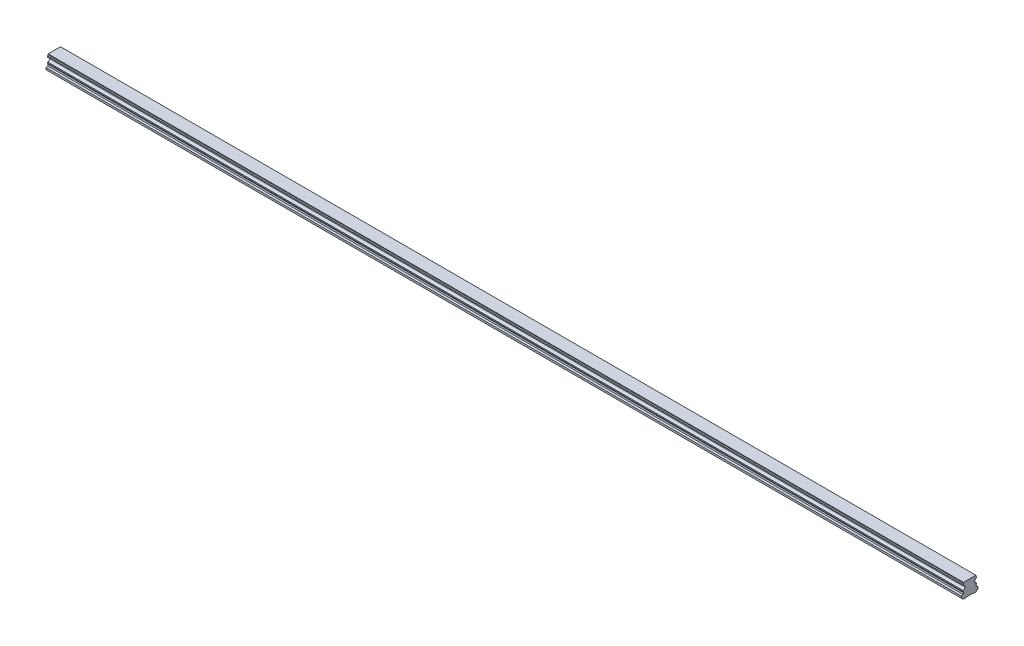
ISO-10303-21;
HEADER;
FILE_DESCRIPTION(('STEP AP214'),'2;1');
FILE_NAME('part.step','',(''),(''),'','','');
FILE_SCHEMA(('AUTOMOTIVE_DESIGN { 1 0 10303 214 1 1 1 1 }'));
ENDSEC;
DATA;
#1=APPLICATION_CONTEXT('core data for automotive mechanical design processes');
#2=APPLICATION_PROTOCOL_DEFINITION('international standard','automotive_design',2000,#1);
#3=PRODUCT_CONTEXT('',#1,'mechanical');
#4=PRODUCT('Part','Part','',(#3));
#5=PRODUCT_RELATED_PRODUCT_CATEGORY('part','',(#4));
#6=PRODUCT_DEFINITION_FORMATION('','',#4);
#7=PRODUCT_DEFINITION_CONTEXT('part definition',#1,'design');
#8=PRODUCT_DEFINITION('design','',#6,#7);
#9=PRODUCT_DEFINITION_SHAPE('','',#8);
#10=(LENGTH_UNIT() NAMED_UNIT(*) SI_UNIT(.MILLI.,.METRE.));
#11=(NAMED_UNIT(*) PLANE_ANGLE_UNIT() SI_UNIT($,.RADIAN.));
#12=(NAMED_UNIT(*) SI_UNIT($,.STERADIAN.) SOLID_ANGLE_UNIT());
#13=UNCERTAINTY_MEASURE_WITH_UNIT(LENGTH_MEASURE(1.E-05),#10,'distance_accuracy_value','');
#14=(GEOMETRIC_REPRESENTATION_CONTEXT(3) GLOBAL_UNCERTAINTY_ASSIGNED_CONTEXT((#13)) GLOBAL_UNIT_ASSIGNED_CONTEXT((#10,
#11,#12)) REPRESENTATION_CONTEXT('',''));
#15=CARTESIAN_POINT('',(0.,0.,0.));
#16=DIRECTION('',(0.,0.,1.));
#17=DIRECTION('',(1.,0.,0.));
#18=AXIS2_PLACEMENT_3D('',#15,#16,#17);
#19=CARTESIAN_POINT('',(1350.,0.499999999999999,0.));
#20=DIRECTION('',(0.,-1.,0.));
#21=DIRECTION('',(0.,0.,-1.));
#22=AXIS2_PLACEMENT_3D('',#19,#20,#21);
#23=CONICAL_SURFACE('',#22,3.5,0.785398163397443);
#24=CARTESIAN_POINT('',(1350.,1.00000000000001,0.));
#25=DIRECTION('',(0.,1.,0.));
#26=DIRECTION('',(0.,0.,1.));
#27=AXIS2_PLACEMENT_3D('',#24,#25,#26);
#28=CIRCLE('',#27,3.);
#29=CARTESIAN_POINT('',(1350.,1.00000000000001,3.));
#30=VERTEX_POINT('',#29);
#31=EDGE_CURVE('E11',#30,#30,#28,.F.);
#32=ORIENTED_EDGE('',*,*,#31,.F.);
#33=EDGE_LOOP('',(#32));
#34=FACE_BOUND('',#33,.T.);
#35=CARTESIAN_POINT('',(1350.,0.499999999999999,0.));
#36=DIRECTION('',(0.,1.,0.));
#37=DIRECTION('',(0.,0.,1.));
#38=AXIS2_PLACEMENT_3D('',#35,#36,#37);
#39=CIRCLE('',#38,3.5);
#40=CARTESIAN_POINT('',(1350.,0.5,3.5));
#41=VERTEX_POINT('',#40);
#42=EDGE_CURVE('E675',#41,#41,#39,.T.);
#43=ORIENTED_EDGE('',*,*,#42,.F.);
#44=EDGE_LOOP('',(#43));
#45=FACE_BOUND('',#44,.T.);
#46=ADVANCED_FACE('F39',(#34,#45),#23,.F.);
#47=CARTESIAN_POINT('',(1350.,12.,0.));
#48=DIRECTION('',(0.,-1.,0.));
#49=DIRECTION('',(0.,0.,-1.));
#50=AXIS2_PLACEMENT_3D('',#47,#48,#49);
#51=CYLINDRICAL_SURFACE('',#50,3.);
#52=ORIENTED_EDGE('',*,*,#31,.T.);
#53=EDGE_LOOP('',(#52));
#54=FACE_BOUND('',#53,.T.);
#55=CARTESIAN_POINT('',(1350.,12.,0.));
#56=DIRECTION('',(0.,-1.,0.));
#57=DIRECTION('',(0.,0.,-1.));
#58=AXIS2_PLACEMENT_3D('',#55,#56,#57);
#59=CIRCLE('',#58,3.);
#60=CARTESIAN_POINT('',(1350.,12.,-3.));
#61=VERTEX_POINT('',#60);
#62=EDGE_CURVE('E49',#61,#61,#59,.T.);
#63=ORIENTED_EDGE('',*,*,#62,.F.);
#64=EDGE_LOOP('',(#63));
#65=FACE_BOUND('',#64,.T.);
#66=ADVANCED_FACE('F969',(#54,#65),#51,.F.);
#67=CARTESIAN_POINT('',(1350.,12.,0.));
#68=DIRECTION('',(0.,-1.,0.));
#69=DIRECTION('',(0.,0.,-1.));
#70=AXIS2_PLACEMENT_3D('',#67,#68,#69);
#71=PLANE('',#70);
#72=CARTESIAN_POINT('',(1350.,12.,0.));
#73=DIRECTION('',(0.,-1.,0.));
#74=DIRECTION('',(0.,0.,-1.));
#75=AXIS2_PLACEMENT_3D('',#72,#73,#74);
#76=CIRCLE('',#75,2.5);
#77=CARTESIAN_POINT('',(1350.,12.,-2.5));
#78=VERTEX_POINT('',#77);
#79=EDGE_CURVE('E42',#78,#78,#76,.T.);
#80=ORIENTED_EDGE('',*,*,#79,.F.);
#81=EDGE_LOOP('',(#80));
#82=FACE_BOUND('',#81,.T.);
#83=ORIENTED_EDGE('',*,*,#62,.T.);
#84=EDGE_LOOP('',(#83));
#85=FACE_BOUND('',#84,.T.);
#86=ADVANCED_FACE('F974',(#82,#85),#71,.T.);
#87=CARTESIAN_POINT('',(1290.,0.499999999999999,0.));
#88=DIRECTION('',(0.,-1.,0.));
#89=DIRECTION('',(0.,0.,-1.));
#90=AXIS2_PLACEMENT_3D('',#87,#88,#89);
#91=CONICAL_SURFACE('',#90,3.5,0.785398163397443);
#92=CARTESIAN_POINT('',(1290.,1.00000000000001,0.));
#93=DIRECTION('',(0.,1.,0.));
#94=DIRECTION('',(0.,0.,1.));
#95=AXIS2_PLACEMENT_3D('',#92,#93,#94);
#96=CIRCLE('',#95,3.);
#97=CARTESIAN_POINT('',(1290.,1.00000000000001,3.));
#98=VERTEX_POINT('',#97);
#99=EDGE_CURVE('E671',#98,#98,#96,.F.);
#100=ORIENTED_EDGE('',*,*,#99,.F.);
#101=EDGE_LOOP('',(#100));
#102=FACE_BOUND('',#101,.T.);
#103=CARTESIAN_POINT('',(1290.,0.499999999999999,0.));
#104=DIRECTION('',(0.,1.,0.));
#105=DIRECTION('',(0.,0.,1.));
#106=AXIS2_PLACEMENT_3D('',#103,#104,#105);
#107=CIRCLE('',#106,3.5);
#108=CARTESIAN_POINT('',(1290.,0.5,3.5));
#109=VERTEX_POINT('',#108);
#110=EDGE_CURVE('E663',#109,#109,#107,.T.);
#111=ORIENTED_EDGE('',*,*,#110,.F.);
#112=EDGE_LOOP('',(#111));
#113=FACE_BOUND('',#112,.T.);
#114=ADVANCED_FACE('F1289',(#102,#113),#91,.F.);
#115=CARTESIAN_POINT('',(1290.,12.,0.));
#116=DIRECTION('',(0.,-1.,0.));
#117=DIRECTION('',(0.,0.,-1.));
#118=AXIS2_PLACEMENT_3D('',#115,#116,#117);
#119=CYLINDRICAL_SURFACE('',#118,3.);
#120=ORIENTED_EDGE('',*,*,#99,.T.);
#121=EDGE_LOOP('',(#120));
#122=FACE_BOUND('',#121,.T.);
#123=CARTESIAN_POINT('',(1290.,12.,0.));
#124=DIRECTION('',(0.,-1.,0.));
#125=DIRECTION('',(0.,0.,-1.));
#126=AXIS2_PLACEMENT_3D('',#123,#124,#125);
#127=CIRCLE('',#126,3.);
#128=CARTESIAN_POINT('',(1290.,12.,-3.));
#129=VERTEX_POINT('',#128);
#130=EDGE_CURVE('E667',#129,#129,#127,.T.);
#131=ORIENTED_EDGE('',*,*,#130,.F.);
#132=EDGE_LOOP('',(#131));
#133=FACE_BOUND('',#132,.T.);
#134=ADVANCED_FACE('F1285',(#122,#133),#119,.F.);
#135=CARTESIAN_POINT('',(1290.,12.,0.));
#136=DIRECTION('',(0.,-1.,0.));
#137=DIRECTION('',(0.,0.,-1.));
#138=AXIS2_PLACEMENT_3D('',#135,#136,#137);
#139=PLANE('',#138);
#140=CARTESIAN_POINT('',(1290.,12.,0.));
#141=DIRECTION('',(0.,-1.,0.));
#142=DIRECTION('',(0.,0.,-1.));
#143=AXIS2_PLACEMENT_3D('',#140,#141,#142);
#144=CIRCLE('',#143,2.5);
#145=CARTESIAN_POINT('',(1290.,12.,-2.5));
#146=VERTEX_POINT('',#145);
#147=EDGE_CURVE('E762',#146,#146,#144,.T.);
#148=ORIENTED_EDGE('',*,*,#147,.F.);
#149=EDGE_LOOP('',(#148));
#150=FACE_BOUND('',#149,.T.);
#151=ORIENTED_EDGE('',*,*,#130,.T.);
#152=EDGE_LOOP('',(#151));
#153=FACE_BOUND('',#152,.T.);
#154=ADVANCED_FACE('F1281',(#150,#153),#139,.T.);
#155=CARTESIAN_POINT('',(1230.,0.499999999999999,0.));
#156=DIRECTION('',(0.,-1.,0.));
#157=DIRECTION('',(0.,0.,-1.));
#158=AXIS2_PLACEMENT_3D('',#155,#156,#157);
#159=CONICAL_SURFACE('',#158,3.5,0.785398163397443);
#160=CARTESIAN_POINT('',(1230.,1.00000000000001,0.));
#161=DIRECTION('',(0.,1.,0.));
#162=DIRECTION('',(0.,0.,1.));
#163=AXIS2_PLACEMENT_3D('',#160,#161,#162);
#164=CIRCLE('',#163,3.);
#165=CARTESIAN_POINT('',(1230.,1.00000000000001,3.));
#166=VERTEX_POINT('',#165);
#167=EDGE_CURVE('E659',#166,#166,#164,.F.);
#168=ORIENTED_EDGE('',*,*,#167,.F.);
#169=EDGE_LOOP('',(#168));
#170=FACE_BOUND('',#169,.T.);
#171=CARTESIAN_POINT('',(1230.,0.499999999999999,0.));
#172=DIRECTION('',(0.,1.,0.));
#173=DIRECTION('',(0.,0.,1.));
#174=AXIS2_PLACEMENT_3D('',#171,#172,#173);
#175=CIRCLE('',#174,3.5);
#176=CARTESIAN_POINT('',(1230.,0.5,3.5));
#177=VERTEX_POINT('',#176);
#178=EDGE_CURVE('E651',#177,#177,#175,.T.);
#179=ORIENTED_EDGE('',*,*,#178,.F.);
#180=EDGE_LOOP('',(#179));
#181=FACE_BOUND('',#180,.T.);
#182=ADVANCED_FACE('F1277',(#170,#181),#159,.F.);
#183=CARTESIAN_POINT('',(1230.,12.,0.));
#184=DIRECTION('',(0.,-1.,0.));
#185=DIRECTION('',(0.,0.,-1.));
#186=AXIS2_PLACEMENT_3D('',#183,#184,#185);
#187=CYLINDRICAL_SURFACE('',#186,3.);
#188=ORIENTED_EDGE('',*,*,#167,.T.);
#189=EDGE_LOOP('',(#188));
#190=FACE_BOUND('',#189,.T.);
#191=CARTESIAN_POINT('',(1230.,12.,0.));
#192=DIRECTION('',(0.,-1.,0.));
#193=DIRECTION('',(0.,0.,-1.));
#194=AXIS2_PLACEMENT_3D('',#191,#192,#193);
#195=CIRCLE('',#194,3.);
#196=CARTESIAN_POINT('',(1230.,12.,-3.));
#197=VERTEX_POINT('',#196);
#198=EDGE_CURVE('E655',#197,#197,#195,.T.);
#199=ORIENTED_EDGE('',*,*,#198,.F.);
#200=EDGE_LOOP('',(#199));
#201=FACE_BOUND('',#200,.T.);
#202=ADVANCED_FACE('F1273',(#190,#201),#187,.F.);
#203=CARTESIAN_POINT('',(1230.,12.,0.));
#204=DIRECTION('',(0.,-1.,0.));
#205=DIRECTION('',(0.,0.,-1.));
#206=AXIS2_PLACEMENT_3D('',#203,#204,#205);
#207=PLANE('',#206);
#208=CARTESIAN_POINT('',(1230.,12.,0.));
#209=DIRECTION('',(0.,-1.,0.));
#210=DIRECTION('',(0.,0.,-1.));
#211=AXIS2_PLACEMENT_3D('',#208,#209,#210);
#212=CIRCLE('',#211,2.5);
#213=CARTESIAN_POINT('',(1230.,12.,-2.5));
#214=VERTEX_POINT('',#213);
#215=EDGE_CURVE('E759',#214,#214,#212,.T.);
#216=ORIENTED_EDGE('',*,*,#215,.F.);
#217=EDGE_LOOP('',(#216));
#218=FACE_BOUND('',#217,.T.);
#219=ORIENTED_EDGE('',*,*,#198,.T.);
#220=EDGE_LOOP('',(#219));
#221=FACE_BOUND('',#220,.T.);
#222=ADVANCED_FACE('F1269',(#218,#221),#207,.T.);
#223=CARTESIAN_POINT('',(1170.,0.499999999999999,0.));
#224=DIRECTION('',(0.,-1.,0.));
#225=DIRECTION('',(0.,0.,-1.));
#226=AXIS2_PLACEMENT_3D('',#223,#224,#225);
#227=CONICAL_SURFACE('',#226,3.5,0.785398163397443);
#228=CARTESIAN_POINT('',(1170.,1.00000000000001,0.));
#229=DIRECTION('',(0.,1.,0.));
#230=DIRECTION('',(0.,0.,1.));
#231=AXIS2_PLACEMENT_3D('',#228,#229,#230);
#232=CIRCLE('',#231,3.);
#233=CARTESIAN_POINT('',(1170.,1.00000000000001,3.));
#234=VERTEX_POINT('',#233);
#235=EDGE_CURVE('E647',#234,#234,#232,.F.);
#236=ORIENTED_EDGE('',*,*,#235,.F.);
#237=EDGE_LOOP('',(#236));
#238=FACE_BOUND('',#237,.T.);
#239=CARTESIAN_POINT('',(1170.,0.499999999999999,0.));
#240=DIRECTION('',(0.,1.,0.));
#241=DIRECTION('',(0.,0.,1.));
#242=AXIS2_PLACEMENT_3D('',#239,#240,#241);
#243=CIRCLE('',#242,3.5);
#244=CARTESIAN_POINT('',(1170.,0.5,3.5));
#245=VERTEX_POINT('',#244);
#246=EDGE_CURVE('E639',#245,#245,#243,.T.);
#247=ORIENTED_EDGE('',*,*,#246,.F.);
#248=EDGE_LOOP('',(#247));
#249=FACE_BOUND('',#248,.T.);
#250=ADVANCED_FACE('F1265',(#238,#249),#227,.F.);
#251=CARTESIAN_POINT('',(1170.,12.,0.));
#252=DIRECTION('',(0.,-1.,0.));
#253=DIRECTION('',(0.,0.,-1.));
#254=AXIS2_PLACEMENT_3D('',#251,#252,#253);
#255=CYLINDRICAL_SURFACE('',#254,3.);
#256=ORIENTED_EDGE('',*,*,#235,.T.);
#257=EDGE_LOOP('',(#256));
#258=FACE_BOUND('',#257,.T.);
#259=CARTESIAN_POINT('',(1170.,12.,0.));
#260=DIRECTION('',(0.,-1.,0.));
#261=DIRECTION('',(0.,0.,-1.));
#262=AXIS2_PLACEMENT_3D('',#259,#260,#261);
#263=CIRCLE('',#262,3.);
#264=CARTESIAN_POINT('',(1170.,12.,-3.));
#265=VERTEX_POINT('',#264);
#266=EDGE_CURVE('E643',#265,#265,#263,.T.);
#267=ORIENTED_EDGE('',*,*,#266,.F.);
#268=EDGE_LOOP('',(#267));
#269=FACE_BOUND('',#268,.T.);
#270=ADVANCED_FACE('F1261',(#258,#269),#255,.F.);
#271=CARTESIAN_POINT('',(1170.,12.,0.));
#272=DIRECTION('',(0.,-1.,0.));
#273=DIRECTION('',(0.,0.,-1.));
#274=AXIS2_PLACEMENT_3D('',#271,#272,#273);
#275=PLANE('',#274);
#276=CARTESIAN_POINT('',(1170.,12.,0.));
#277=DIRECTION('',(0.,-1.,0.));
#278=DIRECTION('',(0.,0.,-1.));
#279=AXIS2_PLACEMENT_3D('',#276,#277,#278);
#280=CIRCLE('',#279,2.5);
#281=CARTESIAN_POINT('',(1170.,12.,-2.5));
#282=VERTEX_POINT('',#281);
#283=EDGE_CURVE('E755',#282,#282,#280,.T.);
#284=ORIENTED_EDGE('',*,*,#283,.F.);
#285=EDGE_LOOP('',(#284));
#286=FACE_BOUND('',#285,.T.);
#287=ORIENTED_EDGE('',*,*,#266,.T.);
#288=EDGE_LOOP('',(#287));
#289=FACE_BOUND('',#288,.T.);
#290=ADVANCED_FACE('F1257',(#286,#289),#275,.T.);
#291=CARTESIAN_POINT('',(1110.,0.499999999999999,0.));
#292=DIRECTION('',(0.,-1.,0.));
#293=DIRECTION('',(0.,0.,-1.));
#294=AXIS2_PLACEMENT_3D('',#291,#292,#293);
#295=CONICAL_SURFACE('',#294,3.5,0.785398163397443);
#296=CARTESIAN_POINT('',(1110.,1.00000000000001,0.));
#297=DIRECTION('',(0.,1.,0.));
#298=DIRECTION('',(0.,0.,1.));
#299=AXIS2_PLACEMENT_3D('',#296,#297,#298);
#300=CIRCLE('',#299,3.);
#301=CARTESIAN_POINT('',(1110.,1.00000000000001,3.));
#302=VERTEX_POINT('',#301);
#303=EDGE_CURVE('E635',#302,#302,#300,.F.);
#304=ORIENTED_EDGE('',*,*,#303,.F.);
#305=EDGE_LOOP('',(#304));
#306=FACE_BOUND('',#305,.T.);
#307=CARTESIAN_POINT('',(1110.,0.499999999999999,0.));
#308=DIRECTION('',(0.,1.,0.));
#309=DIRECTION('',(0.,0.,1.));
#310=AXIS2_PLACEMENT_3D('',#307,#308,#309);
#311=CIRCLE('',#310,3.5);
#312=CARTESIAN_POINT('',(1110.,0.5,3.5));
#313=VERTEX_POINT('',#312);
#314=EDGE_CURVE('E627',#313,#313,#311,.T.);
#315=ORIENTED_EDGE('',*,*,#314,.F.);
#316=EDGE_LOOP('',(#315));
#317=FACE_BOUND('',#316,.T.);
#318=ADVANCED_FACE('F1253',(#306,#317),#295,.F.);
#319=CARTESIAN_POINT('',(1110.,12.,0.));
#320=DIRECTION('',(0.,-1.,0.));
#321=DIRECTION('',(0.,0.,-1.));
#322=AXIS2_PLACEMENT_3D('',#319,#320,#321);
#323=CYLINDRICAL_SURFACE('',#322,3.);
#324=ORIENTED_EDGE('',*,*,#303,.T.);
#325=EDGE_LOOP('',(#324));
#326=FACE_BOUND('',#325,.T.);
#327=CARTESIAN_POINT('',(1110.,12.,0.));
#328=DIRECTION('',(0.,-1.,0.));
#329=DIRECTION('',(0.,0.,-1.));
#330=AXIS2_PLACEMENT_3D('',#327,#328,#329);
#331=CIRCLE('',#330,3.);
#332=CARTESIAN_POINT('',(1110.,12.,-3.));
#333=VERTEX_POINT('',#332);
#334=EDGE_CURVE('E631',#333,#333,#331,.T.);
#335=ORIENTED_EDGE('',*,*,#334,.F.);
#336=EDGE_LOOP('',(#335));
#337=FACE_BOUND('',#336,.T.);
#338=ADVANCED_FACE('F1249',(#326,#337),#323,.F.);
#339=CARTESIAN_POINT('',(1110.,12.,0.));
#340=DIRECTION('',(0.,-1.,0.));
#341=DIRECTION('',(0.,0.,-1.));
#342=AXIS2_PLACEMENT_3D('',#339,#340,#341);
#343=PLANE('',#342);
#344=CARTESIAN_POINT('',(1110.,12.,0.));
#345=DIRECTION('',(0.,-1.,0.));
#346=DIRECTION('',(0.,0.,-1.));
#347=AXIS2_PLACEMENT_3D('',#344,#345,#346);
#348=CIRCLE('',#347,2.5);
#349=CARTESIAN_POINT('',(1110.,12.,-2.5));
#350=VERTEX_POINT('',#349);
#351=EDGE_CURVE('E751',#350,#350,#348,.T.);
#352=ORIENTED_EDGE('',*,*,#351,.F.);
#353=EDGE_LOOP('',(#352));
#354=FACE_BOUND('',#353,.T.);
#355=ORIENTED_EDGE('',*,*,#334,.T.);
#356=EDGE_LOOP('',(#355));
#357=FACE_BOUND('',#356,.T.);
#358=ADVANCED_FACE('F1245',(#354,#357),#343,.T.);
#359=CARTESIAN_POINT('',(1050.,0.499999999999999,0.));
#360=DIRECTION('',(0.,-1.,0.));
#361=DIRECTION('',(0.,0.,-1.));
#362=AXIS2_PLACEMENT_3D('',#359,#360,#361);
#363=CONICAL_SURFACE('',#362,3.5,0.785398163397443);
#364=CARTESIAN_POINT('',(1050.,1.00000000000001,0.));
#365=DIRECTION('',(0.,1.,0.));
#366=DIRECTION('',(0.,0.,1.));
#367=AXIS2_PLACEMENT_3D('',#364,#365,#366);
#368=CIRCLE('',#367,3.);
#369=CARTESIAN_POINT('',(1050.,1.00000000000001,3.));
#370=VERTEX_POINT('',#369);
#371=EDGE_CURVE('E623',#370,#370,#368,.F.);
#372=ORIENTED_EDGE('',*,*,#371,.F.);
#373=EDGE_LOOP('',(#372));
#374=FACE_BOUND('',#373,.T.);
#375=CARTESIAN_POINT('',(1050.,0.499999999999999,0.));
#376=DIRECTION('',(0.,1.,0.));
#377=DIRECTION('',(0.,0.,1.));
#378=AXIS2_PLACEMENT_3D('',#375,#376,#377);
#379=CIRCLE('',#378,3.5);
#380=CARTESIAN_POINT('',(1050.,0.5,3.5));
#381=VERTEX_POINT('',#380);
#382=EDGE_CURVE('E615',#381,#381,#379,.T.);
#383=ORIENTED_EDGE('',*,*,#382,.F.);
#384=EDGE_LOOP('',(#383));
#385=FACE_BOUND('',#384,.T.);
#386=ADVANCED_FACE('F1241',(#374,#385),#363,.F.);
#387=CARTESIAN_POINT('',(1050.,12.,0.));
#388=DIRECTION('',(0.,-1.,0.));
#389=DIRECTION('',(0.,0.,-1.));
#390=AXIS2_PLACEMENT_3D('',#387,#388,#389);
#391=CYLINDRICAL_SURFACE('',#390,3.);
#392=ORIENTED_EDGE('',*,*,#371,.T.);
#393=EDGE_LOOP('',(#392));
#394=FACE_BOUND('',#393,.T.);
#395=CARTESIAN_POINT('',(1050.,12.,0.));
#396=DIRECTION('',(0.,-1.,0.));
#397=DIRECTION('',(0.,0.,-1.));
#398=AXIS2_PLACEMENT_3D('',#395,#396,#397);
#399=CIRCLE('',#398,3.);
#400=CARTESIAN_POINT('',(1050.,12.,-3.));
#401=VERTEX_POINT('',#400);
#402=EDGE_CURVE('E619',#401,#401,#399,.T.);
#403=ORIENTED_EDGE('',*,*,#402,.F.);
#404=EDGE_LOOP('',(#403));
#405=FACE_BOUND('',#404,.T.);
#406=ADVANCED_FACE('F1237',(#394,#405),#391,.F.);
#407=CARTESIAN_POINT('',(1050.,12.,0.));
#408=DIRECTION('',(0.,-1.,0.));
#409=DIRECTION('',(0.,0.,-1.));
#410=AXIS2_PLACEMENT_3D('',#407,#408,#409);
#411=PLANE('',#410);
#412=CARTESIAN_POINT('',(1050.,12.,0.));
#413=DIRECTION('',(0.,-1.,0.));
#414=DIRECTION('',(0.,0.,-1.));
#415=AXIS2_PLACEMENT_3D('',#412,#413,#414);
#416=CIRCLE('',#415,2.5);
#417=CARTESIAN_POINT('',(1050.,12.,-2.5));
#418=VERTEX_POINT('',#417);
#419=EDGE_CURVE('E747',#418,#418,#416,.T.);
#420=ORIENTED_EDGE('',*,*,#419,.F.);
#421=EDGE_LOOP('',(#420));
#422=FACE_BOUND('',#421,.T.);
#423=ORIENTED_EDGE('',*,*,#402,.T.);
#424=EDGE_LOOP('',(#423));
#425=FACE_BOUND('',#424,.T.);
#426=ADVANCED_FACE('F1233',(#422,#425),#411,.T.);
#427=CARTESIAN_POINT('',(990.,0.499999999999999,0.));
#428=DIRECTION('',(0.,-1.,0.));
#429=DIRECTION('',(0.,0.,-1.));
#430=AXIS2_PLACEMENT_3D('',#427,#428,#429);
#431=CONICAL_SURFACE('',#430,3.5,0.785398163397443);
#432=CARTESIAN_POINT('',(990.,1.00000000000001,0.));
#433=DIRECTION('',(0.,1.,0.));
#434=DIRECTION('',(0.,0.,1.));
#435=AXIS2_PLACEMENT_3D('',#432,#433,#434);
#436=CIRCLE('',#435,3.);
#437=CARTESIAN_POINT('',(990.,1.00000000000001,3.));
#438=VERTEX_POINT('',#437);
#439=EDGE_CURVE('E611',#438,#438,#436,.F.);
#440=ORIENTED_EDGE('',*,*,#439,.F.);
#441=EDGE_LOOP('',(#440));
#442=FACE_BOUND('',#441,.T.);
#443=CARTESIAN_POINT('',(990.,0.499999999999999,0.));
#444=DIRECTION('',(0.,1.,0.));
#445=DIRECTION('',(0.,0.,1.));
#446=AXIS2_PLACEMENT_3D('',#443,#444,#445);
#447=CIRCLE('',#446,3.5);
#448=CARTESIAN_POINT('',(990.,0.5,3.5));
#449=VERTEX_POINT('',#448);
#450=EDGE_CURVE('E603',#449,#449,#447,.T.);
#451=ORIENTED_EDGE('',*,*,#450,.F.);
#452=EDGE_LOOP('',(#451));
#453=FACE_BOUND('',#452,.T.);
#454=ADVANCED_FACE('F1229',(#442,#453),#431,.F.);
#455=CARTESIAN_POINT('',(990.,12.,0.));
#456=DIRECTION('',(0.,-1.,0.));
#457=DIRECTION('',(0.,0.,-1.));
#458=AXIS2_PLACEMENT_3D('',#455,#456,#457);
#459=CYLINDRICAL_SURFACE('',#458,3.);
#460=ORIENTED_EDGE('',*,*,#439,.T.);
#461=EDGE_LOOP('',(#460));
#462=FACE_BOUND('',#461,.T.);
#463=CARTESIAN_POINT('',(990.,12.,0.));
#464=DIRECTION('',(0.,-1.,0.));
#465=DIRECTION('',(0.,0.,-1.));
#466=AXIS2_PLACEMENT_3D('',#463,#464,#465);
#467=CIRCLE('',#466,3.);
#468=CARTESIAN_POINT('',(990.,12.,-3.));
#469=VERTEX_POINT('',#468);
#470=EDGE_CURVE('E607',#469,#469,#467,.T.);
#471=ORIENTED_EDGE('',*,*,#470,.F.);
#472=EDGE_LOOP('',(#471));
#473=FACE_BOUND('',#472,.T.);
#474=ADVANCED_FACE('F1225',(#462,#473),#459,.F.);
#475=CARTESIAN_POINT('',(990.,12.,0.));
#476=DIRECTION('',(0.,-1.,0.));
#477=DIRECTION('',(0.,0.,-1.));
#478=AXIS2_PLACEMENT_3D('',#475,#476,#477);
#479=PLANE('',#478);
#480=CARTESIAN_POINT('',(990.,12.,0.));
#481=DIRECTION('',(0.,-1.,0.));
#482=DIRECTION('',(0.,0.,-1.));
#483=AXIS2_PLACEMENT_3D('',#480,#481,#482);
#484=CIRCLE('',#483,2.5);
#485=CARTESIAN_POINT('',(990.,12.,-2.5));
#486=VERTEX_POINT('',#485);
#487=EDGE_CURVE('E743',#486,#486,#484,.T.);
#488=ORIENTED_EDGE('',*,*,#487,.F.);
#489=EDGE_LOOP('',(#488));
#490=FACE_BOUND('',#489,.T.);
#491=ORIENTED_EDGE('',*,*,#470,.T.);
#492=EDGE_LOOP('',(#491));
#493=FACE_BOUND('',#492,.T.);
#494=ADVANCED_FACE('F1221',(#490,#493),#479,.T.);
#495=CARTESIAN_POINT('',(930.,0.499999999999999,0.));
#496=DIRECTION('',(0.,-1.,0.));
#497=DIRECTION('',(0.,0.,-1.));
#498=AXIS2_PLACEMENT_3D('',#495,#496,#497);
#499=CONICAL_SURFACE('',#498,3.5,0.785398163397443);
#500=CARTESIAN_POINT('',(930.,1.00000000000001,0.));
#501=DIRECTION('',(0.,1.,0.));
#502=DIRECTION('',(0.,0.,1.));
#503=AXIS2_PLACEMENT_3D('',#500,#501,#502);
#504=CIRCLE('',#503,3.);
#505=CARTESIAN_POINT('',(930.,1.00000000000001,3.));
#506=VERTEX_POINT('',#505);
#507=EDGE_CURVE('E599',#506,#506,#504,.F.);
#508=ORIENTED_EDGE('',*,*,#507,.F.);
#509=EDGE_LOOP('',(#508));
#510=FACE_BOUND('',#509,.T.);
#511=CARTESIAN_POINT('',(930.,0.499999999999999,0.));
#512=DIRECTION('',(0.,1.,0.));
#513=DIRECTION('',(0.,0.,1.));
#514=AXIS2_PLACEMENT_3D('',#511,#512,#513);
#515=CIRCLE('',#514,3.5);
#516=CARTESIAN_POINT('',(930.,0.5,3.5));
#517=VERTEX_POINT('',#516);
#518=EDGE_CURVE('E591',#517,#517,#515,.T.);
#519=ORIENTED_EDGE('',*,*,#518,.F.);
#520=EDGE_LOOP('',(#519));
#521=FACE_BOUND('',#520,.T.);
#522=ADVANCED_FACE('F1217',(#510,#521),#499,.F.);
#523=CARTESIAN_POINT('',(930.,12.,0.));
#524=DIRECTION('',(0.,-1.,0.));
#525=DIRECTION('',(0.,0.,-1.));
#526=AXIS2_PLACEMENT_3D('',#523,#524,#525);
#527=CYLINDRICAL_SURFACE('',#526,3.);
#528=ORIENTED_EDGE('',*,*,#507,.T.);
#529=EDGE_LOOP('',(#528));
#530=FACE_BOUND('',#529,.T.);
#531=CARTESIAN_POINT('',(930.,12.,0.));
#532=DIRECTION('',(0.,-1.,0.));
#533=DIRECTION('',(0.,0.,-1.));
#534=AXIS2_PLACEMENT_3D('',#531,#532,#533);
#535=CIRCLE('',#534,3.);
#536=CARTESIAN_POINT('',(930.,12.,-3.));
#537=VERTEX_POINT('',#536);
#538=EDGE_CURVE('E595',#537,#537,#535,.T.);
#539=ORIENTED_EDGE('',*,*,#538,.F.);
#540=EDGE_LOOP('',(#539));
#541=FACE_BOUND('',#540,.T.);
#542=ADVANCED_FACE('F1213',(#530,#541),#527,.F.);
#543=CARTESIAN_POINT('',(930.,12.,0.));
#544=DIRECTION('',(0.,-1.,0.));
#545=DIRECTION('',(0.,0.,-1.));
#546=AXIS2_PLACEMENT_3D('',#543,#544,#545);
#547=PLANE('',#546);
#548=CARTESIAN_POINT('',(930.,12.,0.));
#549=DIRECTION('',(0.,-1.,0.));
#550=DIRECTION('',(0.,0.,-1.));
#551=AXIS2_PLACEMENT_3D('',#548,#549,#550);
#552=CIRCLE('',#551,2.5);
#553=CARTESIAN_POINT('',(930.,12.,-2.5));
#554=VERTEX_POINT('',#553);
#555=EDGE_CURVE('E739',#554,#554,#552,.T.);
#556=ORIENTED_EDGE('',*,*,#555,.F.);
#557=EDGE_LOOP('',(#556));
#558=FACE_BOUND('',#557,.T.);
#559=ORIENTED_EDGE('',*,*,#538,.T.);
#560=EDGE_LOOP('',(#559));
#561=FACE_BOUND('',#560,.T.);
#562=ADVANCED_FACE('F1209',(#558,#561),#547,.T.);
#563=CARTESIAN_POINT('',(870.,0.499999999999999,0.));
#564=DIRECTION('',(0.,-1.,0.));
#565=DIRECTION('',(0.,0.,-1.));
#566=AXIS2_PLACEMENT_3D('',#563,#564,#565);
#567=CONICAL_SURFACE('',#566,3.5,0.785398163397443);
#568=CARTESIAN_POINT('',(870.,1.00000000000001,0.));
#569=DIRECTION('',(0.,1.,0.));
#570=DIRECTION('',(0.,0.,1.));
#571=AXIS2_PLACEMENT_3D('',#568,#569,#570);
#572=CIRCLE('',#571,3.);
#573=CARTESIAN_POINT('',(870.,1.00000000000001,3.));
#574=VERTEX_POINT('',#573);
#575=EDGE_CURVE('E587',#574,#574,#572,.F.);
#576=ORIENTED_EDGE('',*,*,#575,.F.);
#577=EDGE_LOOP('',(#576));
#578=FACE_BOUND('',#577,.T.);
#579=CARTESIAN_POINT('',(870.,0.499999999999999,0.));
#580=DIRECTION('',(0.,1.,0.));
#581=DIRECTION('',(0.,0.,1.));
#582=AXIS2_PLACEMENT_3D('',#579,#580,#581);
#583=CIRCLE('',#582,3.5);
#584=CARTESIAN_POINT('',(870.,0.5,3.5));
#585=VERTEX_POINT('',#584);
#586=EDGE_CURVE('E579',#585,#585,#583,.T.);
#587=ORIENTED_EDGE('',*,*,#586,.F.);
#588=EDGE_LOOP('',(#587));
#589=FACE_BOUND('',#588,.T.);
#590=ADVANCED_FACE('F1205',(#578,#589),#567,.F.);
#591=CARTESIAN_POINT('',(870.,12.,0.));
#592=DIRECTION('',(0.,-1.,0.));
#593=DIRECTION('',(0.,0.,-1.));
#594=AXIS2_PLACEMENT_3D('',#591,#592,#593);
#595=CYLINDRICAL_SURFACE('',#594,3.);
#596=ORIENTED_EDGE('',*,*,#575,.T.);
#597=EDGE_LOOP('',(#596));
#598=FACE_BOUND('',#597,.T.);
#599=CARTESIAN_POINT('',(870.,12.,0.));
#600=DIRECTION('',(0.,-1.,0.));
#601=DIRECTION('',(0.,0.,-1.));
#602=AXIS2_PLACEMENT_3D('',#599,#600,#601);
#603=CIRCLE('',#602,3.);
#604=CARTESIAN_POINT('',(870.,12.,-3.));
#605=VERTEX_POINT('',#604);
#606=EDGE_CURVE('E583',#605,#605,#603,.T.);
#607=ORIENTED_EDGE('',*,*,#606,.F.);
#608=EDGE_LOOP('',(#607));
#609=FACE_BOUND('',#608,.T.);
#610=ADVANCED_FACE('F1201',(#598,#609),#595,.F.);
#611=CARTESIAN_POINT('',(870.,12.,0.));
#612=DIRECTION('',(0.,-1.,0.));
#613=DIRECTION('',(0.,0.,-1.));
#614=AXIS2_PLACEMENT_3D('',#611,#612,#613);
#615=PLANE('',#614);
#616=CARTESIAN_POINT('',(870.,12.,0.));
#617=DIRECTION('',(0.,-1.,0.));
#618=DIRECTION('',(0.,0.,-1.));
#619=AXIS2_PLACEMENT_3D('',#616,#617,#618);
#620=CIRCLE('',#619,2.5);
#621=CARTESIAN_POINT('',(870.,12.,-2.5));
#622=VERTEX_POINT('',#621);
#623=EDGE_CURVE('E735',#622,#622,#620,.T.);
#624=ORIENTED_EDGE('',*,*,#623,.F.);
#625=EDGE_LOOP('',(#624));
#626=FACE_BOUND('',#625,.T.);
#627=ORIENTED_EDGE('',*,*,#606,.T.);
#628=EDGE_LOOP('',(#627));
#629=FACE_BOUND('',#628,.T.);
#630=ADVANCED_FACE('F1197',(#626,#629),#615,.T.);
#631=CARTESIAN_POINT('',(810.,0.499999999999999,0.));
#632=DIRECTION('',(0.,-1.,0.));
#633=DIRECTION('',(0.,0.,-1.));
#634=AXIS2_PLACEMENT_3D('',#631,#632,#633);
#635=CONICAL_SURFACE('',#634,3.5,0.785398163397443);
#636=CARTESIAN_POINT('',(810.,1.00000000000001,0.));
#637=DIRECTION('',(0.,1.,0.));
#638=DIRECTION('',(0.,0.,1.));
#639=AXIS2_PLACEMENT_3D('',#636,#637,#638);
#640=CIRCLE('',#639,3.);
#641=CARTESIAN_POINT('',(810.,1.00000000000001,3.));
#642=VERTEX_POINT('',#641);
#643=EDGE_CURVE('E575',#642,#642,#640,.F.);
#644=ORIENTED_EDGE('',*,*,#643,.F.);
#645=EDGE_LOOP('',(#644));
#646=FACE_BOUND('',#645,.T.);
#647=CARTESIAN_POINT('',(810.,0.499999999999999,0.));
#648=DIRECTION('',(0.,1.,0.));
#649=DIRECTION('',(0.,0.,1.));
#650=AXIS2_PLACEMENT_3D('',#647,#648,#649);
#651=CIRCLE('',#650,3.5);
#652=CARTESIAN_POINT('',(810.,0.5,3.5));
#653=VERTEX_POINT('',#652);
#654=EDGE_CURVE('E567',#653,#653,#651,.T.);
#655=ORIENTED_EDGE('',*,*,#654,.F.);
#656=EDGE_LOOP('',(#655));
#657=FACE_BOUND('',#656,.T.);
#658=ADVANCED_FACE('F1193',(#646,#657),#635,.F.);
#659=CARTESIAN_POINT('',(810.,12.,0.));
#660=DIRECTION('',(0.,-1.,0.));
#661=DIRECTION('',(0.,0.,-1.));
#662=AXIS2_PLACEMENT_3D('',#659,#660,#661);
#663=CYLINDRICAL_SURFACE('',#662,3.);
#664=ORIENTED_EDGE('',*,*,#643,.T.);
#665=EDGE_LOOP('',(#664));
#666=FACE_BOUND('',#665,.T.);
#667=CARTESIAN_POINT('',(810.,12.,0.));
#668=DIRECTION('',(0.,-1.,0.));
#669=DIRECTION('',(0.,0.,-1.));
#670=AXIS2_PLACEMENT_3D('',#667,#668,#669);
#671=CIRCLE('',#670,3.);
#672=CARTESIAN_POINT('',(810.,12.,-3.));
#673=VERTEX_POINT('',#672);
#674=EDGE_CURVE('E571',#673,#673,#671,.T.);
#675=ORIENTED_EDGE('',*,*,#674,.F.);
#676=EDGE_LOOP('',(#675));
#677=FACE_BOUND('',#676,.T.);
#678=ADVANCED_FACE('F1189',(#666,#677),#663,.F.);
#679=CARTESIAN_POINT('',(810.,12.,0.));
#680=DIRECTION('',(0.,-1.,0.));
#681=DIRECTION('',(0.,0.,-1.));
#682=AXIS2_PLACEMENT_3D('',#679,#680,#681);
#683=PLANE('',#682);
#684=CARTESIAN_POINT('',(810.,12.,0.));
#685=DIRECTION('',(0.,-1.,0.));
#686=DIRECTION('',(0.,0.,-1.));
#687=AXIS2_PLACEMENT_3D('',#684,#685,#686);
#688=CIRCLE('',#687,2.5);
#689=CARTESIAN_POINT('',(810.,12.,-2.5));
#690=VERTEX_POINT('',#689);
#691=EDGE_CURVE('E731',#690,#690,#688,.T.);
#692=ORIENTED_EDGE('',*,*,#691,.F.);
#693=EDGE_LOOP('',(#692));
#694=FACE_BOUND('',#693,.T.);
#695=ORIENTED_EDGE('',*,*,#674,.T.);
#696=EDGE_LOOP('',(#695));
#697=FACE_BOUND('',#696,.T.);
#698=ADVANCED_FACE('F1185',(#694,#697),#683,.T.);
#699=CARTESIAN_POINT('',(750.,0.499999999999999,0.));
#700=DIRECTION('',(0.,-1.,0.));
#701=DIRECTION('',(0.,0.,-1.));
#702=AXIS2_PLACEMENT_3D('',#699,#700,#701);
#703=CONICAL_SURFACE('',#702,3.5,0.785398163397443);
#704=CARTESIAN_POINT('',(750.,1.00000000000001,0.));
#705=DIRECTION('',(0.,1.,0.));
#706=DIRECTION('',(0.,0.,1.));
#707=AXIS2_PLACEMENT_3D('',#704,#705,#706);
#708=CIRCLE('',#707,3.);
#709=CARTESIAN_POINT('',(750.,1.00000000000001,3.));
#710=VERTEX_POINT('',#709);
#711=EDGE_CURVE('E563',#710,#710,#708,.F.);
#712=ORIENTED_EDGE('',*,*,#711,.F.);
#713=EDGE_LOOP('',(#712));
#714=FACE_BOUND('',#713,.T.);
#715=CARTESIAN_POINT('',(750.,0.499999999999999,0.));
#716=DIRECTION('',(0.,1.,0.));
#717=DIRECTION('',(0.,0.,1.));
#718=AXIS2_PLACEMENT_3D('',#715,#716,#717);
#719=CIRCLE('',#718,3.5);
#720=CARTESIAN_POINT('',(750.,0.5,3.5));
#721=VERTEX_POINT('',#720);
#722=EDGE_CURVE('E555',#721,#721,#719,.T.);
#723=ORIENTED_EDGE('',*,*,#722,.F.);
#724=EDGE_LOOP('',(#723));
#725=FACE_BOUND('',#724,.T.);
#726=ADVANCED_FACE('F1181',(#714,#725),#703,.F.);
#727=CARTESIAN_POINT('',(750.,12.,0.));
#728=DIRECTION('',(0.,-1.,0.));
#729=DIRECTION('',(0.,0.,-1.));
#730=AXIS2_PLACEMENT_3D('',#727,#728,#729);
#731=CYLINDRICAL_SURFACE('',#730,3.);
#732=ORIENTED_EDGE('',*,*,#711,.T.);
#733=EDGE_LOOP('',(#732));
#734=FACE_BOUND('',#733,.T.);
#735=CARTESIAN_POINT('',(750.,12.,0.));
#736=DIRECTION('',(0.,-1.,0.));
#737=DIRECTION('',(0.,0.,-1.));
#738=AXIS2_PLACEMENT_3D('',#735,#736,#737);
#739=CIRCLE('',#738,3.);
#740=CARTESIAN_POINT('',(750.,12.,-3.));
#741=VERTEX_POINT('',#740);
#742=EDGE_CURVE('E559',#741,#741,#739,.T.);
#743=ORIENTED_EDGE('',*,*,#742,.F.);
#744=EDGE_LOOP('',(#743));
#745=FACE_BOUND('',#744,.T.);
#746=ADVANCED_FACE('F1177',(#734,#745),#731,.F.);
#747=CARTESIAN_POINT('',(750.,12.,0.));
#748=DIRECTION('',(0.,-1.,0.));
#749=DIRECTION('',(0.,0.,-1.));
#750=AXIS2_PLACEMENT_3D('',#747,#748,#749);
#751=PLANE('',#750);
#752=CARTESIAN_POINT('',(750.,12.,0.));
#753=DIRECTION('',(0.,-1.,0.));
#754=DIRECTION('',(0.,0.,-1.));
#755=AXIS2_PLACEMENT_3D('',#752,#753,#754);
#756=CIRCLE('',#755,2.5);
#757=CARTESIAN_POINT('',(750.,12.,-2.5));
#758=VERTEX_POINT('',#757);
#759=EDGE_CURVE('E727',#758,#758,#756,.T.);
#760=ORIENTED_EDGE('',*,*,#759,.F.);
#761=EDGE_LOOP('',(#760));
#762=FACE_BOUND('',#761,.T.);
#763=ORIENTED_EDGE('',*,*,#742,.T.);
#764=EDGE_LOOP('',(#763));
#765=FACE_BOUND('',#764,.T.);
#766=ADVANCED_FACE('F1173',(#762,#765),#751,.T.);
#767=CARTESIAN_POINT('',(690.,0.499999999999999,0.));
#768=DIRECTION('',(0.,-1.,0.));
#769=DIRECTION('',(0.,0.,-1.));
#770=AXIS2_PLACEMENT_3D('',#767,#768,#769);
#771=CONICAL_SURFACE('',#770,3.5,0.785398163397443);
#772=CARTESIAN_POINT('',(690.,1.00000000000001,0.));
#773=DIRECTION('',(0.,1.,0.));
#774=DIRECTION('',(0.,0.,1.));
#775=AXIS2_PLACEMENT_3D('',#772,#773,#774);
#776=CIRCLE('',#775,3.);
#777=CARTESIAN_POINT('',(690.,1.00000000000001,3.));
#778=VERTEX_POINT('',#777);
#779=EDGE_CURVE('E551',#778,#778,#776,.F.);
#780=ORIENTED_EDGE('',*,*,#779,.F.);
#781=EDGE_LOOP('',(#780));
#782=FACE_BOUND('',#781,.T.);
#783=CARTESIAN_POINT('',(690.,0.499999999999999,0.));
#784=DIRECTION('',(0.,1.,0.));
#785=DIRECTION('',(0.,0.,1.));
#786=AXIS2_PLACEMENT_3D('',#783,#784,#785);
#787=CIRCLE('',#786,3.5);
#788=CARTESIAN_POINT('',(690.,0.5,3.5));
#789=VERTEX_POINT('',#788);
#790=EDGE_CURVE('E543',#789,#789,#787,.T.);
#791=ORIENTED_EDGE('',*,*,#790,.F.);
#792=EDGE_LOOP('',(#791));
#793=FACE_BOUND('',#792,.T.);
#794=ADVANCED_FACE('F1169',(#782,#793),#771,.F.);
#795=CARTESIAN_POINT('',(690.,12.,0.));
#796=DIRECTION('',(0.,-1.,0.));
#797=DIRECTION('',(0.,0.,-1.));
#798=AXIS2_PLACEMENT_3D('',#795,#796,#797);
#799=CYLINDRICAL_SURFACE('',#798,3.);
#800=ORIENTED_EDGE('',*,*,#779,.T.);
#801=EDGE_LOOP('',(#800));
#802=FACE_BOUND('',#801,.T.);
#803=CARTESIAN_POINT('',(690.,12.,0.));
#804=DIRECTION('',(0.,-1.,0.));
#805=DIRECTION('',(0.,0.,-1.));
#806=AXIS2_PLACEMENT_3D('',#803,#804,#805);
#807=CIRCLE('',#806,3.);
#808=CARTESIAN_POINT('',(690.,12.,-3.));
#809=VERTEX_POINT('',#808);
#810=EDGE_CURVE('E547',#809,#809,#807,.T.);
#811=ORIENTED_EDGE('',*,*,#810,.F.);
#812=EDGE_LOOP('',(#811));
#813=FACE_BOUND('',#812,.T.);
#814=ADVANCED_FACE('F1165',(#802,#813),#799,.F.);
#815=CARTESIAN_POINT('',(690.,12.,0.));
#816=DIRECTION('',(0.,-1.,0.));
#817=DIRECTION('',(0.,0.,-1.));
#818=AXIS2_PLACEMENT_3D('',#815,#816,#817);
#819=PLANE('',#818);
#820=CARTESIAN_POINT('',(690.,12.,0.));
#821=DIRECTION('',(0.,-1.,0.));
#822=DIRECTION('',(0.,0.,-1.));
#823=AXIS2_PLACEMENT_3D('',#820,#821,#822);
#824=CIRCLE('',#823,2.5);
#825=CARTESIAN_POINT('',(690.,12.,-2.5));
#826=VERTEX_POINT('',#825);
#827=EDGE_CURVE('E723',#826,#826,#824,.T.);
#828=ORIENTED_EDGE('',*,*,#827,.F.);
#829=EDGE_LOOP('',(#828));
#830=FACE_BOUND('',#829,.T.);
#831=ORIENTED_EDGE('',*,*,#810,.T.);
#832=EDGE_LOOP('',(#831));
#833=FACE_BOUND('',#832,.T.);
#834=ADVANCED_FACE('F1161',(#830,#833),#819,.T.);
#835=CARTESIAN_POINT('',(630.,0.499999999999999,0.));
#836=DIRECTION('',(0.,-1.,0.));
#837=DIRECTION('',(0.,0.,-1.));
#838=AXIS2_PLACEMENT_3D('',#835,#836,#837);
#839=CONICAL_SURFACE('',#838,3.5,0.785398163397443);
#840=CARTESIAN_POINT('',(630.,1.00000000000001,0.));
#841=DIRECTION('',(0.,1.,0.));
#842=DIRECTION('',(0.,0.,1.));
#843=AXIS2_PLACEMENT_3D('',#840,#841,#842);
#844=CIRCLE('',#843,3.);
#845=CARTESIAN_POINT('',(630.,1.00000000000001,3.));
#846=VERTEX_POINT('',#845);
#847=EDGE_CURVE('E539',#846,#846,#844,.F.);
#848=ORIENTED_EDGE('',*,*,#847,.F.);
#849=EDGE_LOOP('',(#848));
#850=FACE_BOUND('',#849,.T.);
#851=CARTESIAN_POINT('',(630.,0.499999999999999,0.));
#852=DIRECTION('',(0.,1.,0.));
#853=DIRECTION('',(0.,0.,1.));
#854=AXIS2_PLACEMENT_3D('',#851,#852,#853);
#855=CIRCLE('',#854,3.5);
#856=CARTESIAN_POINT('',(630.,0.5,3.5));
#857=VERTEX_POINT('',#856);
#858=EDGE_CURVE('E531',#857,#857,#855,.T.);
#859=ORIENTED_EDGE('',*,*,#858,.F.);
#860=EDGE_LOOP('',(#859));
#861=FACE_BOUND('',#860,.T.);
#862=ADVANCED_FACE('F1157',(#850,#861),#839,.F.);
#863=CARTESIAN_POINT('',(630.,12.,0.));
#864=DIRECTION('',(0.,-1.,0.));
#865=DIRECTION('',(0.,0.,-1.));
#866=AXIS2_PLACEMENT_3D('',#863,#864,#865);
#867=CYLINDRICAL_SURFACE('',#866,3.);
#868=ORIENTED_EDGE('',*,*,#847,.T.);
#869=EDGE_LOOP('',(#868));
#870=FACE_BOUND('',#869,.T.);
#871=CARTESIAN_POINT('',(630.,12.,0.));
#872=DIRECTION('',(0.,-1.,0.));
#873=DIRECTION('',(0.,0.,-1.));
#874=AXIS2_PLACEMENT_3D('',#871,#872,#873);
#875=CIRCLE('',#874,3.);
#876=CARTESIAN_POINT('',(630.,12.,-3.));
#877=VERTEX_POINT('',#876);
#878=EDGE_CURVE('E535',#877,#877,#875,.T.);
#879=ORIENTED_EDGE('',*,*,#878,.F.);
#880=EDGE_LOOP('',(#879));
#881=FACE_BOUND('',#880,.T.);
#882=ADVANCED_FACE('F1153',(#870,#881),#867,.F.);
#883=CARTESIAN_POINT('',(630.,12.,0.));
#884=DIRECTION('',(0.,-1.,0.));
#885=DIRECTION('',(0.,0.,-1.));
#886=AXIS2_PLACEMENT_3D('',#883,#884,#885);
#887=PLANE('',#886);
#888=CARTESIAN_POINT('',(630.,12.,0.));
#889=DIRECTION('',(0.,-1.,0.));
#890=DIRECTION('',(0.,0.,-1.));
#891=AXIS2_PLACEMENT_3D('',#888,#889,#890);
#892=CIRCLE('',#891,2.5);
#893=CARTESIAN_POINT('',(630.,12.,-2.5));
#894=VERTEX_POINT('',#893);
#895=EDGE_CURVE('E719',#894,#894,#892,.T.);
#896=ORIENTED_EDGE('',*,*,#895,.F.);
#897=EDGE_LOOP('',(#896));
#898=FACE_BOUND('',#897,.T.);
#899=ORIENTED_EDGE('',*,*,#878,.T.);
#900=EDGE_LOOP('',(#899));
#901=FACE_BOUND('',#900,.T.);
#902=ADVANCED_FACE('F1149',(#898,#901),#887,.T.);
#903=CARTESIAN_POINT('',(570.,0.499999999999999,0.));
#904=DIRECTION('',(0.,-1.,0.));
#905=DIRECTION('',(0.,0.,-1.));
#906=AXIS2_PLACEMENT_3D('',#903,#904,#905);
#907=CONICAL_SURFACE('',#906,3.5,0.785398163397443);
#908=CARTESIAN_POINT('',(570.,1.00000000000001,0.));
#909=DIRECTION('',(0.,1.,0.));
#910=DIRECTION('',(0.,0.,1.));
#911=AXIS2_PLACEMENT_3D('',#908,#909,#910);
#912=CIRCLE('',#911,3.);
#913=CARTESIAN_POINT('',(570.,1.00000000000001,3.));
#914=VERTEX_POINT('',#913);
#915=EDGE_CURVE('E527',#914,#914,#912,.F.);
#916=ORIENTED_EDGE('',*,*,#915,.F.);
#917=EDGE_LOOP('',(#916));
#918=FACE_BOUND('',#917,.T.);
#919=CARTESIAN_POINT('',(570.,0.499999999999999,0.));
#920=DIRECTION('',(0.,1.,0.));
#921=DIRECTION('',(0.,0.,1.));
#922=AXIS2_PLACEMENT_3D('',#919,#920,#921);
#923=CIRCLE('',#922,3.5);
#924=CARTESIAN_POINT('',(570.,0.5,3.5));
#925=VERTEX_POINT('',#924);
#926=EDGE_CURVE('E519',#925,#925,#923,.T.);
#927=ORIENTED_EDGE('',*,*,#926,.F.);
#928=EDGE_LOOP('',(#927));
#929=FACE_BOUND('',#928,.T.);
#930=ADVANCED_FACE('F1145',(#918,#929),#907,.F.);
#931=CARTESIAN_POINT('',(570.,12.,0.));
#932=DIRECTION('',(0.,-1.,0.));
#933=DIRECTION('',(0.,0.,-1.));
#934=AXIS2_PLACEMENT_3D('',#931,#932,#933);
#935=CYLINDRICAL_SURFACE('',#934,3.);
#936=ORIENTED_EDGE('',*,*,#915,.T.);
#937=EDGE_LOOP('',(#936));
#938=FACE_BOUND('',#937,.T.);
#939=CARTESIAN_POINT('',(570.,12.,0.));
#940=DIRECTION('',(0.,-1.,0.));
#941=DIRECTION('',(0.,0.,-1.));
#942=AXIS2_PLACEMENT_3D('',#939,#940,#941);
#943=CIRCLE('',#942,3.);
#944=CARTESIAN_POINT('',(570.,12.,-3.));
#945=VERTEX_POINT('',#944);
#946=EDGE_CURVE('E523',#945,#945,#943,.T.);
#947=ORIENTED_EDGE('',*,*,#946,.F.);
#948=EDGE_LOOP('',(#947));
#949=FACE_BOUND('',#948,.T.);
#950=ADVANCED_FACE('F1141',(#938,#949),#935,.F.);
#951=CARTESIAN_POINT('',(570.,12.,0.));
#952=DIRECTION('',(0.,-1.,0.));
#953=DIRECTION('',(0.,0.,-1.));
#954=AXIS2_PLACEMENT_3D('',#951,#952,#953);
#955=PLANE('',#954);
#956=CARTESIAN_POINT('',(570.,12.,0.));
#957=DIRECTION('',(0.,-1.,0.));
#958=DIRECTION('',(0.,0.,-1.));
#959=AXIS2_PLACEMENT_3D('',#956,#957,#958);
#960=CIRCLE('',#959,2.5);
#961=CARTESIAN_POINT('',(570.,12.,-2.5));
#962=VERTEX_POINT('',#961);
#963=EDGE_CURVE('E715',#962,#962,#960,.T.);
#964=ORIENTED_EDGE('',*,*,#963,.F.);
#965=EDGE_LOOP('',(#964));
#966=FACE_BOUND('',#965,.T.);
#967=ORIENTED_EDGE('',*,*,#946,.T.);
#968=EDGE_LOOP('',(#967));
#969=FACE_BOUND('',#968,.T.);
#970=ADVANCED_FACE('F1137',(#966,#969),#955,.T.);
#971=CARTESIAN_POINT('',(510.,0.499999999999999,0.));
#972=DIRECTION('',(0.,-1.,0.));
#973=DIRECTION('',(0.,0.,-1.));
#974=AXIS2_PLACEMENT_3D('',#971,#972,#973);
#975=CONICAL_SURFACE('',#974,3.5,0.785398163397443);
#976=CARTESIAN_POINT('',(510.,1.00000000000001,0.));
#977=DIRECTION('',(0.,1.,0.));
#978=DIRECTION('',(0.,0.,1.));
#979=AXIS2_PLACEMENT_3D('',#976,#977,#978);
#980=CIRCLE('',#979,3.);
#981=CARTESIAN_POINT('',(510.,1.00000000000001,3.));
#982=VERTEX_POINT('',#981);
#983=EDGE_CURVE('E515',#982,#982,#980,.F.);
#984=ORIENTED_EDGE('',*,*,#983,.F.);
#985=EDGE_LOOP('',(#984));
#986=FACE_BOUND('',#985,.T.);
#987=CARTESIAN_POINT('',(510.,0.499999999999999,0.));
#988=DIRECTION('',(0.,1.,0.));
#989=DIRECTION('',(0.,0.,1.));
#990=AXIS2_PLACEMENT_3D('',#987,#988,#989);
#991=CIRCLE('',#990,3.5);
#992=CARTESIAN_POINT('',(510.,0.5,3.5));
#993=VERTEX_POINT('',#992);
#994=EDGE_CURVE('E507',#993,#993,#991,.T.);
#995=ORIENTED_EDGE('',*,*,#994,.F.);
#996=EDGE_LOOP('',(#995));
#997=FACE_BOUND('',#996,.T.);
#998=ADVANCED_FACE('F1133',(#986,#997),#975,.F.);
#999=CARTESIAN_POINT('',(510.,12.,0.));
#1000=DIRECTION('',(0.,-1.,0.));
#1001=DIRECTION('',(0.,0.,-1.));
#1002=AXIS2_PLACEMENT_3D('',#999,#1000,#1001);
#1003=CYLINDRICAL_SURFACE('',#1002,3.);
#1004=ORIENTED_EDGE('',*,*,#983,.T.);
#1005=EDGE_LOOP('',(#1004));
#1006=FACE_BOUND('',#1005,.T.);
#1007=CARTESIAN_POINT('',(510.,12.,0.));
#1008=DIRECTION('',(0.,-1.,0.));
#1009=DIRECTION('',(0.,0.,-1.));
#1010=AXIS2_PLACEMENT_3D('',#1007,#1008,#1009);
#1011=CIRCLE('',#1010,3.);
#1012=CARTESIAN_POINT('',(510.,12.,-3.));
#1013=VERTEX_POINT('',#1012);
#1014=EDGE_CURVE('E511',#1013,#1013,#1011,.T.);
#1015=ORIENTED_EDGE('',*,*,#1014,.F.);
#1016=EDGE_LOOP('',(#1015));
#1017=FACE_BOUND('',#1016,.T.);
#1018=ADVANCED_FACE('F1129',(#1006,#1017),#1003,.F.);
#1019=CARTESIAN_POINT('',(510.,12.,0.));
#1020=DIRECTION('',(0.,-1.,0.));
#1021=DIRECTION('',(0.,0.,-1.));
#1022=AXIS2_PLACEMENT_3D('',#1019,#1020,#1021);
#1023=PLANE('',#1022);
#1024=CARTESIAN_POINT('',(510.,12.,0.));
#1025=DIRECTION('',(0.,-1.,0.));
#1026=DIRECTION('',(0.,0.,-1.));
#1027=AXIS2_PLACEMENT_3D('',#1024,#1025,#1026);
#1028=CIRCLE('',#1027,2.5);
#1029=CARTESIAN_POINT('',(510.,12.,-2.5));
#1030=VERTEX_POINT('',#1029);
#1031=EDGE_CURVE('E711',#1030,#1030,#1028,.T.);
#1032=ORIENTED_EDGE('',*,*,#1031,.F.);
#1033=EDGE_LOOP('',(#1032));
#1034=FACE_BOUND('',#1033,.T.);
#1035=ORIENTED_EDGE('',*,*,#1014,.T.);
#1036=EDGE_LOOP('',(#1035));
#1037=FACE_BOUND('',#1036,.T.);
#1038=ADVANCED_FACE('F1125',(#1034,#1037),#1023,.T.);
#1039=CARTESIAN_POINT('',(450.,0.499999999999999,0.));
#1040=DIRECTION('',(0.,-1.,0.));
#1041=DIRECTION('',(0.,0.,-1.));
#1042=AXIS2_PLACEMENT_3D('',#1039,#1040,#1041);
#1043=CONICAL_SURFACE('',#1042,3.5,0.785398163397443);
#1044=CARTESIAN_POINT('',(450.,1.00000000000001,0.));
#1045=DIRECTION('',(0.,1.,0.));
#1046=DIRECTION('',(0.,0.,1.));
#1047=AXIS2_PLACEMENT_3D('',#1044,#1045,#1046);
#1048=CIRCLE('',#1047,3.);
#1049=CARTESIAN_POINT('',(450.,1.00000000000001,3.));
#1050=VERTEX_POINT('',#1049);
#1051=EDGE_CURVE('E503',#1050,#1050,#1048,.F.);
#1052=ORIENTED_EDGE('',*,*,#1051,.F.);
#1053=EDGE_LOOP('',(#1052));
#1054=FACE_BOUND('',#1053,.T.);
#1055=CARTESIAN_POINT('',(450.,0.499999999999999,0.));
#1056=DIRECTION('',(0.,1.,0.));
#1057=DIRECTION('',(0.,0.,1.));
#1058=AXIS2_PLACEMENT_3D('',#1055,#1056,#1057);
#1059=CIRCLE('',#1058,3.5);
#1060=CARTESIAN_POINT('',(450.,0.5,3.5));
#1061=VERTEX_POINT('',#1060);
#1062=EDGE_CURVE('E495',#1061,#1061,#1059,.T.);
#1063=ORIENTED_EDGE('',*,*,#1062,.F.);
#1064=EDGE_LOOP('',(#1063));
#1065=FACE_BOUND('',#1064,.T.);
#1066=ADVANCED_FACE('F1121',(#1054,#1065),#1043,.F.);
#1067=CARTESIAN_POINT('',(450.,12.,0.));
#1068=DIRECTION('',(0.,-1.,0.));
#1069=DIRECTION('',(0.,0.,-1.));
#1070=AXIS2_PLACEMENT_3D('',#1067,#1068,#1069);
#1071=CYLINDRICAL_SURFACE('',#1070,3.);
#1072=ORIENTED_EDGE('',*,*,#1051,.T.);
#1073=EDGE_LOOP('',(#1072));
#1074=FACE_BOUND('',#1073,.T.);
#1075=CARTESIAN_POINT('',(450.,12.,0.));
#1076=DIRECTION('',(0.,-1.,0.));
#1077=DIRECTION('',(0.,0.,-1.));
#1078=AXIS2_PLACEMENT_3D('',#1075,#1076,#1077);
#1079=CIRCLE('',#1078,3.);
#1080=CARTESIAN_POINT('',(450.,12.,-3.));
#1081=VERTEX_POINT('',#1080);
#1082=EDGE_CURVE('E499',#1081,#1081,#1079,.T.);
#1083=ORIENTED_EDGE('',*,*,#1082,.F.);
#1084=EDGE_LOOP('',(#1083));
#1085=FACE_BOUND('',#1084,.T.);
#1086=ADVANCED_FACE('F1117',(#1074,#1085),#1071,.F.);
#1087=CARTESIAN_POINT('',(450.,12.,0.));
#1088=DIRECTION('',(0.,-1.,0.));
#1089=DIRECTION('',(0.,0.,-1.));
#1090=AXIS2_PLACEMENT_3D('',#1087,#1088,#1089);
#1091=PLANE('',#1090);
#1092=CARTESIAN_POINT('',(450.,12.,0.));
#1093=DIRECTION('',(0.,-1.,0.));
#1094=DIRECTION('',(0.,0.,-1.));
#1095=AXIS2_PLACEMENT_3D('',#1092,#1093,#1094);
#1096=CIRCLE('',#1095,2.5);
#1097=CARTESIAN_POINT('',(450.,12.,-2.5));
#1098=VERTEX_POINT('',#1097);
#1099=EDGE_CURVE('E707',#1098,#1098,#1096,.T.);
#1100=ORIENTED_EDGE('',*,*,#1099,.F.);
#1101=EDGE_LOOP('',(#1100));
#1102=FACE_BOUND('',#1101,.T.);
#1103=ORIENTED_EDGE('',*,*,#1082,.T.);
#1104=EDGE_LOOP('',(#1103));
#1105=FACE_BOUND('',#1104,.T.);
#1106=ADVANCED_FACE('F1113',(#1102,#1105),#1091,.T.);
#1107=CARTESIAN_POINT('',(390.,0.499999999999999,0.));
#1108=DIRECTION('',(0.,-1.,0.));
#1109=DIRECTION('',(0.,0.,-1.));
#1110=AXIS2_PLACEMENT_3D('',#1107,#1108,#1109);
#1111=CONICAL_SURFACE('',#1110,3.5,0.785398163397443);
#1112=CARTESIAN_POINT('',(390.,1.00000000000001,0.));
#1113=DIRECTION('',(0.,1.,0.));
#1114=DIRECTION('',(0.,0.,1.));
#1115=AXIS2_PLACEMENT_3D('',#1112,#1113,#1114);
#1116=CIRCLE('',#1115,3.);
#1117=CARTESIAN_POINT('',(390.,1.00000000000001,3.));
#1118=VERTEX_POINT('',#1117);
#1119=EDGE_CURVE('E491',#1118,#1118,#1116,.F.);
#1120=ORIENTED_EDGE('',*,*,#1119,.F.);
#1121=EDGE_LOOP('',(#1120));
#1122=FACE_BOUND('',#1121,.T.);
#1123=CARTESIAN_POINT('',(390.,0.499999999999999,0.));
#1124=DIRECTION('',(0.,1.,0.));
#1125=DIRECTION('',(0.,0.,1.));
#1126=AXIS2_PLACEMENT_3D('',#1123,#1124,#1125);
#1127=CIRCLE('',#1126,3.5);
#1128=CARTESIAN_POINT('',(390.,0.5,3.5));
#1129=VERTEX_POINT('',#1128);
#1130=EDGE_CURVE('E483',#1129,#1129,#1127,.T.);
#1131=ORIENTED_EDGE('',*,*,#1130,.F.);
#1132=EDGE_LOOP('',(#1131));
#1133=FACE_BOUND('',#1132,.T.);
#1134=ADVANCED_FACE('F1109',(#1122,#1133),#1111,.F.);
#1135=CARTESIAN_POINT('',(390.,12.,0.));
#1136=DIRECTION('',(0.,-1.,0.));
#1137=DIRECTION('',(0.,0.,-1.));
#1138=AXIS2_PLACEMENT_3D('',#1135,#1136,#1137);
#1139=CYLINDRICAL_SURFACE('',#1138,3.);
#1140=ORIENTED_EDGE('',*,*,#1119,.T.);
#1141=EDGE_LOOP('',(#1140));
#1142=FACE_BOUND('',#1141,.T.);
#1143=CARTESIAN_POINT('',(390.,12.,0.));
#1144=DIRECTION('',(0.,-1.,0.));
#1145=DIRECTION('',(0.,0.,-1.));
#1146=AXIS2_PLACEMENT_3D('',#1143,#1144,#1145);
#1147=CIRCLE('',#1146,3.);
#1148=CARTESIAN_POINT('',(390.,12.,-3.));
#1149=VERTEX_POINT('',#1148);
#1150=EDGE_CURVE('E487',#1149,#1149,#1147,.T.);
#1151=ORIENTED_EDGE('',*,*,#1150,.F.);
#1152=EDGE_LOOP('',(#1151));
#1153=FACE_BOUND('',#1152,.T.);
#1154=ADVANCED_FACE('F1105',(#1142,#1153),#1139,.F.);
#1155=CARTESIAN_POINT('',(390.,12.,0.));
#1156=DIRECTION('',(0.,-1.,0.));
#1157=DIRECTION('',(0.,0.,-1.));
#1158=AXIS2_PLACEMENT_3D('',#1155,#1156,#1157);
#1159=PLANE('',#1158);
#1160=CARTESIAN_POINT('',(390.,12.,0.));
#1161=DIRECTION('',(0.,-1.,0.));
#1162=DIRECTION('',(0.,0.,-1.));
#1163=AXIS2_PLACEMENT_3D('',#1160,#1161,#1162);
#1164=CIRCLE('',#1163,2.5);
#1165=CARTESIAN_POINT('',(390.,12.,-2.5));
#1166=VERTEX_POINT('',#1165);
#1167=EDGE_CURVE('E703',#1166,#1166,#1164,.T.);
#1168=ORIENTED_EDGE('',*,*,#1167,.F.);
#1169=EDGE_LOOP('',(#1168));
#1170=FACE_BOUND('',#1169,.T.);
#1171=ORIENTED_EDGE('',*,*,#1150,.T.);
#1172=EDGE_LOOP('',(#1171));
#1173=FACE_BOUND('',#1172,.T.);
#1174=ADVANCED_FACE('F1101',(#1170,#1173),#1159,.T.);
#1175=CARTESIAN_POINT('',(330.,0.499999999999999,0.));
#1176=DIRECTION('',(0.,-1.,0.));
#1177=DIRECTION('',(0.,0.,-1.));
#1178=AXIS2_PLACEMENT_3D('',#1175,#1176,#1177);
#1179=CONICAL_SURFACE('',#1178,3.5,0.785398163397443);
#1180=CARTESIAN_POINT('',(330.,1.00000000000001,0.));
#1181=DIRECTION('',(0.,1.,0.));
#1182=DIRECTION('',(0.,0.,1.));
#1183=AXIS2_PLACEMENT_3D('',#1180,#1181,#1182);
#1184=CIRCLE('',#1183,3.);
#1185=CARTESIAN_POINT('',(330.,1.00000000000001,3.));
#1186=VERTEX_POINT('',#1185);
#1187=EDGE_CURVE('E479',#1186,#1186,#1184,.F.);
#1188=ORIENTED_EDGE('',*,*,#1187,.F.);
#1189=EDGE_LOOP('',(#1188));
#1190=FACE_BOUND('',#1189,.T.);
#1191=CARTESIAN_POINT('',(330.,0.499999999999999,0.));
#1192=DIRECTION('',(0.,1.,0.));
#1193=DIRECTION('',(0.,0.,1.));
#1194=AXIS2_PLACEMENT_3D('',#1191,#1192,#1193);
#1195=CIRCLE('',#1194,3.5);
#1196=CARTESIAN_POINT('',(330.,0.5,3.5));
#1197=VERTEX_POINT('',#1196);
#1198=EDGE_CURVE('E471',#1197,#1197,#1195,.T.);
#1199=ORIENTED_EDGE('',*,*,#1198,.F.);
#1200=EDGE_LOOP('',(#1199));
#1201=FACE_BOUND('',#1200,.T.);
#1202=ADVANCED_FACE('F1097',(#1190,#1201),#1179,.F.);
#1203=CARTESIAN_POINT('',(330.,12.,0.));
#1204=DIRECTION('',(0.,-1.,0.));
#1205=DIRECTION('',(0.,0.,-1.));
#1206=AXIS2_PLACEMENT_3D('',#1203,#1204,#1205);
#1207=CYLINDRICAL_SURFACE('',#1206,3.);
#1208=ORIENTED_EDGE('',*,*,#1187,.T.);
#1209=EDGE_LOOP('',(#1208));
#1210=FACE_BOUND('',#1209,.T.);
#1211=CARTESIAN_POINT('',(330.,12.,0.));
#1212=DIRECTION('',(0.,-1.,0.));
#1213=DIRECTION('',(0.,0.,-1.));
#1214=AXIS2_PLACEMENT_3D('',#1211,#1212,#1213);
#1215=CIRCLE('',#1214,3.);
#1216=CARTESIAN_POINT('',(330.,12.,-3.));
#1217=VERTEX_POINT('',#1216);
#1218=EDGE_CURVE('E475',#1217,#1217,#1215,.T.);
#1219=ORIENTED_EDGE('',*,*,#1218,.F.);
#1220=EDGE_LOOP('',(#1219));
#1221=FACE_BOUND('',#1220,.T.);
#1222=ADVANCED_FACE('F1093',(#1210,#1221),#1207,.F.);
#1223=CARTESIAN_POINT('',(330.,12.,0.));
#1224=DIRECTION('',(0.,-1.,0.));
#1225=DIRECTION('',(0.,0.,-1.));
#1226=AXIS2_PLACEMENT_3D('',#1223,#1224,#1225);
#1227=PLANE('',#1226);
#1228=CARTESIAN_POINT('',(330.,12.,0.));
#1229=DIRECTION('',(0.,-1.,0.));
#1230=DIRECTION('',(0.,0.,-1.));
#1231=AXIS2_PLACEMENT_3D('',#1228,#1229,#1230);
#1232=CIRCLE('',#1231,2.5);
#1233=CARTESIAN_POINT('',(330.,12.,-2.5));
#1234=VERTEX_POINT('',#1233);
#1235=EDGE_CURVE('E699',#1234,#1234,#1232,.T.);
#1236=ORIENTED_EDGE('',*,*,#1235,.F.);
#1237=EDGE_LOOP('',(#1236));
#1238=FACE_BOUND('',#1237,.T.);
#1239=ORIENTED_EDGE('',*,*,#1218,.T.);
#1240=EDGE_LOOP('',(#1239));
#1241=FACE_BOUND('',#1240,.T.);
#1242=ADVANCED_FACE('F1089',(#1238,#1241),#1227,.T.);
#1243=CARTESIAN_POINT('',(270.,0.499999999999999,0.));
#1244=DIRECTION('',(0.,-1.,0.));
#1245=DIRECTION('',(0.,0.,-1.));
#1246=AXIS2_PLACEMENT_3D('',#1243,#1244,#1245);
#1247=CONICAL_SURFACE('',#1246,3.5,0.785398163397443);
#1248=CARTESIAN_POINT('',(270.,1.00000000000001,0.));
#1249=DIRECTION('',(0.,1.,0.));
#1250=DIRECTION('',(0.,0.,1.));
#1251=AXIS2_PLACEMENT_3D('',#1248,#1249,#1250);
#1252=CIRCLE('',#1251,3.);
#1253=CARTESIAN_POINT('',(270.,1.00000000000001,3.));
#1254=VERTEX_POINT('',#1253);
#1255=EDGE_CURVE('E467',#1254,#1254,#1252,.F.);
#1256=ORIENTED_EDGE('',*,*,#1255,.F.);
#1257=EDGE_LOOP('',(#1256));
#1258=FACE_BOUND('',#1257,.T.);
#1259=CARTESIAN_POINT('',(270.,0.499999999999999,0.));
#1260=DIRECTION('',(0.,1.,0.));
#1261=DIRECTION('',(0.,0.,1.));
#1262=AXIS2_PLACEMENT_3D('',#1259,#1260,#1261);
#1263=CIRCLE('',#1262,3.5);
#1264=CARTESIAN_POINT('',(270.,0.5,3.5));
#1265=VERTEX_POINT('',#1264);
#1266=EDGE_CURVE('E459',#1265,#1265,#1263,.T.);
#1267=ORIENTED_EDGE('',*,*,#1266,.F.);
#1268=EDGE_LOOP('',(#1267));
#1269=FACE_BOUND('',#1268,.T.);
#1270=ADVANCED_FACE('F1085',(#1258,#1269),#1247,.F.);
#1271=CARTESIAN_POINT('',(270.,12.,0.));
#1272=DIRECTION('',(0.,-1.,0.));
#1273=DIRECTION('',(0.,0.,-1.));
#1274=AXIS2_PLACEMENT_3D('',#1271,#1272,#1273);
#1275=CYLINDRICAL_SURFACE('',#1274,3.);
#1276=ORIENTED_EDGE('',*,*,#1255,.T.);
#1277=EDGE_LOOP('',(#1276));
#1278=FACE_BOUND('',#1277,.T.);
#1279=CARTESIAN_POINT('',(270.,12.,0.));
#1280=DIRECTION('',(0.,-1.,0.));
#1281=DIRECTION('',(0.,0.,-1.));
#1282=AXIS2_PLACEMENT_3D('',#1279,#1280,#1281);
#1283=CIRCLE('',#1282,3.);
#1284=CARTESIAN_POINT('',(270.,12.,-3.));
#1285=VERTEX_POINT('',#1284);
#1286=EDGE_CURVE('E463',#1285,#1285,#1283,.T.);
#1287=ORIENTED_EDGE('',*,*,#1286,.F.);
#1288=EDGE_LOOP('',(#1287));
#1289=FACE_BOUND('',#1288,.T.);
#1290=ADVANCED_FACE('F1081',(#1278,#1289),#1275,.F.);
#1291=CARTESIAN_POINT('',(270.,12.,0.));
#1292=DIRECTION('',(0.,-1.,0.));
#1293=DIRECTION('',(0.,0.,-1.));
#1294=AXIS2_PLACEMENT_3D('',#1291,#1292,#1293);
#1295=PLANE('',#1294);
#1296=CARTESIAN_POINT('',(270.,12.,0.));
#1297=DIRECTION('',(0.,-1.,0.));
#1298=DIRECTION('',(0.,0.,-1.));
#1299=AXIS2_PLACEMENT_3D('',#1296,#1297,#1298);
#1300=CIRCLE('',#1299,2.5);
#1301=CARTESIAN_POINT('',(270.,12.,-2.5));
#1302=VERTEX_POINT('',#1301);
#1303=EDGE_CURVE('E695',#1302,#1302,#1300,.T.);
#1304=ORIENTED_EDGE('',*,*,#1303,.F.);
#1305=EDGE_LOOP('',(#1304));
#1306=FACE_BOUND('',#1305,.T.);
#1307=ORIENTED_EDGE('',*,*,#1286,.T.);
#1308=EDGE_LOOP('',(#1307));
#1309=FACE_BOUND('',#1308,.T.);
#1310=ADVANCED_FACE('F1077',(#1306,#1309),#1295,.T.);
#1311=CARTESIAN_POINT('',(210.,0.499999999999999,0.));
#1312=DIRECTION('',(0.,-1.,0.));
#1313=DIRECTION('',(0.,0.,-1.));
#1314=AXIS2_PLACEMENT_3D('',#1311,#1312,#1313);
#1315=CONICAL_SURFACE('',#1314,3.5,0.785398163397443);
#1316=CARTESIAN_POINT('',(210.,1.00000000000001,0.));
#1317=DIRECTION('',(0.,1.,0.));
#1318=DIRECTION('',(0.,0.,1.));
#1319=AXIS2_PLACEMENT_3D('',#1316,#1317,#1318);
#1320=CIRCLE('',#1319,3.);
#1321=CARTESIAN_POINT('',(210.,1.00000000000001,3.));
#1322=VERTEX_POINT('',#1321);
#1323=EDGE_CURVE('E455',#1322,#1322,#1320,.F.);
#1324=ORIENTED_EDGE('',*,*,#1323,.F.);
#1325=EDGE_LOOP('',(#1324));
#1326=FACE_BOUND('',#1325,.T.);
#1327=CARTESIAN_POINT('',(210.,0.499999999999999,0.));
#1328=DIRECTION('',(0.,1.,0.));
#1329=DIRECTION('',(0.,0.,1.));
#1330=AXIS2_PLACEMENT_3D('',#1327,#1328,#1329);
#1331=CIRCLE('',#1330,3.5);
#1332=CARTESIAN_POINT('',(210.,0.5,3.5));
#1333=VERTEX_POINT('',#1332);
#1334=EDGE_CURVE('E447',#1333,#1333,#1331,.T.);
#1335=ORIENTED_EDGE('',*,*,#1334,.F.);
#1336=EDGE_LOOP('',(#1335));
#1337=FACE_BOUND('',#1336,.T.);
#1338=ADVANCED_FACE('F1073',(#1326,#1337),#1315,.F.);
#1339=CARTESIAN_POINT('',(210.,12.,0.));
#1340=DIRECTION('',(0.,-1.,0.));
#1341=DIRECTION('',(0.,0.,-1.));
#1342=AXIS2_PLACEMENT_3D('',#1339,#1340,#1341);
#1343=CYLINDRICAL_SURFACE('',#1342,3.);
#1344=ORIENTED_EDGE('',*,*,#1323,.T.);
#1345=EDGE_LOOP('',(#1344));
#1346=FACE_BOUND('',#1345,.T.);
#1347=CARTESIAN_POINT('',(210.,12.,0.));
#1348=DIRECTION('',(0.,-1.,0.));
#1349=DIRECTION('',(0.,0.,-1.));
#1350=AXIS2_PLACEMENT_3D('',#1347,#1348,#1349);
#1351=CIRCLE('',#1350,3.);
#1352=CARTESIAN_POINT('',(210.,12.,-3.));
#1353=VERTEX_POINT('',#1352);
#1354=EDGE_CURVE('E451',#1353,#1353,#1351,.T.);
#1355=ORIENTED_EDGE('',*,*,#1354,.F.);
#1356=EDGE_LOOP('',(#1355));
#1357=FACE_BOUND('',#1356,.T.);
#1358=ADVANCED_FACE('F1069',(#1346,#1357),#1343,.F.);
#1359=CARTESIAN_POINT('',(210.,12.,0.));
#1360=DIRECTION('',(0.,-1.,0.));
#1361=DIRECTION('',(0.,0.,-1.));
#1362=AXIS2_PLACEMENT_3D('',#1359,#1360,#1361);
#1363=PLANE('',#1362);
#1364=CARTESIAN_POINT('',(210.,12.,0.));
#1365=DIRECTION('',(0.,-1.,0.));
#1366=DIRECTION('',(0.,0.,-1.));
#1367=AXIS2_PLACEMENT_3D('',#1364,#1365,#1366);
#1368=CIRCLE('',#1367,2.5);
#1369=CARTESIAN_POINT('',(210.,12.,-2.5));
#1370=VERTEX_POINT('',#1369);
#1371=EDGE_CURVE('E691',#1370,#1370,#1368,.T.);
#1372=ORIENTED_EDGE('',*,*,#1371,.F.);
#1373=EDGE_LOOP('',(#1372));
#1374=FACE_BOUND('',#1373,.T.);
#1375=ORIENTED_EDGE('',*,*,#1354,.T.);
#1376=EDGE_LOOP('',(#1375));
#1377=FACE_BOUND('',#1376,.T.);
#1378=ADVANCED_FACE('F1065',(#1374,#1377),#1363,.T.);
#1379=CARTESIAN_POINT('',(150.,0.499999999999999,0.));
#1380=DIRECTION('',(0.,-1.,0.));
#1381=DIRECTION('',(0.,0.,-1.));
#1382=AXIS2_PLACEMENT_3D('',#1379,#1380,#1381);
#1383=CONICAL_SURFACE('',#1382,3.5,0.785398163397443);
#1384=CARTESIAN_POINT('',(150.,1.00000000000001,0.));
#1385=DIRECTION('',(0.,1.,0.));
#1386=DIRECTION('',(0.,0.,1.));
#1387=AXIS2_PLACEMENT_3D('',#1384,#1385,#1386);
#1388=CIRCLE('',#1387,3.);
#1389=CARTESIAN_POINT('',(150.,1.00000000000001,3.));
#1390=VERTEX_POINT('',#1389);
#1391=EDGE_CURVE('E443',#1390,#1390,#1388,.F.);
#1392=ORIENTED_EDGE('',*,*,#1391,.F.);
#1393=EDGE_LOOP('',(#1392));
#1394=FACE_BOUND('',#1393,.T.);
#1395=CARTESIAN_POINT('',(150.,0.499999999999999,0.));
#1396=DIRECTION('',(0.,1.,0.));
#1397=DIRECTION('',(0.,0.,1.));
#1398=AXIS2_PLACEMENT_3D('',#1395,#1396,#1397);
#1399=CIRCLE('',#1398,3.5);
#1400=CARTESIAN_POINT('',(150.,0.5,3.5));
#1401=VERTEX_POINT('',#1400);
#1402=EDGE_CURVE('E435',#1401,#1401,#1399,.T.);
#1403=ORIENTED_EDGE('',*,*,#1402,.F.);
#1404=EDGE_LOOP('',(#1403));
#1405=FACE_BOUND('',#1404,.T.);
#1406=ADVANCED_FACE('F1061',(#1394,#1405),#1383,.F.);
#1407=CARTESIAN_POINT('',(150.,12.,0.));
#1408=DIRECTION('',(0.,-1.,0.));
#1409=DIRECTION('',(0.,0.,-1.));
#1410=AXIS2_PLACEMENT_3D('',#1407,#1408,#1409);
#1411=CYLINDRICAL_SURFACE('',#1410,3.);
#1412=ORIENTED_EDGE('',*,*,#1391,.T.);
#1413=EDGE_LOOP('',(#1412));
#1414=FACE_BOUND('',#1413,.T.);
#1415=CARTESIAN_POINT('',(150.,12.,0.));
#1416=DIRECTION('',(0.,-1.,0.));
#1417=DIRECTION('',(0.,0.,-1.));
#1418=AXIS2_PLACEMENT_3D('',#1415,#1416,#1417);
#1419=CIRCLE('',#1418,3.);
#1420=CARTESIAN_POINT('',(150.,12.,-3.));
#1421=VERTEX_POINT('',#1420);
#1422=EDGE_CURVE('E439',#1421,#1421,#1419,.T.);
#1423=ORIENTED_EDGE('',*,*,#1422,.F.);
#1424=EDGE_LOOP('',(#1423));
#1425=FACE_BOUND('',#1424,.T.);
#1426=ADVANCED_FACE('F1057',(#1414,#1425),#1411,.F.);
#1427=CARTESIAN_POINT('',(150.,12.,0.));
#1428=DIRECTION('',(0.,-1.,0.));
#1429=DIRECTION('',(0.,0.,-1.));
#1430=AXIS2_PLACEMENT_3D('',#1427,#1428,#1429);
#1431=PLANE('',#1430);
#1432=CARTESIAN_POINT('',(150.,12.,0.));
#1433=DIRECTION('',(0.,-1.,0.));
#1434=DIRECTION('',(0.,0.,-1.));
#1435=AXIS2_PLACEMENT_3D('',#1432,#1433,#1434);
#1436=CIRCLE('',#1435,2.5);
#1437=CARTESIAN_POINT('',(150.,12.,-2.5));
#1438=VERTEX_POINT('',#1437);
#1439=EDGE_CURVE('E686',#1438,#1438,#1436,.T.);
#1440=ORIENTED_EDGE('',*,*,#1439,.F.);
#1441=EDGE_LOOP('',(#1440));
#1442=FACE_BOUND('',#1441,.T.);
#1443=ORIENTED_EDGE('',*,*,#1422,.T.);
#1444=EDGE_LOOP('',(#1443));
#1445=FACE_BOUND('',#1444,.T.);
#1446=ADVANCED_FACE('F1047',(#1442,#1445),#1431,.T.);
#1447=CARTESIAN_POINT('',(1380.,21.8,-9.375));
#1448=DIRECTION('',(0.,0.,1.));
#1449=DIRECTION('',(0.,-1.,0.));
#1450=AXIS2_PLACEMENT_3D('',#1447,#1448,#1449);
#1451=PLANE('',#1450);
#1452=DIRECTION('',(0.,1.,0.));
#1453=VECTOR('',#1452,1.);
#1454=CARTESIAN_POINT('',(0.,21.8,-9.375));
#1455=LINE('',#1454,#1453);
#1456=CARTESIAN_POINT('',(0.,20.756,-9.375));
#1457=VERTEX_POINT('',#1456);
#1458=CARTESIAN_POINT('',(0.,21.8,-9.375));
#1459=VERTEX_POINT('',#1458);
#1460=EDGE_CURVE('E256',#1457,#1459,#1455,.T.);
#1461=ORIENTED_EDGE('',*,*,#1460,.T.);
#1462=DIRECTION('',(-1.,0.,0.));
#1463=VECTOR('',#1462,1.);
#1464=CARTESIAN_POINT('',(1380.,21.8,-9.375));
#1465=LINE('',#1464,#1463);
#1466=CARTESIAN_POINT('',(1380.,21.8,-9.375));
#1467=VERTEX_POINT('',#1466);
#1468=EDGE_CURVE('E424',#1467,#1459,#1465,.T.);
#1469=ORIENTED_EDGE('',*,*,#1468,.F.);
#1470=DIRECTION('',(0.,1.,0.));
#1471=VECTOR('',#1470,1.);
#1472=CARTESIAN_POINT('',(1380.,21.8,-9.375));
#1473=LINE('',#1472,#1471);
#1474=CARTESIAN_POINT('',(1380.,20.756,-9.375));
#1475=VERTEX_POINT('',#1474);
#1476=EDGE_CURVE('E333',#1475,#1467,#1473,.T.);
#1477=ORIENTED_EDGE('',*,*,#1476,.F.);
#1478=DIRECTION('',(-1.,0.,0.));
#1479=VECTOR('',#1478,1.);
#1480=CARTESIAN_POINT('',(1380.,20.756,-9.375));
#1481=LINE('',#1480,#1479);
#1482=EDGE_CURVE('E252',#1475,#1457,#1481,.T.);
#1483=ORIENTED_EDGE('',*,*,#1482,.T.);
#1484=EDGE_LOOP('',(#1461,#1469,#1477,#1483));
#1485=FACE_BOUND('',#1484,.T.);
#1486=ADVANCED_FACE('F1044',(#1485),#1451,.F.);
#1487=CARTESIAN_POINT('',(1380.,21.8,-9.375));
#1488=DIRECTION('',(0.,-1.,0.));
#1489=DIRECTION('',(0.,0.,-1.));
#1490=AXIS2_PLACEMENT_3D('',#1487,#1488,#1489);
#1491=PLANE('',#1490);
#1492=DIRECTION('',(0.,0.,1.));
#1493=VECTOR('',#1492,1.);
#1494=CARTESIAN_POINT('',(0.,21.8,-9.375));
#1495=LINE('',#1494,#1493);
#1496=CARTESIAN_POINT('',(0.,21.8,9.375));
#1497=VERTEX_POINT('',#1496);
#1498=EDGE_CURVE('E260',#1459,#1497,#1495,.T.);
#1499=ORIENTED_EDGE('',*,*,#1498,.T.);
#1500=DIRECTION('',(-1.,0.,0.));
#1501=VECTOR('',#1500,1.);
#1502=CARTESIAN_POINT('',(1380.,21.8,9.375));
#1503=LINE('',#1502,#1501);
#1504=CARTESIAN_POINT('',(1380.,21.8,9.375));
#1505=VERTEX_POINT('',#1504);
#1506=EDGE_CURVE('E420',#1505,#1497,#1503,.T.);
#1507=ORIENTED_EDGE('',*,*,#1506,.F.);
#1508=DIRECTION('',(0.,0.,1.));
#1509=VECTOR('',#1508,1.);
#1510=CARTESIAN_POINT('',(1380.,21.8,-9.375));
#1511=LINE('',#1510,#1509);
#1512=EDGE_CURVE('E157',#1467,#1505,#1511,.T.);
#1513=ORIENTED_EDGE('',*,*,#1512,.F.);
#1514=ORIENTED_EDGE('',*,*,#1468,.T.);
#1515=EDGE_LOOP('',(#1499,#1507,#1513,#1514));
#1516=FACE_BOUND('',#1515,.T.);
#1517=ADVANCED_FACE('F1040',(#1516),#1491,.F.);
#1518=CARTESIAN_POINT('',(1380.,21.8,9.375));
#1519=DIRECTION('',(0.,0.,-1.));
#1520=DIRECTION('',(0.,1.,0.));
#1521=AXIS2_PLACEMENT_3D('',#1518,#1519,#1520);
#1522=PLANE('',#1521);
#1523=DIRECTION('',(0.,-1.,0.));
#1524=VECTOR('',#1523,1.);
#1525=CARTESIAN_POINT('',(0.,21.8,9.375));
#1526=LINE('',#1525,#1524);
#1527=CARTESIAN_POINT('',(0.,20.756,9.37499999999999));
#1528=VERTEX_POINT('',#1527);
#1529=EDGE_CURVE('E264',#1497,#1528,#1526,.T.);
#1530=ORIENTED_EDGE('',*,*,#1529,.T.);
#1531=DIRECTION('',(-1.,0.,0.));
#1532=VECTOR('',#1531,1.);
#1533=CARTESIAN_POINT('',(1380.,20.756,9.37499999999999));
#1534=LINE('',#1533,#1532);
#1535=CARTESIAN_POINT('',(1380.,20.756,9.37499999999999));
#1536=VERTEX_POINT('',#1535);
#1537=EDGE_CURVE('E416',#1536,#1528,#1534,.T.);
#1538=ORIENTED_EDGE('',*,*,#1537,.F.);
#1539=DIRECTION('',(0.,-1.,0.));
#1540=VECTOR('',#1539,1.);
#1541=CARTESIAN_POINT('',(1380.,21.8,9.375));
#1542=LINE('',#1541,#1540);
#1543=EDGE_CURVE('E808',#1505,#1536,#1542,.T.);
#1544=ORIENTED_EDGE('',*,*,#1543,.F.);
#1545=ORIENTED_EDGE('',*,*,#1506,.T.);
#1546=EDGE_LOOP('',(#1530,#1538,#1544,#1545));
#1547=FACE_BOUND('',#1546,.T.);
#1548=ADVANCED_FACE('F1036',(#1547),#1522,.F.);
#1549=CARTESIAN_POINT('',(1380.,20.756,9.37499999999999));
#1550=DIRECTION('',(0.,-0.422618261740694,-0.906307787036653));
#1551=DIRECTION('',(0.,0.906307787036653,-0.422618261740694));
#1552=AXIS2_PLACEMENT_3D('',#1549,#1550,#1551);
#1553=PLANE('',#1552);
#1554=DIRECTION('',(0.,-0.906307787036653,0.422618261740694));
#1555=VECTOR('',#1554,1.);
#1556=CARTESIAN_POINT('',(0.,20.756,9.37499999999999));
#1557=LINE('',#1556,#1555);
#1558=CARTESIAN_POINT('',(0.,19.4156831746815,10.));
#1559=VERTEX_POINT('',#1558);
#1560=EDGE_CURVE('E267',#1528,#1559,#1557,.T.);
#1561=ORIENTED_EDGE('',*,*,#1560,.T.);
#1562=DIRECTION('',(-1.,0.,0.));
#1563=VECTOR('',#1562,1.);
#1564=CARTESIAN_POINT('',(1380.,19.4156831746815,10.));
#1565=LINE('',#1564,#1563);
#1566=CARTESIAN_POINT('',(1380.,19.4156831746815,10.));
#1567=VERTEX_POINT('',#1566);
#1568=EDGE_CURVE('E412',#1567,#1559,#1565,.T.);
#1569=ORIENTED_EDGE('',*,*,#1568,.F.);
#1570=DIRECTION('',(0.,-0.906307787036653,0.422618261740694));
#1571=VECTOR('',#1570,1.);
#1572=CARTESIAN_POINT('',(1380.,20.756,9.37499999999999));
#1573=LINE('',#1572,#1571);
#1574=EDGE_CURVE('E811',#1536,#1567,#1573,.T.);
#1575=ORIENTED_EDGE('',*,*,#1574,.F.);
#1576=ORIENTED_EDGE('',*,*,#1537,.T.);
#1577=EDGE_LOOP('',(#1561,#1569,#1575,#1576));
#1578=FACE_BOUND('',#1577,.T.);
#1579=ADVANCED_FACE('F1032',(#1578),#1553,.F.);
#1580=CARTESIAN_POINT('',(1380.,19.4156831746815,10.));
#1581=DIRECTION('',(0.,0.,-1.));
#1582=DIRECTION('',(-1.,0.,0.));
#1583=AXIS2_PLACEMENT_3D('',#1580,#1581,#1582);
#1584=PLANE('',#1583);
#1585=DIRECTION('',(0.,-1.,0.));
#1586=VECTOR('',#1585,1.);
#1587=CARTESIAN_POINT('',(0.,19.4156831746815,10.));
#1588=LINE('',#1587,#1586);
#1589=CARTESIAN_POINT('',(0.,17.6854497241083,10.));
#1590=VERTEX_POINT('',#1589);
#1591=EDGE_CURVE('E270',#1559,#1590,#1588,.T.);
#1592=ORIENTED_EDGE('',*,*,#1591,.T.);
#1593=DIRECTION('',(-1.,0.,0.));
#1594=VECTOR('',#1593,1.);
#1595=CARTESIAN_POINT('',(1380.,17.6854497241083,10.));
#1596=LINE('',#1595,#1594);
#1597=CARTESIAN_POINT('',(1380.,17.6854497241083,10.));
#1598=VERTEX_POINT('',#1597);
#1599=EDGE_CURVE('E408',#1598,#1590,#1596,.T.);
#1600=ORIENTED_EDGE('',*,*,#1599,.F.);
#1601=DIRECTION('',(0.,-1.,0.));
#1602=VECTOR('',#1601,1.);
#1603=CARTESIAN_POINT('',(1380.,19.4156831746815,10.));
#1604=LINE('',#1603,#1602);
#1605=EDGE_CURVE('E814',#1567,#1598,#1604,.T.);
#1606=ORIENTED_EDGE('',*,*,#1605,.F.);
#1607=ORIENTED_EDGE('',*,*,#1568,.T.);
#1608=EDGE_LOOP('',(#1592,#1600,#1606,#1607));
#1609=FACE_BOUND('',#1608,.T.);
#1610=ADVANCED_FACE('F1028',(#1609),#1584,.F.);
#1611=CARTESIAN_POINT('',(1380.,14.6,10.3));
#1612=DIRECTION('',(-1.,0.,0.));
#1613=DIRECTION('',(0.,0.,1.));
#1614=AXIS2_PLACEMENT_3D('',#1611,#1612,#1613);
#1615=CYLINDRICAL_SURFACE('',#1614,3.1);
#1616=CARTESIAN_POINT('',(0.,14.6,10.3));
#1617=DIRECTION('',(-1.,0.,0.));
#1618=DIRECTION('',(0.,0.,-1.));
#1619=AXIS2_PLACEMENT_3D('',#1616,#1617,#1618);
#1620=CIRCLE('',#1619,3.1);
#1621=CARTESIAN_POINT('',(0.,11.5145502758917,10.));
#1622=VERTEX_POINT('',#1621);
#1623=EDGE_CURVE('E273',#1590,#1622,#1620,.T.);
#1624=ORIENTED_EDGE('',*,*,#1623,.T.);
#1625=DIRECTION('',(-1.,0.,0.));
#1626=VECTOR('',#1625,1.);
#1627=CARTESIAN_POINT('',(1380.,11.5145502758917,10.));
#1628=LINE('',#1627,#1626);
#1629=CARTESIAN_POINT('',(1380.,11.5145502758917,10.));
#1630=VERTEX_POINT('',#1629);
#1631=EDGE_CURVE('E404',#1630,#1622,#1628,.T.);
#1632=ORIENTED_EDGE('',*,*,#1631,.F.);
#1633=CARTESIAN_POINT('',(1380.,14.6,10.3));
#1634=DIRECTION('',(-1.,0.,0.));
#1635=DIRECTION('',(0.,0.,-1.));
#1636=AXIS2_PLACEMENT_3D('',#1633,#1634,#1635);
#1637=CIRCLE('',#1636,3.1);
#1638=EDGE_CURVE('E817',#1598,#1630,#1637,.T.);
#1639=ORIENTED_EDGE('',*,*,#1638,.F.);
#1640=ORIENTED_EDGE('',*,*,#1599,.T.);
#1641=EDGE_LOOP('',(#1624,#1632,#1639,#1640));
#1642=FACE_BOUND('',#1641,.T.);
#1643=ADVANCED_FACE('F1024',(#1642),#1615,.F.);
#1644=CARTESIAN_POINT('',(1380.,9.78431682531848,10.));
#1645=DIRECTION('',(0.,0.,-1.));
#1646=DIRECTION('',(0.,1.,0.));
#1647=AXIS2_PLACEMENT_3D('',#1644,#1645,#1646);
#1648=PLANE('',#1647);
#1649=DIRECTION('',(0.,-1.,0.));
#1650=VECTOR('',#1649,1.);
#1651=CARTESIAN_POINT('',(0.,9.78431682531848,10.));
#1652=LINE('',#1651,#1650);
#1653=CARTESIAN_POINT('',(0.,9.78431682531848,10.));
#1654=VERTEX_POINT('',#1653);
#1655=EDGE_CURVE('E276',#1622,#1654,#1652,.T.);
#1656=ORIENTED_EDGE('',*,*,#1655,.T.);
#1657=DIRECTION('',(-1.,0.,0.));
#1658=VECTOR('',#1657,1.);
#1659=CARTESIAN_POINT('',(1380.,9.78431682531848,10.));
#1660=LINE('',#1659,#1658);
#1661=CARTESIAN_POINT('',(1380.,9.78431682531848,10.));
#1662=VERTEX_POINT('',#1661);
#1663=EDGE_CURVE('E400',#1662,#1654,#1660,.T.);
#1664=ORIENTED_EDGE('',*,*,#1663,.F.);
#1665=DIRECTION('',(0.,-1.,0.));
#1666=VECTOR('',#1665,1.);
#1667=CARTESIAN_POINT('',(1380.,9.78431682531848,10.));
#1668=LINE('',#1667,#1666);
#1669=EDGE_CURVE('E820',#1630,#1662,#1668,.T.);
#1670=ORIENTED_EDGE('',*,*,#1669,.F.);
#1671=ORIENTED_EDGE('',*,*,#1631,.T.);
#1672=EDGE_LOOP('',(#1656,#1664,#1670,#1671));
#1673=FACE_BOUND('',#1672,.T.);
#1674=ADVANCED_FACE('F1020',(#1673),#1648,.F.);
#1675=CARTESIAN_POINT('',(1380.,8.44400000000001,9.375));
#1676=DIRECTION('',(0.,0.4226182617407,-0.90630778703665));
#1677=DIRECTION('',(0.,0.90630778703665,0.4226182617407));
#1678=AXIS2_PLACEMENT_3D('',#1675,#1676,#1677);
#1679=PLANE('',#1678);
#1680=DIRECTION('',(0.,-0.90630778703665,-0.4226182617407));
#1681=VECTOR('',#1680,1.);
#1682=CARTESIAN_POINT('',(0.,8.44400000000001,9.375));
#1683=LINE('',#1682,#1681);
#1684=CARTESIAN_POINT('',(0.,8.44400000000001,9.375));
#1685=VERTEX_POINT('',#1684);
#1686=EDGE_CURVE('E279',#1654,#1685,#1683,.T.);
#1687=ORIENTED_EDGE('',*,*,#1686,.T.);
#1688=DIRECTION('',(-1.,0.,0.));
#1689=VECTOR('',#1688,1.);
#1690=CARTESIAN_POINT('',(1380.,8.44400000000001,9.375));
#1691=LINE('',#1690,#1689);
#1692=CARTESIAN_POINT('',(1380.,8.44400000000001,9.375));
#1693=VERTEX_POINT('',#1692);
#1694=EDGE_CURVE('E396',#1693,#1685,#1691,.T.);
#1695=ORIENTED_EDGE('',*,*,#1694,.F.);
#1696=DIRECTION('',(0.,-0.90630778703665,-0.4226182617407));
#1697=VECTOR('',#1696,1.);
#1698=CARTESIAN_POINT('',(1380.,8.44400000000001,9.375));
#1699=LINE('',#1698,#1697);
#1700=EDGE_CURVE('E823',#1662,#1693,#1699,.T.);
#1701=ORIENTED_EDGE('',*,*,#1700,.F.);
#1702=ORIENTED_EDGE('',*,*,#1663,.T.);
#1703=EDGE_LOOP('',(#1687,#1695,#1701,#1702));
#1704=FACE_BOUND('',#1703,.T.);
#1705=ADVANCED_FACE('F1016',(#1704),#1679,.F.);
#1706=CARTESIAN_POINT('',(1380.,6.4,9.92268814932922));
#1707=DIRECTION('',(0.,-0.258819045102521,-0.965925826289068));
#1708=DIRECTION('',(0.,0.965925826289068,-0.258819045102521));
#1709=AXIS2_PLACEMENT_3D('',#1706,#1707,#1708);
#1710=PLANE('',#1709);
#1711=DIRECTION('',(0.,-0.965925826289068,0.258819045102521));
#1712=VECTOR('',#1711,1.);
#1713=CARTESIAN_POINT('',(0.,6.4,9.92268814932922));
#1714=LINE('',#1713,#1712);
#1715=CARTESIAN_POINT('',(0.,6.4,9.92268814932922));
#1716=VERTEX_POINT('',#1715);
#1717=EDGE_CURVE('E282',#1685,#1716,#1714,.T.);
#1718=ORIENTED_EDGE('',*,*,#1717,.T.);
#1719=DIRECTION('',(-1.,0.,0.));
#1720=VECTOR('',#1719,1.);
#1721=CARTESIAN_POINT('',(1380.,6.4,9.92268814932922));
#1722=LINE('',#1721,#1720);
#1723=CARTESIAN_POINT('',(1380.,6.4,9.92268814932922));
#1724=VERTEX_POINT('',#1723);
#1725=EDGE_CURVE('E392',#1724,#1716,#1722,.T.);
#1726=ORIENTED_EDGE('',*,*,#1725,.F.);
#1727=DIRECTION('',(0.,-0.965925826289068,0.258819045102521));
#1728=VECTOR('',#1727,1.);
#1729=CARTESIAN_POINT('',(1380.,6.4,9.92268814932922));
#1730=LINE('',#1729,#1728);
#1731=EDGE_CURVE('E826',#1693,#1724,#1730,.T.);
#1732=ORIENTED_EDGE('',*,*,#1731,.F.);
#1733=ORIENTED_EDGE('',*,*,#1694,.T.);
#1734=EDGE_LOOP('',(#1718,#1726,#1732,#1733));
#1735=FACE_BOUND('',#1734,.T.);
#1736=ADVANCED_FACE('F1012',(#1735),#1710,.F.);
#1737=CARTESIAN_POINT('',(1380.,5.48933857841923,12.5));
#1738=DIRECTION('',(0.,-0.942872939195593,-0.333152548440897));
#1739=DIRECTION('',(0.,0.333152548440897,-0.942872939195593));
#1740=AXIS2_PLACEMENT_3D('',#1737,#1738,#1739);
#1741=PLANE('',#1740);
#1742=DIRECTION('',(0.,-0.333152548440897,0.942872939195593));
#1743=VECTOR('',#1742,1.);
#1744=CARTESIAN_POINT('',(0.,5.48933857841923,12.5));
#1745=LINE('',#1744,#1743);
#1746=CARTESIAN_POINT('',(0.,5.48933857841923,12.5));
#1747=VERTEX_POINT('',#1746);
#1748=EDGE_CURVE('E285',#1716,#1747,#1745,.T.);
#1749=ORIENTED_EDGE('',*,*,#1748,.T.);
#1750=DIRECTION('',(-1.,0.,0.));
#1751=VECTOR('',#1750,1.);
#1752=CARTESIAN_POINT('',(1380.,5.48933857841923,12.5));
#1753=LINE('',#1752,#1751);
#1754=CARTESIAN_POINT('',(1380.,5.48933857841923,12.5));
#1755=VERTEX_POINT('',#1754);
#1756=EDGE_CURVE('E388',#1755,#1747,#1753,.T.);
#1757=ORIENTED_EDGE('',*,*,#1756,.F.);
#1758=DIRECTION('',(0.,-0.333152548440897,0.942872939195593));
#1759=VECTOR('',#1758,1.);
#1760=CARTESIAN_POINT('',(1380.,5.48933857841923,12.5));
#1761=LINE('',#1760,#1759);
#1762=EDGE_CURVE('E829',#1724,#1755,#1761,.T.);
#1763=ORIENTED_EDGE('',*,*,#1762,.F.);
#1764=ORIENTED_EDGE('',*,*,#1725,.T.);
#1765=EDGE_LOOP('',(#1749,#1757,#1763,#1764));
#1766=FACE_BOUND('',#1765,.T.);
#1767=ADVANCED_FACE('F1008',(#1766),#1741,.F.);
#1768=CARTESIAN_POINT('',(1380.,2.65,12.5));
#1769=DIRECTION('',(0.,0.,-1.));
#1770=DIRECTION('',(0.,1.,0.));
#1771=AXIS2_PLACEMENT_3D('',#1768,#1769,#1770);
#1772=PLANE('',#1771);
#1773=DIRECTION('',(0.,-1.,0.));
#1774=VECTOR('',#1773,1.);
#1775=CARTESIAN_POINT('',(0.,2.65,12.5));
#1776=LINE('',#1775,#1774);
#1777=CARTESIAN_POINT('',(0.,2.65,12.5));
#1778=VERTEX_POINT('',#1777);
#1779=EDGE_CURVE('E288',#1747,#1778,#1776,.T.);
#1780=ORIENTED_EDGE('',*,*,#1779,.T.);
#1781=DIRECTION('',(-1.,0.,0.));
#1782=VECTOR('',#1781,1.);
#1783=CARTESIAN_POINT('',(1380.,2.65,12.5));
#1784=LINE('',#1783,#1782);
#1785=CARTESIAN_POINT('',(1380.,2.65,12.5));
#1786=VERTEX_POINT('',#1785);
#1787=EDGE_CURVE('E384',#1786,#1778,#1784,.T.);
#1788=ORIENTED_EDGE('',*,*,#1787,.F.);
#1789=DIRECTION('',(0.,-1.,0.));
#1790=VECTOR('',#1789,1.);
#1791=CARTESIAN_POINT('',(1380.,2.65,12.5));
#1792=LINE('',#1791,#1790);
#1793=EDGE_CURVE('E832',#1755,#1786,#1792,.T.);
#1794=ORIENTED_EDGE('',*,*,#1793,.F.);
#1795=ORIENTED_EDGE('',*,*,#1756,.T.);
#1796=EDGE_LOOP('',(#1780,#1788,#1794,#1795));
#1797=FACE_BOUND('',#1796,.T.);
#1798=ADVANCED_FACE('F1004',(#1797),#1772,.F.);
#1799=CARTESIAN_POINT('',(1380.,0.,9.85));
#1800=DIRECTION('',(0.,0.707106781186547,-0.707106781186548));
#1801=DIRECTION('',(0.,0.707106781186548,0.707106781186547));
#1802=AXIS2_PLACEMENT_3D('',#1799,#1800,#1801);
#1803=PLANE('',#1802);
#1804=DIRECTION('',(0.,-0.707106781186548,-0.707106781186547));
#1805=VECTOR('',#1804,1.);
#1806=CARTESIAN_POINT('',(0.,0.,9.85));
#1807=LINE('',#1806,#1805);
#1808=CARTESIAN_POINT('',(0.,0.,9.85));
#1809=VERTEX_POINT('',#1808);
#1810=EDGE_CURVE('E291',#1778,#1809,#1807,.T.);
#1811=ORIENTED_EDGE('',*,*,#1810,.T.);
#1812=DIRECTION('',(-1.,0.,0.));
#1813=VECTOR('',#1812,1.);
#1814=CARTESIAN_POINT('',(1380.,0.,9.85));
#1815=LINE('',#1814,#1813);
#1816=CARTESIAN_POINT('',(1380.,0.,9.85));
#1817=VERTEX_POINT('',#1816);
#1818=EDGE_CURVE('E380',#1817,#1809,#1815,.T.);
#1819=ORIENTED_EDGE('',*,*,#1818,.F.);
#1820=DIRECTION('',(0.,-0.707106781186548,-0.707106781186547));
#1821=VECTOR('',#1820,1.);
#1822=CARTESIAN_POINT('',(1380.,0.,9.85));
#1823=LINE('',#1822,#1821);
#1824=EDGE_CURVE('E835',#1786,#1817,#1823,.T.);
#1825=ORIENTED_EDGE('',*,*,#1824,.F.);
#1826=ORIENTED_EDGE('',*,*,#1787,.T.);
#1827=EDGE_LOOP('',(#1811,#1819,#1825,#1826));
#1828=FACE_BOUND('',#1827,.T.);
#1829=ADVANCED_FACE('F1000',(#1828),#1803,.F.);
#1830=CARTESIAN_POINT('',(1380.,0.,5.5));
#1831=DIRECTION('',(0.,1.,0.));
#1832=DIRECTION('',(0.,0.,1.));
#1833=AXIS2_PLACEMENT_3D('',#1830,#1831,#1832);
#1834=PLANE('',#1833);
#1835=DIRECTION('',(0.,0.,-1.));
#1836=VECTOR('',#1835,1.);
#1837=CARTESIAN_POINT('',(0.,0.,5.5));
#1838=LINE('',#1837,#1836);
#1839=CARTESIAN_POINT('',(0.,0.,5.5));
#1840=VERTEX_POINT('',#1839);
#1841=EDGE_CURVE('E294',#1809,#1840,#1838,.T.);
#1842=ORIENTED_EDGE('',*,*,#1841,.T.);
#1843=DIRECTION('',(-1.,0.,0.));
#1844=VECTOR('',#1843,1.);
#1845=CARTESIAN_POINT('',(1380.,0.,5.5));
#1846=LINE('',#1845,#1844);
#1847=CARTESIAN_POINT('',(1380.,0.,5.5));
#1848=VERTEX_POINT('',#1847);
#1849=EDGE_CURVE('E376',#1848,#1840,#1846,.T.);
#1850=ORIENTED_EDGE('',*,*,#1849,.F.);
#1851=DIRECTION('',(0.,0.,-1.));
#1852=VECTOR('',#1851,1.);
#1853=CARTESIAN_POINT('',(1380.,0.,5.5));
#1854=LINE('',#1853,#1852);
#1855=EDGE_CURVE('E837',#1817,#1848,#1854,.T.);
#1856=ORIENTED_EDGE('',*,*,#1855,.F.);
#1857=ORIENTED_EDGE('',*,*,#1818,.T.);
#1858=EDGE_LOOP('',(#1842,#1850,#1856,#1857));
#1859=FACE_BOUND('',#1858,.T.);
#1860=ADVANCED_FACE('F992',(#1859),#1834,.F.);
#1861=CARTESIAN_POINT('',(1380.,0.5,5.));
#1862=DIRECTION('',(0.,0.707106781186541,0.707106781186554));
#1863=DIRECTION('',(0.,-0.707106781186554,0.707106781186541));
#1864=AXIS2_PLACEMENT_3D('',#1861,#1862,#1863);
#1865=PLANE('',#1864);
#1866=DIRECTION('',(0.,0.707106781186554,-0.707106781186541));
#1867=VECTOR('',#1866,1.);
#1868=CARTESIAN_POINT('',(0.,0.5,5.));
#1869=LINE('',#1868,#1867);
#1870=CARTESIAN_POINT('',(0.,0.5,5.));
#1871=VERTEX_POINT('',#1870);
#1872=EDGE_CURVE('E297',#1840,#1871,#1869,.T.);
#1873=ORIENTED_EDGE('',*,*,#1872,.T.);
#1874=DIRECTION('',(-1.,0.,0.));
#1875=VECTOR('',#1874,1.);
#1876=CARTESIAN_POINT('',(1380.,0.5,5.));
#1877=LINE('',#1876,#1875);
#1878=CARTESIAN_POINT('',(1380.,0.5,5.));
#1879=VERTEX_POINT('',#1878);
#1880=EDGE_CURVE('E372',#1879,#1871,#1877,.T.);
#1881=ORIENTED_EDGE('',*,*,#1880,.F.);
#1882=DIRECTION('',(0.,0.707106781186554,-0.707106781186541));
#1883=VECTOR('',#1882,1.);
#1884=CARTESIAN_POINT('',(1380.,0.5,5.));
#1885=LINE('',#1884,#1883);
#1886=EDGE_CURVE('E840',#1848,#1879,#1885,.T.);
#1887=ORIENTED_EDGE('',*,*,#1886,.F.);
#1888=ORIENTED_EDGE('',*,*,#1849,.T.);
#1889=EDGE_LOOP('',(#1873,#1881,#1887,#1888));
#1890=FACE_BOUND('',#1889,.T.);
#1891=ADVANCED_FACE('F983',(#1890),#1865,.F.);
#1892=CARTESIAN_POINT('',(1380.,0.499999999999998,-5.));
#1893=DIRECTION('',(0.,1.,0.));
#1894=DIRECTION('',(0.,0.,1.));
#1895=AXIS2_PLACEMENT_3D('',#1892,#1893,#1894);
#1896=PLANE('',#1895);
#1897=CARTESIAN_POINT('',(90.,0.499999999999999,0.));
#1898=DIRECTION('',(0.,1.,0.));
#1899=DIRECTION('',(0.,0.,1.));
#1900=AXIS2_PLACEMENT_3D('',#1897,#1898,#1899);
#1901=CIRCLE('',#1900,3.5);
#1902=CARTESIAN_POINT('',(90.,0.5,3.5));
#1903=VERTEX_POINT('',#1902);
#1904=EDGE_CURVE('E770',#1903,#1903,#1901,.T.);
#1905=ORIENTED_EDGE('',*,*,#1904,.T.);
#1906=EDGE_LOOP('',(#1905));
#1907=FACE_BOUND('',#1906,.T.);
#1908=CARTESIAN_POINT('',(30.,0.499999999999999,0.));
#1909=DIRECTION('',(0.,1.,0.));
#1910=DIRECTION('',(0.,0.,1.));
#1911=AXIS2_PLACEMENT_3D('',#1908,#1909,#1910);
#1912=CIRCLE('',#1911,3.5);
#1913=CARTESIAN_POINT('',(30.,0.5,3.5));
#1914=VERTEX_POINT('',#1913);
#1915=EDGE_CURVE('E427',#1914,#1914,#1912,.T.);
#1916=ORIENTED_EDGE('',*,*,#1915,.T.);
#1917=EDGE_LOOP('',(#1916));
#1918=FACE_BOUND('',#1917,.T.);
#1919=DIRECTION('',(0.,0.,-1.));
#1920=VECTOR('',#1919,1.);
#1921=CARTESIAN_POINT('',(0.,0.499999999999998,-5.));
#1922=LINE('',#1921,#1920);
#1923=CARTESIAN_POINT('',(0.,0.499999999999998,-5.));
#1924=VERTEX_POINT('',#1923);
#1925=EDGE_CURVE('E300',#1871,#1924,#1922,.T.);
#1926=ORIENTED_EDGE('',*,*,#1925,.T.);
#1927=DIRECTION('',(-1.,0.,0.));
#1928=VECTOR('',#1927,1.);
#1929=CARTESIAN_POINT('',(1380.,0.499999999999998,-5.));
#1930=LINE('',#1929,#1928);
#1931=CARTESIAN_POINT('',(1380.,0.499999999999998,-5.));
#1932=VERTEX_POINT('',#1931);
#1933=EDGE_CURVE('E368',#1932,#1924,#1930,.T.);
#1934=ORIENTED_EDGE('',*,*,#1933,.F.);
#1935=DIRECTION('',(0.,0.,-1.));
#1936=VECTOR('',#1935,1.);
#1937=CARTESIAN_POINT('',(1380.,0.499999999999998,-5.));
#1938=LINE('',#1937,#1936);
#1939=EDGE_CURVE('E843',#1879,#1932,#1938,.T.);
#1940=ORIENTED_EDGE('',*,*,#1939,.F.);
#1941=ORIENTED_EDGE('',*,*,#1880,.T.);
#1942=EDGE_LOOP('',(#1926,#1934,#1940,#1941));
#1943=FACE_BOUND('',#1942,.T.);
#1944=ORIENTED_EDGE('',*,*,#1402,.T.);
#1945=EDGE_LOOP('',(#1944));
#1946=FACE_BOUND('',#1945,.T.);
#1947=ORIENTED_EDGE('',*,*,#1334,.T.);
#1948=EDGE_LOOP('',(#1947));
#1949=FACE_BOUND('',#1948,.T.);
#1950=ORIENTED_EDGE('',*,*,#1266,.T.);
#1951=EDGE_LOOP('',(#1950));
#1952=FACE_BOUND('',#1951,.T.);
#1953=ORIENTED_EDGE('',*,*,#1198,.T.);
#1954=EDGE_LOOP('',(#1953));
#1955=FACE_BOUND('',#1954,.T.);
#1956=ORIENTED_EDGE('',*,*,#1130,.T.);
#1957=EDGE_LOOP('',(#1956));
#1958=FACE_BOUND('',#1957,.T.);
#1959=ORIENTED_EDGE('',*,*,#1062,.T.);
#1960=EDGE_LOOP('',(#1959));
#1961=FACE_BOUND('',#1960,.T.);
#1962=ORIENTED_EDGE('',*,*,#994,.T.);
#1963=EDGE_LOOP('',(#1962));
#1964=FACE_BOUND('',#1963,.T.);
#1965=ORIENTED_EDGE('',*,*,#926,.T.);
#1966=EDGE_LOOP('',(#1965));
#1967=FACE_BOUND('',#1966,.T.);
#1968=ORIENTED_EDGE('',*,*,#858,.T.);
#1969=EDGE_LOOP('',(#1968));
#1970=FACE_BOUND('',#1969,.T.);
#1971=ORIENTED_EDGE('',*,*,#790,.T.);
#1972=EDGE_LOOP('',(#1971));
#1973=FACE_BOUND('',#1972,.T.);
#1974=ORIENTED_EDGE('',*,*,#722,.T.);
#1975=EDGE_LOOP('',(#1974));
#1976=FACE_BOUND('',#1975,.T.);
#1977=ORIENTED_EDGE('',*,*,#654,.T.);
#1978=EDGE_LOOP('',(#1977));
#1979=FACE_BOUND('',#1978,.T.);
#1980=ORIENTED_EDGE('',*,*,#586,.T.);
#1981=EDGE_LOOP('',(#1980));
#1982=FACE_BOUND('',#1981,.T.);
#1983=ORIENTED_EDGE('',*,*,#518,.T.);
#1984=EDGE_LOOP('',(#1983));
#1985=FACE_BOUND('',#1984,.T.);
#1986=ORIENTED_EDGE('',*,*,#450,.T.);
#1987=EDGE_LOOP('',(#1986));
#1988=FACE_BOUND('',#1987,.T.);
#1989=ORIENTED_EDGE('',*,*,#382,.T.);
#1990=EDGE_LOOP('',(#1989));
#1991=FACE_BOUND('',#1990,.T.);
#1992=ORIENTED_EDGE('',*,*,#314,.T.);
#1993=EDGE_LOOP('',(#1992));
#1994=FACE_BOUND('',#1993,.T.);
#1995=ORIENTED_EDGE('',*,*,#246,.T.);
#1996=EDGE_LOOP('',(#1995));
#1997=FACE_BOUND('',#1996,.T.);
#1998=ORIENTED_EDGE('',*,*,#178,.T.);
#1999=EDGE_LOOP('',(#1998));
#2000=FACE_BOUND('',#1999,.T.);
#2001=ORIENTED_EDGE('',*,*,#110,.T.);
#2002=EDGE_LOOP('',(#2001));
#2003=FACE_BOUND('',#2002,.T.);
#2004=ORIENTED_EDGE('',*,*,#42,.T.);
#2005=EDGE_LOOP('',(#2004));
#2006=FACE_BOUND('',#2005,.T.);
#2007=ADVANCED_FACE('F980',(#1907,#1918,#1943,#1946,#1949,#1952,#1955,#1958,#1961,#1964,#1967,
#1970,#1973,#1976,#1979,#1982,#1985,#1988,#1991,#1994,#1997,#2000,#2003,#2006),#1896,.F.);
#2008=CARTESIAN_POINT('',(1380.,0.,-5.5));
#2009=DIRECTION('',(0.,0.707106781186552,-0.707106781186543));
#2010=DIRECTION('',(0.,0.707106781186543,0.707106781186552));
#2011=AXIS2_PLACEMENT_3D('',#2008,#2009,#2010);
#2012=PLANE('',#2011);
#2013=DIRECTION('',(0.,-0.707106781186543,-0.707106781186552));
#2014=VECTOR('',#2013,1.);
#2015=CARTESIAN_POINT('',(0.,0.,-5.5));
#2016=LINE('',#2015,#2014);
#2017=CARTESIAN_POINT('',(0.,0.,-5.5));
#2018=VERTEX_POINT('',#2017);
#2019=EDGE_CURVE('E303',#1924,#2018,#2016,.T.);
#2020=ORIENTED_EDGE('',*,*,#2019,.T.);
#2021=DIRECTION('',(-1.,0.,0.));
#2022=VECTOR('',#2021,1.);
#2023=CARTESIAN_POINT('',(1380.,0.,-5.5));
#2024=LINE('',#2023,#2022);
#2025=CARTESIAN_POINT('',(1380.,0.,-5.5));
#2026=VERTEX_POINT('',#2025);
#2027=EDGE_CURVE('E364',#2026,#2018,#2024,.T.);
#2028=ORIENTED_EDGE('',*,*,#2027,.F.);
#2029=DIRECTION('',(0.,-0.707106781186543,-0.707106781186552));
#2030=VECTOR('',#2029,1.);
#2031=CARTESIAN_POINT('',(1380.,0.,-5.5));
#2032=LINE('',#2031,#2030);
#2033=EDGE_CURVE('E846',#1932,#2026,#2032,.T.);
#2034=ORIENTED_EDGE('',*,*,#2033,.F.);
#2035=ORIENTED_EDGE('',*,*,#1933,.T.);
#2036=EDGE_LOOP('',(#2020,#2028,#2034,#2035));
#2037=FACE_BOUND('',#2036,.T.);
#2038=ADVANCED_FACE('F982',(#2037),#2012,.F.);
#2039=CARTESIAN_POINT('',(1380.,0.,-9.85));
#2040=DIRECTION('',(0.,1.,0.));
#2041=DIRECTION('',(0.,0.,1.));
#2042=AXIS2_PLACEMENT_3D('',#2039,#2040,#2041);
#2043=PLANE('',#2042);
#2044=DIRECTION('',(0.,0.,-1.));
#2045=VECTOR('',#2044,1.);
#2046=CARTESIAN_POINT('',(0.,0.,-9.85));
#2047=LINE('',#2046,#2045);
#2048=CARTESIAN_POINT('',(0.,0.,-9.85));
#2049=VERTEX_POINT('',#2048);
#2050=EDGE_CURVE('E306',#2018,#2049,#2047,.T.);
#2051=ORIENTED_EDGE('',*,*,#2050,.T.);
#2052=DIRECTION('',(-1.,0.,0.));
#2053=VECTOR('',#2052,1.);
#2054=CARTESIAN_POINT('',(1380.,0.,-9.85));
#2055=LINE('',#2054,#2053);
#2056=CARTESIAN_POINT('',(1380.,0.,-9.85));
#2057=VERTEX_POINT('',#2056);
#2058=EDGE_CURVE('E360',#2057,#2049,#2055,.T.);
#2059=ORIENTED_EDGE('',*,*,#2058,.F.);
#2060=DIRECTION('',(0.,0.,-1.));
#2061=VECTOR('',#2060,1.);
#2062=CARTESIAN_POINT('',(1380.,0.,-9.85));
#2063=LINE('',#2062,#2061);
#2064=EDGE_CURVE('E849',#2026,#2057,#2063,.T.);
#2065=ORIENTED_EDGE('',*,*,#2064,.F.);
#2066=ORIENTED_EDGE('',*,*,#2027,.T.);
#2067=EDGE_LOOP('',(#2051,#2059,#2065,#2066));
#2068=FACE_BOUND('',#2067,.T.);
#2069=ADVANCED_FACE('F989',(#2068),#2043,.F.);
#2070=CARTESIAN_POINT('',(1380.,2.65,-12.5));
#2071=DIRECTION('',(0.,0.707106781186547,0.707106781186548));
#2072=DIRECTION('',(0.,-0.707106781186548,0.707106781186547));
#2073=AXIS2_PLACEMENT_3D('',#2070,#2071,#2072);
#2074=PLANE('',#2073);
#2075=DIRECTION('',(0.,0.707106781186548,-0.707106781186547));
#2076=VECTOR('',#2075,1.);
#2077=CARTESIAN_POINT('',(0.,2.65,-12.5));
#2078=LINE('',#2077,#2076);
#2079=CARTESIAN_POINT('',(0.,2.65,-12.5));
#2080=VERTEX_POINT('',#2079);
#2081=EDGE_CURVE('E309',#2049,#2080,#2078,.T.);
#2082=ORIENTED_EDGE('',*,*,#2081,.T.);
#2083=DIRECTION('',(-1.,0.,0.));
#2084=VECTOR('',#2083,1.);
#2085=CARTESIAN_POINT('',(1380.,2.65,-12.5));
#2086=LINE('',#2085,#2084);
#2087=CARTESIAN_POINT('',(1380.,2.65,-12.5));
#2088=VERTEX_POINT('',#2087);
#2089=EDGE_CURVE('E356',#2088,#2080,#2086,.T.);
#2090=ORIENTED_EDGE('',*,*,#2089,.F.);
#2091=DIRECTION('',(0.,0.707106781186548,-0.707106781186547));
#2092=VECTOR('',#2091,1.);
#2093=CARTESIAN_POINT('',(1380.,2.65,-12.5));
#2094=LINE('',#2093,#2092);
#2095=EDGE_CURVE('E852',#2057,#2088,#2094,.T.);
#2096=ORIENTED_EDGE('',*,*,#2095,.F.);
#2097=ORIENTED_EDGE('',*,*,#2058,.T.);
#2098=EDGE_LOOP('',(#2082,#2090,#2096,#2097));
#2099=FACE_BOUND('',#2098,.T.);
#2100=ADVANCED_FACE('F1541',(#2099),#2074,.F.);
#2101=CARTESIAN_POINT('',(1380.,5.48933857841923,-12.5));
#2102=DIRECTION('',(0.,0.,1.));
#2103=DIRECTION('',(0.,-1.,0.));
#2104=AXIS2_PLACEMENT_3D('',#2101,#2102,#2103);
#2105=PLANE('',#2104);
#2106=DIRECTION('',(0.,1.,0.));
#2107=VECTOR('',#2106,1.);
#2108=CARTESIAN_POINT('',(0.,5.48933857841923,-12.5));
#2109=LINE('',#2108,#2107);
#2110=CARTESIAN_POINT('',(0.,5.48933857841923,-12.5));
#2111=VERTEX_POINT('',#2110);
#2112=EDGE_CURVE('E312',#2080,#2111,#2109,.T.);
#2113=ORIENTED_EDGE('',*,*,#2112,.T.);
#2114=DIRECTION('',(-1.,0.,0.));
#2115=VECTOR('',#2114,1.);
#2116=CARTESIAN_POINT('',(1380.,5.48933857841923,-12.5));
#2117=LINE('',#2116,#2115);
#2118=CARTESIAN_POINT('',(1380.,5.48933857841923,-12.5));
#2119=VERTEX_POINT('',#2118);
#2120=EDGE_CURVE('E352',#2119,#2111,#2117,.T.);
#2121=ORIENTED_EDGE('',*,*,#2120,.F.);
#2122=DIRECTION('',(0.,1.,0.));
#2123=VECTOR('',#2122,1.);
#2124=CARTESIAN_POINT('',(1380.,5.48933857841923,-12.5));
#2125=LINE('',#2124,#2123);
#2126=EDGE_CURVE('E854',#2088,#2119,#2125,.T.);
#2127=ORIENTED_EDGE('',*,*,#2126,.F.);
#2128=ORIENTED_EDGE('',*,*,#2089,.T.);
#2129=EDGE_LOOP('',(#2113,#2121,#2127,#2128));
#2130=FACE_BOUND('',#2129,.T.);
#2131=ADVANCED_FACE('F1549',(#2130),#2105,.F.);
#2132=CARTESIAN_POINT('',(1380.,6.39999999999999,-9.92268814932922));
#2133=DIRECTION('',(0.,-0.942872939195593,0.333152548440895));
#2134=DIRECTION('',(0.,-0.333152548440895,-0.942872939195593));
#2135=AXIS2_PLACEMENT_3D('',#2132,#2133,#2134);
#2136=PLANE('',#2135);
#2137=DIRECTION('',(0.,0.333152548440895,0.942872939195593));
#2138=VECTOR('',#2137,1.);
#2139=CARTESIAN_POINT('',(0.,6.39999999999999,-9.92268814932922));
#2140=LINE('',#2139,#2138);
#2141=CARTESIAN_POINT('',(0.,6.39999999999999,-9.92268814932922));
#2142=VERTEX_POINT('',#2141);
#2143=EDGE_CURVE('E315',#2111,#2142,#2140,.T.);
#2144=ORIENTED_EDGE('',*,*,#2143,.T.);
#2145=DIRECTION('',(-1.,0.,0.));
#2146=VECTOR('',#2145,1.);
#2147=CARTESIAN_POINT('',(1380.,6.39999999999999,-9.92268814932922));
#2148=LINE('',#2147,#2146);
#2149=CARTESIAN_POINT('',(1380.,6.39999999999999,-9.92268814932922));
#2150=VERTEX_POINT('',#2149);
#2151=EDGE_CURVE('E348',#2150,#2142,#2148,.T.);
#2152=ORIENTED_EDGE('',*,*,#2151,.F.);
#2153=DIRECTION('',(0.,0.333152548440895,0.942872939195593));
#2154=VECTOR('',#2153,1.);
#2155=CARTESIAN_POINT('',(1380.,6.39999999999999,-9.92268814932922));
#2156=LINE('',#2155,#2154);
#2157=EDGE_CURVE('E857',#2119,#2150,#2156,.T.);
#2158=ORIENTED_EDGE('',*,*,#2157,.F.);
#2159=ORIENTED_EDGE('',*,*,#2120,.T.);
#2160=EDGE_LOOP('',(#2144,#2152,#2158,#2159));
#2161=FACE_BOUND('',#2160,.T.);
#2162=ADVANCED_FACE('F1558',(#2161),#2136,.F.);
#2163=CARTESIAN_POINT('',(1380.,8.44400000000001,-9.375));
#2164=DIRECTION('',(0.,-0.258819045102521,0.965925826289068));
#2165=DIRECTION('',(0.,-0.965925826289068,-0.258819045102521));
#2166=AXIS2_PLACEMENT_3D('',#2163,#2164,#2165);
#2167=PLANE('',#2166);
#2168=DIRECTION('',(0.,0.965925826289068,0.258819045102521));
#2169=VECTOR('',#2168,1.);
#2170=CARTESIAN_POINT('',(0.,8.44400000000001,-9.375));
#2171=LINE('',#2170,#2169);
#2172=CARTESIAN_POINT('',(0.,8.44400000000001,-9.375));
#2173=VERTEX_POINT('',#2172);
#2174=EDGE_CURVE('E318',#2142,#2173,#2171,.T.);
#2175=ORIENTED_EDGE('',*,*,#2174,.T.);
#2176=DIRECTION('',(-1.,0.,0.));
#2177=VECTOR('',#2176,1.);
#2178=CARTESIAN_POINT('',(1380.,8.44400000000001,-9.375));
#2179=LINE('',#2178,#2177);
#2180=CARTESIAN_POINT('',(1380.,8.44400000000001,-9.375));
#2181=VERTEX_POINT('',#2180);
#2182=EDGE_CURVE('E344',#2181,#2173,#2179,.T.);
#2183=ORIENTED_EDGE('',*,*,#2182,.F.);
#2184=DIRECTION('',(0.,0.965925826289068,0.258819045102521));
#2185=VECTOR('',#2184,1.);
#2186=CARTESIAN_POINT('',(1380.,8.44400000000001,-9.375));
#2187=LINE('',#2186,#2185);
#2188=EDGE_CURVE('E860',#2150,#2181,#2187,.T.);
#2189=ORIENTED_EDGE('',*,*,#2188,.F.);
#2190=ORIENTED_EDGE('',*,*,#2151,.T.);
#2191=EDGE_LOOP('',(#2175,#2183,#2189,#2190));
#2192=FACE_BOUND('',#2191,.T.);
#2193=ADVANCED_FACE('F1567',(#2192),#2167,.F.);
#2194=CARTESIAN_POINT('',(1380.,9.78431682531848,-10.));
#2195=DIRECTION('',(0.,0.4226182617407,0.90630778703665));
#2196=DIRECTION('',(0.,-0.90630778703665,0.4226182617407));
#2197=AXIS2_PLACEMENT_3D('',#2194,#2195,#2196);
#2198=PLANE('',#2197);
#2199=DIRECTION('',(0.,0.90630778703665,-0.4226182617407));
#2200=VECTOR('',#2199,1.);
#2201=CARTESIAN_POINT('',(0.,9.78431682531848,-10.));
#2202=LINE('',#2201,#2200);
#2203=CARTESIAN_POINT('',(0.,9.78431682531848,-10.));
#2204=VERTEX_POINT('',#2203);
#2205=EDGE_CURVE('E321',#2173,#2204,#2202,.T.);
#2206=ORIENTED_EDGE('',*,*,#2205,.T.);
#2207=DIRECTION('',(-1.,0.,0.));
#2208=VECTOR('',#2207,1.);
#2209=CARTESIAN_POINT('',(1380.,9.78431682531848,-10.));
#2210=LINE('',#2209,#2208);
#2211=CARTESIAN_POINT('',(1380.,9.78431682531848,-10.));
#2212=VERTEX_POINT('',#2211);
#2213=EDGE_CURVE('E340',#2212,#2204,#2210,.T.);
#2214=ORIENTED_EDGE('',*,*,#2213,.F.);
#2215=DIRECTION('',(0.,0.90630778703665,-0.4226182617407));
#2216=VECTOR('',#2215,1.);
#2217=CARTESIAN_POINT('',(1380.,9.78431682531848,-10.));
#2218=LINE('',#2217,#2216);
#2219=EDGE_CURVE('E863',#2181,#2212,#2218,.T.);
#2220=ORIENTED_EDGE('',*,*,#2219,.F.);
#2221=ORIENTED_EDGE('',*,*,#2182,.T.);
#2222=EDGE_LOOP('',(#2206,#2214,#2220,#2221));
#2223=FACE_BOUND('',#2222,.T.);
#2224=ADVANCED_FACE('F1576',(#2223),#2198,.F.);
#2225=CARTESIAN_POINT('',(1380.,11.5145502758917,-10.));
#2226=DIRECTION('',(0.,0.,1.));
#2227=DIRECTION('',(1.,0.,0.));
#2228=AXIS2_PLACEMENT_3D('',#2225,#2226,#2227);
#2229=PLANE('',#2228);
#2230=DIRECTION('',(0.,1.,0.));
#2231=VECTOR('',#2230,1.);
#2232=CARTESIAN_POINT('',(0.,11.5145502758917,-10.));
#2233=LINE('',#2232,#2231);
#2234=CARTESIAN_POINT('',(0.,11.5145502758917,-10.));
#2235=VERTEX_POINT('',#2234);
#2236=EDGE_CURVE('E324',#2204,#2235,#2233,.T.);
#2237=ORIENTED_EDGE('',*,*,#2236,.T.);
#2238=DIRECTION('',(-1.,0.,0.));
#2239=VECTOR('',#2238,1.);
#2240=CARTESIAN_POINT('',(1380.,11.5145502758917,-10.));
#2241=LINE('',#2240,#2239);
#2242=CARTESIAN_POINT('',(1380.,11.5145502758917,-10.));
#2243=VERTEX_POINT('',#2242);
#2244=EDGE_CURVE('E243',#2243,#2235,#2241,.T.);
#2245=ORIENTED_EDGE('',*,*,#2244,.F.);
#2246=DIRECTION('',(0.,1.,0.));
#2247=VECTOR('',#2246,1.);
#2248=CARTESIAN_POINT('',(1380.,11.5145502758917,-10.));
#2249=LINE('',#2248,#2247);
#2250=EDGE_CURVE('E232',#2212,#2243,#2249,.T.);
#2251=ORIENTED_EDGE('',*,*,#2250,.F.);
#2252=ORIENTED_EDGE('',*,*,#2213,.T.);
#2253=EDGE_LOOP('',(#2237,#2245,#2251,#2252));
#2254=FACE_BOUND('',#2253,.T.);
#2255=ADVANCED_FACE('F1585',(#2254),#2229,.F.);
#2256=CARTESIAN_POINT('',(1380.,14.6,-10.3));
#2257=DIRECTION('',(-1.,0.,0.));
#2258=DIRECTION('',(0.,0.,1.));
#2259=AXIS2_PLACEMENT_3D('',#2256,#2257,#2258);
#2260=CYLINDRICAL_SURFACE('',#2259,3.1);
#2261=CARTESIAN_POINT('',(0.,14.6,-10.3));
#2262=DIRECTION('',(-1.,0.,0.));
#2263=DIRECTION('',(0.,0.,-1.));
#2264=AXIS2_PLACEMENT_3D('',#2261,#2262,#2263);
#2265=CIRCLE('',#2264,3.1);
#2266=CARTESIAN_POINT('',(0.,17.6854497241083,-10.));
#2267=VERTEX_POINT('',#2266);
#2268=EDGE_CURVE('E241',#2235,#2267,#2265,.T.);
#2269=ORIENTED_EDGE('',*,*,#2268,.T.);
#2270=DIRECTION('',(-1.,0.,0.));
#2271=VECTOR('',#2270,1.);
#2272=CARTESIAN_POINT('',(1380.,17.6854497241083,-10.));
#2273=LINE('',#2272,#2271);
#2274=CARTESIAN_POINT('',(1380.,17.6854497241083,-10.));
#2275=VERTEX_POINT('',#2274);
#2276=EDGE_CURVE('E238',#2275,#2267,#2273,.T.);
#2277=ORIENTED_EDGE('',*,*,#2276,.F.);
#2278=CARTESIAN_POINT('',(1380.,14.6,-10.3));
#2279=DIRECTION('',(-1.,0.,0.));
#2280=DIRECTION('',(0.,0.,-1.));
#2281=AXIS2_PLACEMENT_3D('',#2278,#2279,#2280);
#2282=CIRCLE('',#2281,3.1);
#2283=EDGE_CURVE('E226',#2243,#2275,#2282,.T.);
#2284=ORIENTED_EDGE('',*,*,#2283,.F.);
#2285=ORIENTED_EDGE('',*,*,#2244,.T.);
#2286=EDGE_LOOP('',(#2269,#2277,#2284,#2285));
#2287=FACE_BOUND('',#2286,.T.);
#2288=ADVANCED_FACE('F239',(#2287),#2260,.F.);
#2289=CARTESIAN_POINT('',(1380.,19.4156831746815,-10.));
#2290=DIRECTION('',(0.,0.,1.));
#2291=DIRECTION('',(1.,0.,0.));
#2292=AXIS2_PLACEMENT_3D('',#2289,#2290,#2291);
#2293=PLANE('',#2292);
#2294=DIRECTION('',(0.,1.,0.));
#2295=VECTOR('',#2294,1.);
#2296=CARTESIAN_POINT('',(0.,19.4156831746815,-10.));
#2297=LINE('',#2296,#2295);
#2298=CARTESIAN_POINT('',(0.,19.4156831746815,-10.));
#2299=VERTEX_POINT('',#2298);
#2300=EDGE_CURVE('E142',#2267,#2299,#2297,.T.);
#2301=ORIENTED_EDGE('',*,*,#2300,.T.);
#2302=DIRECTION('',(-1.,0.,0.));
#2303=VECTOR('',#2302,1.);
#2304=CARTESIAN_POINT('',(1380.,19.4156831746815,-10.));
#2305=LINE('',#2304,#2303);
#2306=CARTESIAN_POINT('',(1380.,19.4156831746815,-10.));
#2307=VERTEX_POINT('',#2306);
#2308=EDGE_CURVE('E244',#2307,#2299,#2305,.T.);
#2309=ORIENTED_EDGE('',*,*,#2308,.F.);
#2310=DIRECTION('',(0.,1.,0.));
#2311=VECTOR('',#2310,1.);
#2312=CARTESIAN_POINT('',(1380.,19.4156831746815,-10.));
#2313=LINE('',#2312,#2311);
#2314=EDGE_CURVE('E230',#2275,#2307,#2313,.T.);
#2315=ORIENTED_EDGE('',*,*,#2314,.F.);
#2316=ORIENTED_EDGE('',*,*,#2276,.T.);
#2317=EDGE_LOOP('',(#2301,#2309,#2315,#2316));
#2318=FACE_BOUND('',#2317,.T.);
#2319=ADVANCED_FACE('F246',(#2318),#2293,.F.);
#2320=CARTESIAN_POINT('',(1380.,20.756,-9.375));
#2321=DIRECTION('',(0.,-0.422618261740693,0.906307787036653));
#2322=DIRECTION('',(0.,-0.906307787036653,-0.422618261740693));
#2323=AXIS2_PLACEMENT_3D('',#2320,#2321,#2322);
#2324=PLANE('',#2323);
#2325=DIRECTION('',(0.,0.906307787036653,0.422618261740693));
#2326=VECTOR('',#2325,1.);
#2327=CARTESIAN_POINT('',(0.,20.756,-9.375));
#2328=LINE('',#2327,#2326);
#2329=EDGE_CURVE('E148',#2299,#1457,#2328,.T.);
#2330=ORIENTED_EDGE('',*,*,#2329,.T.);
#2331=ORIENTED_EDGE('',*,*,#1482,.F.);
#2332=DIRECTION('',(0.,0.906307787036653,0.422618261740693));
#2333=VECTOR('',#2332,1.);
#2334=CARTESIAN_POINT('',(1380.,20.756,-9.375));
#2335=LINE('',#2334,#2333);
#2336=EDGE_CURVE('E58',#2307,#1475,#2335,.T.);
#2337=ORIENTED_EDGE('',*,*,#2336,.F.);
#2338=ORIENTED_EDGE('',*,*,#2308,.T.);
#2339=EDGE_LOOP('',(#2330,#2331,#2337,#2338));
#2340=FACE_BOUND('',#2339,.T.);
#2341=ADVANCED_FACE('F1609',(#2340),#2324,.F.);
#2342=CARTESIAN_POINT('',(1380.,14.6,-10.3));
#2343=DIRECTION('',(1.,0.,0.));
#2344=DIRECTION('',(0.,0.,-1.));
#2345=AXIS2_PLACEMENT_3D('',#2342,#2343,#2344);
#2346=PLANE('',#2345);
#2347=ORIENTED_EDGE('',*,*,#1476,.T.);
#2348=ORIENTED_EDGE('',*,*,#1512,.T.);
#2349=ORIENTED_EDGE('',*,*,#1543,.T.);
#2350=ORIENTED_EDGE('',*,*,#1574,.T.);
#2351=ORIENTED_EDGE('',*,*,#1605,.T.);
#2352=ORIENTED_EDGE('',*,*,#1638,.T.);
#2353=ORIENTED_EDGE('',*,*,#1669,.T.);
#2354=ORIENTED_EDGE('',*,*,#1700,.T.);
#2355=ORIENTED_EDGE('',*,*,#1731,.T.);
#2356=ORIENTED_EDGE('',*,*,#1762,.T.);
#2357=ORIENTED_EDGE('',*,*,#1793,.T.);
#2358=ORIENTED_EDGE('',*,*,#1824,.T.);
#2359=ORIENTED_EDGE('',*,*,#1855,.T.);
#2360=ORIENTED_EDGE('',*,*,#1886,.T.);
#2361=ORIENTED_EDGE('',*,*,#1939,.T.);
#2362=ORIENTED_EDGE('',*,*,#2033,.T.);
#2363=ORIENTED_EDGE('',*,*,#2064,.T.);
#2364=ORIENTED_EDGE('',*,*,#2095,.T.);
#2365=ORIENTED_EDGE('',*,*,#2126,.T.);
#2366=ORIENTED_EDGE('',*,*,#2157,.T.);
#2367=ORIENTED_EDGE('',*,*,#2188,.T.);
#2368=ORIENTED_EDGE('',*,*,#2219,.T.);
#2369=ORIENTED_EDGE('',*,*,#2250,.T.);
#2370=ORIENTED_EDGE('',*,*,#2283,.T.);
#2371=ORIENTED_EDGE('',*,*,#2314,.T.);
#2372=ORIENTED_EDGE('',*,*,#2336,.T.);
#2373=EDGE_LOOP('',(#2347,#2348,#2349,#2350,#2351,#2352,#2353,#2354,#2355,#2356,#2357,#2358,
#2359,#2360,#2361,#2362,#2363,#2364,#2365,#2366,#2367,#2368,#2369,#2370,#2371,#2372));
#2374=FACE_BOUND('',#2373,.T.);
#2375=ADVANCED_FACE('F228',(#2374),#2346,.T.);
#2376=CARTESIAN_POINT('',(0.,14.6,-10.3));
#2377=DIRECTION('',(1.,0.,0.));
#2378=DIRECTION('',(0.,0.,-1.));
#2379=AXIS2_PLACEMENT_3D('',#2376,#2377,#2378);
#2380=PLANE('',#2379);
#2381=ORIENTED_EDGE('',*,*,#1460,.F.);
#2382=ORIENTED_EDGE('',*,*,#2329,.F.);
#2383=ORIENTED_EDGE('',*,*,#2300,.F.);
#2384=ORIENTED_EDGE('',*,*,#2268,.F.);
#2385=ORIENTED_EDGE('',*,*,#2236,.F.);
#2386=ORIENTED_EDGE('',*,*,#2205,.F.);
#2387=ORIENTED_EDGE('',*,*,#2174,.F.);
#2388=ORIENTED_EDGE('',*,*,#2143,.F.);
#2389=ORIENTED_EDGE('',*,*,#2112,.F.);
#2390=ORIENTED_EDGE('',*,*,#2081,.F.);
#2391=ORIENTED_EDGE('',*,*,#2050,.F.);
#2392=ORIENTED_EDGE('',*,*,#2019,.F.);
#2393=ORIENTED_EDGE('',*,*,#1925,.F.);
#2394=ORIENTED_EDGE('',*,*,#1872,.F.);
#2395=ORIENTED_EDGE('',*,*,#1841,.F.);
#2396=ORIENTED_EDGE('',*,*,#1810,.F.);
#2397=ORIENTED_EDGE('',*,*,#1779,.F.);
#2398=ORIENTED_EDGE('',*,*,#1748,.F.);
#2399=ORIENTED_EDGE('',*,*,#1717,.F.);
#2400=ORIENTED_EDGE('',*,*,#1686,.F.);
#2401=ORIENTED_EDGE('',*,*,#1655,.F.);
#2402=ORIENTED_EDGE('',*,*,#1623,.F.);
#2403=ORIENTED_EDGE('',*,*,#1591,.F.);
#2404=ORIENTED_EDGE('',*,*,#1560,.F.);
#2405=ORIENTED_EDGE('',*,*,#1529,.F.);
#2406=ORIENTED_EDGE('',*,*,#1498,.F.);
#2407=EDGE_LOOP('',(#2381,#2382,#2383,#2384,#2385,#2386,#2387,#2388,#2389,#2390,#2391,#2392,
#2393,#2394,#2395,#2396,#2397,#2398,#2399,#2400,#2401,#2402,#2403,#2404,#2405,#2406));
#2408=FACE_BOUND('',#2407,.T.);
#2409=ADVANCED_FACE('F1624',(#2408),#2380,.F.);
#2410=CARTESIAN_POINT('',(30.,12.,0.));
#2411=DIRECTION('',(0.,-1.,0.));
#2412=DIRECTION('',(0.,0.,-1.));
#2413=AXIS2_PLACEMENT_3D('',#2410,#2411,#2412);
#2414=CYLINDRICAL_SURFACE('',#2413,3.);
#2415=CARTESIAN_POINT('',(30.,1.00000000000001,0.));
#2416=DIRECTION('',(0.,1.,0.));
#2417=DIRECTION('',(0.,0.,1.));
#2418=AXIS2_PLACEMENT_3D('',#2415,#2416,#2417);
#2419=CIRCLE('',#2418,3.);
#2420=CARTESIAN_POINT('',(30.,1.00000000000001,3.));
#2421=VERTEX_POINT('',#2420);
#2422=EDGE_CURVE('E431',#2421,#2421,#2419,.F.);
#2423=ORIENTED_EDGE('',*,*,#2422,.T.);
#2424=EDGE_LOOP('',(#2423));
#2425=FACE_BOUND('',#2424,.T.);
#2426=CARTESIAN_POINT('',(30.,12.,0.));
#2427=DIRECTION('',(0.,-1.,0.));
#2428=DIRECTION('',(0.,0.,-1.));
#2429=AXIS2_PLACEMENT_3D('',#2426,#2427,#2428);
#2430=CIRCLE('',#2429,3.);
#2431=CARTESIAN_POINT('',(30.,12.,-3.));
#2432=VERTEX_POINT('',#2431);
#2433=EDGE_CURVE('E261',#2432,#2432,#2430,.T.);
#2434=ORIENTED_EDGE('',*,*,#2433,.F.);
#2435=EDGE_LOOP('',(#2434));
#2436=FACE_BOUND('',#2435,.T.);
#2437=ADVANCED_FACE('F1632',(#2425,#2436),#2414,.F.);
#2438=CARTESIAN_POINT('',(30.,12.,0.));
#2439=DIRECTION('',(0.,-1.,0.));
#2440=DIRECTION('',(0.,0.,-1.));
#2441=AXIS2_PLACEMENT_3D('',#2438,#2439,#2440);
#2442=PLANE('',#2441);
#2443=CARTESIAN_POINT('',(30.,12.,0.));
#2444=DIRECTION('',(0.,-1.,0.));
#2445=DIRECTION('',(0.,0.,-1.));
#2446=AXIS2_PLACEMENT_3D('',#2443,#2444,#2445);
#2447=CIRCLE('',#2446,2.5);
#2448=CARTESIAN_POINT('',(30.,12.,-2.5));
#2449=VERTEX_POINT('',#2448);
#2450=EDGE_CURVE('E797',#2449,#2449,#2447,.T.);
#2451=ORIENTED_EDGE('',*,*,#2450,.F.);
#2452=EDGE_LOOP('',(#2451));
#2453=FACE_BOUND('',#2452,.T.);
#2454=ORIENTED_EDGE('',*,*,#2433,.T.);
#2455=EDGE_LOOP('',(#2454));
#2456=FACE_BOUND('',#2455,.T.);
#2457=ADVANCED_FACE('F1642',(#2453,#2456),#2442,.T.);
#2458=CARTESIAN_POINT('',(30.,15.,0.));
#2459=DIRECTION('',(0.,-1.,0.));
#2460=DIRECTION('',(0.,0.,-1.));
#2461=AXIS2_PLACEMENT_3D('',#2458,#2459,#2460);
#2462=CYLINDRICAL_SURFACE('',#2461,2.5);
#2463=ORIENTED_EDGE('',*,*,#2450,.T.);
#2464=EDGE_LOOP('',(#2463));
#2465=FACE_BOUND('',#2464,.T.);
#2466=CARTESIAN_POINT('',(30.,15.,0.));
#2467=DIRECTION('',(0.,-1.,0.));
#2468=DIRECTION('',(0.,0.,-1.));
#2469=AXIS2_PLACEMENT_3D('',#2466,#2467,#2468);
#2470=CIRCLE('',#2469,2.5);
#2471=CARTESIAN_POINT('',(30.,15.,-2.5));
#2472=VERTEX_POINT('',#2471);
#2473=EDGE_CURVE('E793',#2472,#2472,#2470,.T.);
#2474=ORIENTED_EDGE('',*,*,#2473,.F.);
#2475=EDGE_LOOP('',(#2474));
#2476=FACE_BOUND('',#2475,.T.);
#2477=ADVANCED_FACE('F1652',(#2465,#2476),#2462,.F.);
#2478=CARTESIAN_POINT('',(30.,15.,0.));
#2479=DIRECTION('',(0.,-1.,0.));
#2480=DIRECTION('',(0.,0.,-1.));
#2481=AXIS2_PLACEMENT_3D('',#2478,#2479,#2480);
#2482=CONICAL_SURFACE('',#2481,2.5,1.0471975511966);
#2483=CARTESIAN_POINT('',(30.,16.4433756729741,0.));
#2484=VERTEX_POINT('',#2483);
#2485=VERTEX_LOOP('',#2484);
#2486=FACE_BOUND('',#2485,.T.);
#2487=ORIENTED_EDGE('',*,*,#2473,.T.);
#2488=EDGE_LOOP('',(#2487));
#2489=FACE_BOUND('',#2488,.T.);
#2490=ADVANCED_FACE('F1053',(#2486,#2489),#2482,.F.);
#2491=CARTESIAN_POINT('',(30.,0.499999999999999,0.));
#2492=DIRECTION('',(0.,-1.,0.));
#2493=DIRECTION('',(0.,0.,-1.));
#2494=AXIS2_PLACEMENT_3D('',#2491,#2492,#2493);
#2495=CONICAL_SURFACE('',#2494,3.5,0.785398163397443);
#2496=ORIENTED_EDGE('',*,*,#2422,.F.);
#2497=EDGE_LOOP('',(#2496));
#2498=FACE_BOUND('',#2497,.T.);
#2499=ORIENTED_EDGE('',*,*,#1915,.F.);
#2500=EDGE_LOOP('',(#2499));
#2501=FACE_BOUND('',#2500,.T.);
#2502=ADVANCED_FACE('F1049',(#2498,#2501),#2495,.F.);
#2503=CARTESIAN_POINT('',(90.,12.,0.));
#2504=DIRECTION('',(0.,-1.,0.));
#2505=DIRECTION('',(0.,0.,-1.));
#2506=AXIS2_PLACEMENT_3D('',#2503,#2504,#2505);
#2507=PLANE('',#2506);
#2508=CARTESIAN_POINT('',(90.,12.,0.));
#2509=DIRECTION('',(0.,-1.,0.));
#2510=DIRECTION('',(0.,0.,-1.));
#2511=AXIS2_PLACEMENT_3D('',#2508,#2509,#2510);
#2512=CIRCLE('',#2511,2.5);
#2513=CARTESIAN_POINT('',(90.,12.,-2.5));
#2514=VERTEX_POINT('',#2513);
#2515=EDGE_CURVE('E682',#2514,#2514,#2512,.T.);
#2516=ORIENTED_EDGE('',*,*,#2515,.F.);
#2517=EDGE_LOOP('',(#2516));
#2518=FACE_BOUND('',#2517,.T.);
#2519=CARTESIAN_POINT('',(90.,12.,0.));
#2520=DIRECTION('',(0.,-1.,0.));
#2521=DIRECTION('',(0.,0.,-1.));
#2522=AXIS2_PLACEMENT_3D('',#2519,#2520,#2521);
#2523=CIRCLE('',#2522,3.);
#2524=CARTESIAN_POINT('',(90.,12.,-3.));
#2525=VERTEX_POINT('',#2524);
#2526=EDGE_CURVE('E784',#2525,#2525,#2523,.T.);
#2527=ORIENTED_EDGE('',*,*,#2526,.T.);
#2528=EDGE_LOOP('',(#2527));
#2529=FACE_BOUND('',#2528,.T.);
#2530=ADVANCED_FACE('F1052',(#2518,#2529),#2507,.T.);
#2531=CARTESIAN_POINT('',(90.,12.,0.));
#2532=DIRECTION('',(0.,-1.,0.));
#2533=DIRECTION('',(0.,0.,-1.));
#2534=AXIS2_PLACEMENT_3D('',#2531,#2532,#2533);
#2535=CYLINDRICAL_SURFACE('',#2534,3.);
#2536=CARTESIAN_POINT('',(90.,1.00000000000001,0.));
#2537=DIRECTION('',(0.,1.,0.));
#2538=DIRECTION('',(0.,0.,1.));
#2539=AXIS2_PLACEMENT_3D('',#2536,#2537,#2538);
#2540=CIRCLE('',#2539,3.);
#2541=CARTESIAN_POINT('',(90.,1.00000000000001,3.));
#2542=VERTEX_POINT('',#2541);
#2543=EDGE_CURVE('E776',#2542,#2542,#2540,.F.);
#2544=ORIENTED_EDGE('',*,*,#2543,.T.);
#2545=EDGE_LOOP('',(#2544));
#2546=FACE_BOUND('',#2545,.T.);
#2547=ORIENTED_EDGE('',*,*,#2526,.F.);
#2548=EDGE_LOOP('',(#2547));
#2549=FACE_BOUND('',#2548,.T.);
#2550=ADVANCED_FACE('F1680',(#2546,#2549),#2535,.F.);
#2551=CARTESIAN_POINT('',(90.,0.499999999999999,0.));
#2552=DIRECTION('',(0.,-1.,0.));
#2553=DIRECTION('',(0.,0.,-1.));
#2554=AXIS2_PLACEMENT_3D('',#2551,#2552,#2553);
#2555=CONICAL_SURFACE('',#2554,3.5,0.785398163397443);
#2556=ORIENTED_EDGE('',*,*,#2543,.F.);
#2557=EDGE_LOOP('',(#2556));
#2558=FACE_BOUND('',#2557,.T.);
#2559=ORIENTED_EDGE('',*,*,#1904,.F.);
#2560=EDGE_LOOP('',(#2559));
#2561=FACE_BOUND('',#2560,.T.);
#2562=ADVANCED_FACE('F1689',(#2558,#2561),#2555,.F.);
#2563=CARTESIAN_POINT('',(90.,15.,0.));
#2564=DIRECTION('',(0.,-1.,0.));
#2565=DIRECTION('',(0.,0.,-1.));
#2566=AXIS2_PLACEMENT_3D('',#2563,#2564,#2565);
#2567=CYLINDRICAL_SURFACE('',#2566,2.5);
#2568=ORIENTED_EDGE('',*,*,#2515,.T.);
#2569=EDGE_LOOP('',(#2568));
#2570=FACE_BOUND('',#2569,.T.);
#2571=CARTESIAN_POINT('',(90.,15.,0.));
#2572=DIRECTION('',(0.,-1.,0.));
#2573=DIRECTION('',(0.,0.,-1.));
#2574=AXIS2_PLACEMENT_3D('',#2571,#2572,#2573);
#2575=CIRCLE('',#2574,2.5);
#2576=CARTESIAN_POINT('',(90.,15.,-2.5));
#2577=VERTEX_POINT('',#2576);
#2578=EDGE_CURVE('E687',#2577,#2577,#2575,.T.);
#2579=ORIENTED_EDGE('',*,*,#2578,.F.);
#2580=EDGE_LOOP('',(#2579));
#2581=FACE_BOUND('',#2580,.T.);
#2582=ADVANCED_FACE('F1698',(#2570,#2581),#2567,.F.);
#2583=CARTESIAN_POINT('',(150.,15.,0.));
#2584=DIRECTION('',(0.,-1.,0.));
#2585=DIRECTION('',(0.,0.,-1.));
#2586=AXIS2_PLACEMENT_3D('',#2583,#2584,#2585);
#2587=CYLINDRICAL_SURFACE('',#2586,2.5);
#2588=ORIENTED_EDGE('',*,*,#1439,.T.);
#2589=EDGE_LOOP('',(#2588));
#2590=FACE_BOUND('',#2589,.T.);
#2591=CARTESIAN_POINT('',(150.,15.,0.));
#2592=DIRECTION('',(0.,-1.,0.));
#2593=DIRECTION('',(0.,0.,-1.));
#2594=AXIS2_PLACEMENT_3D('',#2591,#2592,#2593);
#2595=CIRCLE('',#2594,2.5);
#2596=CARTESIAN_POINT('',(150.,15.,-2.5));
#2597=VERTEX_POINT('',#2596);
#2598=EDGE_CURVE('E875',#2597,#2597,#2595,.T.);
#2599=ORIENTED_EDGE('',*,*,#2598,.F.);
#2600=EDGE_LOOP('',(#2599));
#2601=FACE_BOUND('',#2600,.T.);
#2602=ADVANCED_FACE('F1706',(#2590,#2601),#2587,.F.);
#2603=CARTESIAN_POINT('',(210.,15.,0.));
#2604=DIRECTION('',(0.,-1.,0.));
#2605=DIRECTION('',(0.,0.,-1.));
#2606=AXIS2_PLACEMENT_3D('',#2603,#2604,#2605);
#2607=CYLINDRICAL_SURFACE('',#2606,2.5);
#2608=ORIENTED_EDGE('',*,*,#1371,.T.);
#2609=EDGE_LOOP('',(#2608));
#2610=FACE_BOUND('',#2609,.T.);
#2611=CARTESIAN_POINT('',(210.,15.,0.));
#2612=DIRECTION('',(0.,-1.,0.));
#2613=DIRECTION('',(0.,0.,-1.));
#2614=AXIS2_PLACEMENT_3D('',#2611,#2612,#2613);
#2615=CIRCLE('',#2614,2.5);
#2616=CARTESIAN_POINT('',(210.,15.,-2.5));
#2617=VERTEX_POINT('',#2616);
#2618=EDGE_CURVE('E881',#2617,#2617,#2615,.T.);
#2619=ORIENTED_EDGE('',*,*,#2618,.F.);
#2620=EDGE_LOOP('',(#2619));
#2621=FACE_BOUND('',#2620,.T.);
#2622=ADVANCED_FACE('F1715',(#2610,#2621),#2607,.F.);
#2623=CARTESIAN_POINT('',(270.,15.,0.));
#2624=DIRECTION('',(0.,-1.,0.));
#2625=DIRECTION('',(0.,0.,-1.));
#2626=AXIS2_PLACEMENT_3D('',#2623,#2624,#2625);
#2627=CYLINDRICAL_SURFACE('',#2626,2.5);
#2628=ORIENTED_EDGE('',*,*,#1303,.T.);
#2629=EDGE_LOOP('',(#2628));
#2630=FACE_BOUND('',#2629,.T.);
#2631=CARTESIAN_POINT('',(270.,15.,0.));
#2632=DIRECTION('',(0.,-1.,0.));
#2633=DIRECTION('',(0.,0.,-1.));
#2634=AXIS2_PLACEMENT_3D('',#2631,#2632,#2633);
#2635=CIRCLE('',#2634,2.5);
#2636=CARTESIAN_POINT('',(270.,15.,-2.5));
#2637=VERTEX_POINT('',#2636);
#2638=EDGE_CURVE('E866',#2637,#2637,#2635,.T.);
#2639=ORIENTED_EDGE('',*,*,#2638,.F.);
#2640=EDGE_LOOP('',(#2639));
#2641=FACE_BOUND('',#2640,.T.);
#2642=ADVANCED_FACE('F1724',(#2630,#2641),#2627,.F.);
#2643=CARTESIAN_POINT('',(330.,15.,0.));
#2644=DIRECTION('',(0.,-1.,0.));
#2645=DIRECTION('',(0.,0.,-1.));
#2646=AXIS2_PLACEMENT_3D('',#2643,#2644,#2645);
#2647=CYLINDRICAL_SURFACE('',#2646,2.5);
#2648=ORIENTED_EDGE('',*,*,#1235,.T.);
#2649=EDGE_LOOP('',(#2648));
#2650=FACE_BOUND('',#2649,.T.);
#2651=CARTESIAN_POINT('',(330.,15.,0.));
#2652=DIRECTION('',(0.,-1.,0.));
#2653=DIRECTION('',(0.,0.,-1.));
#2654=AXIS2_PLACEMENT_3D('',#2651,#2652,#2653);
#2655=CIRCLE('',#2654,2.5);
#2656=CARTESIAN_POINT('',(330.,15.,-2.5));
#2657=VERTEX_POINT('',#2656);
#2658=EDGE_CURVE('E870',#2657,#2657,#2655,.T.);
#2659=ORIENTED_EDGE('',*,*,#2658,.F.);
#2660=EDGE_LOOP('',(#2659));
#2661=FACE_BOUND('',#2660,.T.);
#2662=ADVANCED_FACE('F1733',(#2650,#2661),#2647,.F.);
#2663=CARTESIAN_POINT('',(390.,15.,0.));
#2664=DIRECTION('',(0.,-1.,0.));
#2665=DIRECTION('',(0.,0.,-1.));
#2666=AXIS2_PLACEMENT_3D('',#2663,#2664,#2665);
#2667=CYLINDRICAL_SURFACE('',#2666,2.5);
#2668=ORIENTED_EDGE('',*,*,#1167,.T.);
#2669=EDGE_LOOP('',(#2668));
#2670=FACE_BOUND('',#2669,.T.);
#2671=CARTESIAN_POINT('',(390.,15.,0.));
#2672=DIRECTION('',(0.,-1.,0.));
#2673=DIRECTION('',(0.,0.,-1.));
#2674=AXIS2_PLACEMENT_3D('',#2671,#2672,#2673);
#2675=CIRCLE('',#2674,2.5);
#2676=CARTESIAN_POINT('',(390.,15.,-2.5));
#2677=VERTEX_POINT('',#2676);
#2678=EDGE_CURVE('E868',#2677,#2677,#2675,.T.);
#2679=ORIENTED_EDGE('',*,*,#2678,.F.);
#2680=EDGE_LOOP('',(#2679));
#2681=FACE_BOUND('',#2680,.T.);
#2682=ADVANCED_FACE('F1742',(#2670,#2681),#2667,.F.);
#2683=CARTESIAN_POINT('',(450.,15.,0.));
#2684=DIRECTION('',(0.,-1.,0.));
#2685=DIRECTION('',(0.,0.,-1.));
#2686=AXIS2_PLACEMENT_3D('',#2683,#2684,#2685);
#2687=CYLINDRICAL_SURFACE('',#2686,2.5);
#2688=ORIENTED_EDGE('',*,*,#1099,.T.);
#2689=EDGE_LOOP('',(#2688));
#2690=FACE_BOUND('',#2689,.T.);
#2691=CARTESIAN_POINT('',(450.,15.,0.));
#2692=DIRECTION('',(0.,-1.,0.));
#2693=DIRECTION('',(0.,0.,-1.));
#2694=AXIS2_PLACEMENT_3D('',#2691,#2692,#2693);
#2695=CIRCLE('',#2694,2.5);
#2696=CARTESIAN_POINT('',(450.,15.,-2.5));
#2697=VERTEX_POINT('',#2696);
#2698=EDGE_CURVE('E871',#2697,#2697,#2695,.T.);
#2699=ORIENTED_EDGE('',*,*,#2698,.F.);
#2700=EDGE_LOOP('',(#2699));
#2701=FACE_BOUND('',#2700,.T.);
#2702=ADVANCED_FACE('F1751',(#2690,#2701),#2687,.F.);
#2703=CARTESIAN_POINT('',(510.,15.,0.));
#2704=DIRECTION('',(0.,-1.,0.));
#2705=DIRECTION('',(0.,0.,-1.));
#2706=AXIS2_PLACEMENT_3D('',#2703,#2704,#2705);
#2707=CYLINDRICAL_SURFACE('',#2706,2.5);
#2708=ORIENTED_EDGE('',*,*,#1031,.T.);
#2709=EDGE_LOOP('',(#2708));
#2710=FACE_BOUND('',#2709,.T.);
#2711=CARTESIAN_POINT('',(510.,15.,0.));
#2712=DIRECTION('',(0.,-1.,0.));
#2713=DIRECTION('',(0.,0.,-1.));
#2714=AXIS2_PLACEMENT_3D('',#2711,#2712,#2713);
#2715=CIRCLE('',#2714,2.5);
#2716=CARTESIAN_POINT('',(510.,15.,-2.5));
#2717=VERTEX_POINT('',#2716);
#2718=EDGE_CURVE('E895',#2717,#2717,#2715,.T.);
#2719=ORIENTED_EDGE('',*,*,#2718,.F.);
#2720=EDGE_LOOP('',(#2719));
#2721=FACE_BOUND('',#2720,.T.);
#2722=ADVANCED_FACE('F1760',(#2710,#2721),#2707,.F.);
#2723=CARTESIAN_POINT('',(570.,15.,0.));
#2724=DIRECTION('',(0.,-1.,0.));
#2725=DIRECTION('',(0.,0.,-1.));
#2726=AXIS2_PLACEMENT_3D('',#2723,#2724,#2725);
#2727=CYLINDRICAL_SURFACE('',#2726,2.5);
#2728=ORIENTED_EDGE('',*,*,#963,.T.);
#2729=EDGE_LOOP('',(#2728));
#2730=FACE_BOUND('',#2729,.T.);
#2731=CARTESIAN_POINT('',(570.,15.,0.));
#2732=DIRECTION('',(0.,-1.,0.));
#2733=DIRECTION('',(0.,0.,-1.));
#2734=AXIS2_PLACEMENT_3D('',#2731,#2732,#2733);
#2735=CIRCLE('',#2734,2.5);
#2736=CARTESIAN_POINT('',(570.,15.,-2.5));
#2737=VERTEX_POINT('',#2736);
#2738=EDGE_CURVE('E899',#2737,#2737,#2735,.T.);
#2739=ORIENTED_EDGE('',*,*,#2738,.F.);
#2740=EDGE_LOOP('',(#2739));
#2741=FACE_BOUND('',#2740,.T.);
#2742=ADVANCED_FACE('F1769',(#2730,#2741),#2727,.F.);
#2743=CARTESIAN_POINT('',(630.,15.,0.));
#2744=DIRECTION('',(0.,-1.,0.));
#2745=DIRECTION('',(0.,0.,-1.));
#2746=AXIS2_PLACEMENT_3D('',#2743,#2744,#2745);
#2747=CYLINDRICAL_SURFACE('',#2746,2.5);
#2748=ORIENTED_EDGE('',*,*,#895,.T.);
#2749=EDGE_LOOP('',(#2748));
#2750=FACE_BOUND('',#2749,.T.);
#2751=CARTESIAN_POINT('',(630.,15.,0.));
#2752=DIRECTION('',(0.,-1.,0.));
#2753=DIRECTION('',(0.,0.,-1.));
#2754=AXIS2_PLACEMENT_3D('',#2751,#2752,#2753);
#2755=CIRCLE('',#2754,2.5);
#2756=CARTESIAN_POINT('',(630.,15.,-2.5));
#2757=VERTEX_POINT('',#2756);
#2758=EDGE_CURVE('E903',#2757,#2757,#2755,.T.);
#2759=ORIENTED_EDGE('',*,*,#2758,.F.);
#2760=EDGE_LOOP('',(#2759));
#2761=FACE_BOUND('',#2760,.T.);
#2762=ADVANCED_FACE('F1778',(#2750,#2761),#2747,.F.);
#2763=CARTESIAN_POINT('',(690.,15.,0.));
#2764=DIRECTION('',(0.,-1.,0.));
#2765=DIRECTION('',(0.,0.,-1.));
#2766=AXIS2_PLACEMENT_3D('',#2763,#2764,#2765);
#2767=CYLINDRICAL_SURFACE('',#2766,2.5);
#2768=ORIENTED_EDGE('',*,*,#827,.T.);
#2769=EDGE_LOOP('',(#2768));
#2770=FACE_BOUND('',#2769,.T.);
#2771=CARTESIAN_POINT('',(690.,15.,0.));
#2772=DIRECTION('',(0.,-1.,0.));
#2773=DIRECTION('',(0.,0.,-1.));
#2774=AXIS2_PLACEMENT_3D('',#2771,#2772,#2773);
#2775=CIRCLE('',#2774,2.5);
#2776=CARTESIAN_POINT('',(690.,15.,-2.5));
#2777=VERTEX_POINT('',#2776);
#2778=EDGE_CURVE('E906',#2777,#2777,#2775,.T.);
#2779=ORIENTED_EDGE('',*,*,#2778,.F.);
#2780=EDGE_LOOP('',(#2779));
#2781=FACE_BOUND('',#2780,.T.);
#2782=ADVANCED_FACE('F1787',(#2770,#2781),#2767,.F.);
#2783=CARTESIAN_POINT('',(750.,15.,0.));
#2784=DIRECTION('',(0.,-1.,0.));
#2785=DIRECTION('',(0.,0.,-1.));
#2786=AXIS2_PLACEMENT_3D('',#2783,#2784,#2785);
#2787=CYLINDRICAL_SURFACE('',#2786,2.5);
#2788=ORIENTED_EDGE('',*,*,#759,.T.);
#2789=EDGE_LOOP('',(#2788));
#2790=FACE_BOUND('',#2789,.T.);
#2791=CARTESIAN_POINT('',(750.,15.,0.));
#2792=DIRECTION('',(0.,-1.,0.));
#2793=DIRECTION('',(0.,0.,-1.));
#2794=AXIS2_PLACEMENT_3D('',#2791,#2792,#2793);
#2795=CIRCLE('',#2794,2.5);
#2796=CARTESIAN_POINT('',(750.,15.,-2.5));
#2797=VERTEX_POINT('',#2796);
#2798=EDGE_CURVE('E910',#2797,#2797,#2795,.T.);
#2799=ORIENTED_EDGE('',*,*,#2798,.F.);
#2800=EDGE_LOOP('',(#2799));
#2801=FACE_BOUND('',#2800,.T.);
#2802=ADVANCED_FACE('F1796',(#2790,#2801),#2787,.F.);
#2803=CARTESIAN_POINT('',(810.,15.,0.));
#2804=DIRECTION('',(0.,-1.,0.));
#2805=DIRECTION('',(0.,0.,-1.));
#2806=AXIS2_PLACEMENT_3D('',#2803,#2804,#2805);
#2807=CYLINDRICAL_SURFACE('',#2806,2.5);
#2808=ORIENTED_EDGE('',*,*,#691,.T.);
#2809=EDGE_LOOP('',(#2808));
#2810=FACE_BOUND('',#2809,.T.);
#2811=CARTESIAN_POINT('',(810.,15.,0.));
#2812=DIRECTION('',(0.,-1.,0.));
#2813=DIRECTION('',(0.,0.,-1.));
#2814=AXIS2_PLACEMENT_3D('',#2811,#2812,#2813);
#2815=CIRCLE('',#2814,2.5);
#2816=CARTESIAN_POINT('',(810.,15.,-2.5));
#2817=VERTEX_POINT('',#2816);
#2818=EDGE_CURVE('E914',#2817,#2817,#2815,.T.);
#2819=ORIENTED_EDGE('',*,*,#2818,.F.);
#2820=EDGE_LOOP('',(#2819));
#2821=FACE_BOUND('',#2820,.T.);
#2822=ADVANCED_FACE('F1805',(#2810,#2821),#2807,.F.);
#2823=CARTESIAN_POINT('',(870.,15.,0.));
#2824=DIRECTION('',(0.,-1.,0.));
#2825=DIRECTION('',(0.,0.,-1.));
#2826=AXIS2_PLACEMENT_3D('',#2823,#2824,#2825);
#2827=CYLINDRICAL_SURFACE('',#2826,2.5);
#2828=ORIENTED_EDGE('',*,*,#623,.T.);
#2829=EDGE_LOOP('',(#2828));
#2830=FACE_BOUND('',#2829,.T.);
#2831=CARTESIAN_POINT('',(870.,15.,0.));
#2832=DIRECTION('',(0.,-1.,0.));
#2833=DIRECTION('',(0.,0.,-1.));
#2834=AXIS2_PLACEMENT_3D('',#2831,#2832,#2833);
#2835=CIRCLE('',#2834,2.5);
#2836=CARTESIAN_POINT('',(870.,15.,-2.5));
#2837=VERTEX_POINT('',#2836);
#2838=EDGE_CURVE('E918',#2837,#2837,#2835,.T.);
#2839=ORIENTED_EDGE('',*,*,#2838,.F.);
#2840=EDGE_LOOP('',(#2839));
#2841=FACE_BOUND('',#2840,.T.);
#2842=ADVANCED_FACE('F1814',(#2830,#2841),#2827,.F.);
#2843=CARTESIAN_POINT('',(930.,15.,0.));
#2844=DIRECTION('',(0.,-1.,0.));
#2845=DIRECTION('',(0.,0.,-1.));
#2846=AXIS2_PLACEMENT_3D('',#2843,#2844,#2845);
#2847=CYLINDRICAL_SURFACE('',#2846,2.5);
#2848=ORIENTED_EDGE('',*,*,#555,.T.);
#2849=EDGE_LOOP('',(#2848));
#2850=FACE_BOUND('',#2849,.T.);
#2851=CARTESIAN_POINT('',(930.,15.,0.));
#2852=DIRECTION('',(0.,-1.,0.));
#2853=DIRECTION('',(0.,0.,-1.));
#2854=AXIS2_PLACEMENT_3D('',#2851,#2852,#2853);
#2855=CIRCLE('',#2854,2.5);
#2856=CARTESIAN_POINT('',(930.,15.,-2.5));
#2857=VERTEX_POINT('',#2856);
#2858=EDGE_CURVE('E922',#2857,#2857,#2855,.T.);
#2859=ORIENTED_EDGE('',*,*,#2858,.F.);
#2860=EDGE_LOOP('',(#2859));
#2861=FACE_BOUND('',#2860,.T.);
#2862=ADVANCED_FACE('F1823',(#2850,#2861),#2847,.F.);
#2863=CARTESIAN_POINT('',(990.,15.,0.));
#2864=DIRECTION('',(0.,-1.,0.));
#2865=DIRECTION('',(0.,0.,-1.));
#2866=AXIS2_PLACEMENT_3D('',#2863,#2864,#2865);
#2867=CYLINDRICAL_SURFACE('',#2866,2.5);
#2868=ORIENTED_EDGE('',*,*,#487,.T.);
#2869=EDGE_LOOP('',(#2868));
#2870=FACE_BOUND('',#2869,.T.);
#2871=CARTESIAN_POINT('',(990.,15.,0.));
#2872=DIRECTION('',(0.,-1.,0.));
#2873=DIRECTION('',(0.,0.,-1.));
#2874=AXIS2_PLACEMENT_3D('',#2871,#2872,#2873);
#2875=CIRCLE('',#2874,2.5);
#2876=CARTESIAN_POINT('',(990.,15.,-2.5));
#2877=VERTEX_POINT('',#2876);
#2878=EDGE_CURVE('E926',#2877,#2877,#2875,.T.);
#2879=ORIENTED_EDGE('',*,*,#2878,.F.);
#2880=EDGE_LOOP('',(#2879));
#2881=FACE_BOUND('',#2880,.T.);
#2882=ADVANCED_FACE('F1832',(#2870,#2881),#2867,.F.);
#2883=CARTESIAN_POINT('',(1050.,15.,0.));
#2884=DIRECTION('',(0.,-1.,0.));
#2885=DIRECTION('',(0.,0.,-1.));
#2886=AXIS2_PLACEMENT_3D('',#2883,#2884,#2885);
#2887=CYLINDRICAL_SURFACE('',#2886,2.5);
#2888=ORIENTED_EDGE('',*,*,#419,.T.);
#2889=EDGE_LOOP('',(#2888));
#2890=FACE_BOUND('',#2889,.T.);
#2891=CARTESIAN_POINT('',(1050.,15.,0.));
#2892=DIRECTION('',(0.,-1.,0.));
#2893=DIRECTION('',(0.,0.,-1.));
#2894=AXIS2_PLACEMENT_3D('',#2891,#2892,#2893);
#2895=CIRCLE('',#2894,2.5);
#2896=CARTESIAN_POINT('',(1050.,15.,-2.5));
#2897=VERTEX_POINT('',#2896);
#2898=EDGE_CURVE('E930',#2897,#2897,#2895,.T.);
#2899=ORIENTED_EDGE('',*,*,#2898,.F.);
#2900=EDGE_LOOP('',(#2899));
#2901=FACE_BOUND('',#2900,.T.);
#2902=ADVANCED_FACE('F1841',(#2890,#2901),#2887,.F.);
#2903=CARTESIAN_POINT('',(1110.,15.,0.));
#2904=DIRECTION('',(0.,-1.,0.));
#2905=DIRECTION('',(0.,0.,-1.));
#2906=AXIS2_PLACEMENT_3D('',#2903,#2904,#2905);
#2907=CYLINDRICAL_SURFACE('',#2906,2.5);
#2908=ORIENTED_EDGE('',*,*,#351,.T.);
#2909=EDGE_LOOP('',(#2908));
#2910=FACE_BOUND('',#2909,.T.);
#2911=CARTESIAN_POINT('',(1110.,15.,0.));
#2912=DIRECTION('',(0.,-1.,0.));
#2913=DIRECTION('',(0.,0.,-1.));
#2914=AXIS2_PLACEMENT_3D('',#2911,#2912,#2913);
#2915=CIRCLE('',#2914,2.5);
#2916=CARTESIAN_POINT('',(1110.,15.,-2.5));
#2917=VERTEX_POINT('',#2916);
#2918=EDGE_CURVE('E934',#2917,#2917,#2915,.T.);
#2919=ORIENTED_EDGE('',*,*,#2918,.F.);
#2920=EDGE_LOOP('',(#2919));
#2921=FACE_BOUND('',#2920,.T.);
#2922=ADVANCED_FACE('F1850',(#2910,#2921),#2907,.F.);
#2923=CARTESIAN_POINT('',(1170.,15.,0.));
#2924=DIRECTION('',(0.,-1.,0.));
#2925=DIRECTION('',(0.,0.,-1.));
#2926=AXIS2_PLACEMENT_3D('',#2923,#2924,#2925);
#2927=CYLINDRICAL_SURFACE('',#2926,2.5);
#2928=ORIENTED_EDGE('',*,*,#283,.T.);
#2929=EDGE_LOOP('',(#2928));
#2930=FACE_BOUND('',#2929,.T.);
#2931=CARTESIAN_POINT('',(1170.,15.,0.));
#2932=DIRECTION('',(0.,-1.,0.));
#2933=DIRECTION('',(0.,0.,-1.));
#2934=AXIS2_PLACEMENT_3D('',#2931,#2932,#2933);
#2935=CIRCLE('',#2934,2.5);
#2936=CARTESIAN_POINT('',(1170.,15.,-2.5));
#2937=VERTEX_POINT('',#2936);
#2938=EDGE_CURVE('E938',#2937,#2937,#2935,.T.);
#2939=ORIENTED_EDGE('',*,*,#2938,.F.);
#2940=EDGE_LOOP('',(#2939));
#2941=FACE_BOUND('',#2940,.T.);
#2942=ADVANCED_FACE('F1859',(#2930,#2941),#2927,.F.);
#2943=CARTESIAN_POINT('',(1230.,15.,0.));
#2944=DIRECTION('',(0.,-1.,0.));
#2945=DIRECTION('',(0.,0.,-1.));
#2946=AXIS2_PLACEMENT_3D('',#2943,#2944,#2945);
#2947=CYLINDRICAL_SURFACE('',#2946,2.5);
#2948=ORIENTED_EDGE('',*,*,#215,.T.);
#2949=EDGE_LOOP('',(#2948));
#2950=FACE_BOUND('',#2949,.T.);
#2951=CARTESIAN_POINT('',(1230.,15.,0.));
#2952=DIRECTION('',(0.,-1.,0.));
#2953=DIRECTION('',(0.,0.,-1.));
#2954=AXIS2_PLACEMENT_3D('',#2951,#2952,#2953);
#2955=CIRCLE('',#2954,2.5);
#2956=CARTESIAN_POINT('',(1230.,15.,-2.5));
#2957=VERTEX_POINT('',#2956);
#2958=EDGE_CURVE('E941',#2957,#2957,#2955,.T.);
#2959=ORIENTED_EDGE('',*,*,#2958,.F.);
#2960=EDGE_LOOP('',(#2959));
#2961=FACE_BOUND('',#2960,.T.);
#2962=ADVANCED_FACE('F965',(#2950,#2961),#2947,.F.);
#2963=CARTESIAN_POINT('',(1290.,15.,0.));
#2964=DIRECTION('',(0.,-1.,0.));
#2965=DIRECTION('',(0.,0.,-1.));
#2966=AXIS2_PLACEMENT_3D('',#2963,#2964,#2965);
#2967=CYLINDRICAL_SURFACE('',#2966,2.5);
#2968=ORIENTED_EDGE('',*,*,#147,.T.);
#2969=EDGE_LOOP('',(#2968));
#2970=FACE_BOUND('',#2969,.T.);
#2971=CARTESIAN_POINT('',(1290.,15.,0.));
#2972=DIRECTION('',(0.,-1.,0.));
#2973=DIRECTION('',(0.,0.,-1.));
#2974=AXIS2_PLACEMENT_3D('',#2971,#2972,#2973);
#2975=CIRCLE('',#2974,2.5);
#2976=CARTESIAN_POINT('',(1290.,15.,-2.5));
#2977=VERTEX_POINT('',#2976);
#2978=EDGE_CURVE('E944',#2977,#2977,#2975,.T.);
#2979=ORIENTED_EDGE('',*,*,#2978,.F.);
#2980=EDGE_LOOP('',(#2979));
#2981=FACE_BOUND('',#2980,.T.);
#2982=ADVANCED_FACE('F956',(#2970,#2981),#2967,.F.);
#2983=CARTESIAN_POINT('',(1350.,15.,0.));
#2984=DIRECTION('',(0.,-1.,0.));
#2985=DIRECTION('',(0.,0.,-1.));
#2986=AXIS2_PLACEMENT_3D('',#2983,#2984,#2985);
#2987=CYLINDRICAL_SURFACE('',#2986,2.5);
#2988=ORIENTED_EDGE('',*,*,#79,.T.);
#2989=EDGE_LOOP('',(#2988));
#2990=FACE_BOUND('',#2989,.T.);
#2991=CARTESIAN_POINT('',(1350.,15.,0.));
#2992=DIRECTION('',(0.,-1.,0.));
#2993=DIRECTION('',(0.,0.,-1.));
#2994=AXIS2_PLACEMENT_3D('',#2991,#2992,#2993);
#2995=CIRCLE('',#2994,2.5);
#2996=CARTESIAN_POINT('',(1350.,15.,-2.5));
#2997=VERTEX_POINT('',#2996);
#2998=EDGE_CURVE('E787',#2997,#2997,#2995,.T.);
#2999=ORIENTED_EDGE('',*,*,#2998,.F.);
#3000=EDGE_LOOP('',(#2999));
#3001=FACE_BOUND('',#3000,.T.);
#3002=ADVANCED_FACE('F954',(#2990,#3001),#2987,.F.);
#3003=CARTESIAN_POINT('',(1350.,15.,0.));
#3004=DIRECTION('',(0.,-1.,0.));
#3005=DIRECTION('',(0.,0.,-1.));
#3006=AXIS2_PLACEMENT_3D('',#3003,#3004,#3005);
#3007=CONICAL_SURFACE('',#3006,2.5,1.0471975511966);
#3008=CARTESIAN_POINT('',(1350.,16.4433756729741,0.));
#3009=VERTEX_POINT('',#3008);
#3010=VERTEX_LOOP('',#3009);
#3011=FACE_BOUND('',#3010,.T.);
#3012=ORIENTED_EDGE('',*,*,#2998,.T.);
#3013=EDGE_LOOP('',(#3012));
#3014=FACE_BOUND('',#3013,.T.);
#3015=ADVANCED_FACE('F952',(#3011,#3014),#3007,.F.);
#3016=CARTESIAN_POINT('',(1290.,15.,0.));
#3017=DIRECTION('',(0.,-1.,0.));
#3018=DIRECTION('',(0.,0.,-1.));
#3019=AXIS2_PLACEMENT_3D('',#3016,#3017,#3018);
#3020=CONICAL_SURFACE('',#3019,2.5,1.0471975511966);
#3021=CARTESIAN_POINT('',(1290.,16.4433756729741,0.));
#3022=VERTEX_POINT('',#3021);
#3023=VERTEX_LOOP('',#3022);
#3024=FACE_BOUND('',#3023,.T.);
#3025=ORIENTED_EDGE('',*,*,#2978,.T.);
#3026=EDGE_LOOP('',(#3025));
#3027=FACE_BOUND('',#3026,.T.);
#3028=ADVANCED_FACE('F962',(#3024,#3027),#3020,.F.);
#3029=CARTESIAN_POINT('',(1230.,15.,0.));
#3030=DIRECTION('',(0.,-1.,0.));
#3031=DIRECTION('',(0.,0.,-1.));
#3032=AXIS2_PLACEMENT_3D('',#3029,#3030,#3031);
#3033=CONICAL_SURFACE('',#3032,2.5,1.0471975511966);
#3034=CARTESIAN_POINT('',(1230.,16.4433756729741,0.));
#3035=VERTEX_POINT('',#3034);
#3036=VERTEX_LOOP('',#3035);
#3037=FACE_BOUND('',#3036,.T.);
#3038=ORIENTED_EDGE('',*,*,#2958,.T.);
#3039=EDGE_LOOP('',(#3038));
#3040=FACE_BOUND('',#3039,.T.);
#3041=ADVANCED_FACE('F1897',(#3037,#3040),#3033,.F.);
#3042=CARTESIAN_POINT('',(1170.,15.,0.));
#3043=DIRECTION('',(0.,-1.,0.));
#3044=DIRECTION('',(0.,0.,-1.));
#3045=AXIS2_PLACEMENT_3D('',#3042,#3043,#3044);
#3046=CONICAL_SURFACE('',#3045,2.5,1.0471975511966);
#3047=CARTESIAN_POINT('',(1170.,16.4433756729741,0.));
#3048=VERTEX_POINT('',#3047);
#3049=VERTEX_LOOP('',#3048);
#3050=FACE_BOUND('',#3049,.T.);
#3051=ORIENTED_EDGE('',*,*,#2938,.T.);
#3052=EDGE_LOOP('',(#3051));
#3053=FACE_BOUND('',#3052,.T.);
#3054=ADVANCED_FACE('F1906',(#3050,#3053),#3046,.F.);
#3055=CARTESIAN_POINT('',(1110.,15.,0.));
#3056=DIRECTION('',(0.,-1.,0.));
#3057=DIRECTION('',(0.,0.,-1.));
#3058=AXIS2_PLACEMENT_3D('',#3055,#3056,#3057);
#3059=CONICAL_SURFACE('',#3058,2.5,1.0471975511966);
#3060=CARTESIAN_POINT('',(1110.,16.4433756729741,0.));
#3061=VERTEX_POINT('',#3060);
#3062=VERTEX_LOOP('',#3061);
#3063=FACE_BOUND('',#3062,.T.);
#3064=ORIENTED_EDGE('',*,*,#2918,.T.);
#3065=EDGE_LOOP('',(#3064));
#3066=FACE_BOUND('',#3065,.T.);
#3067=ADVANCED_FACE('F1915',(#3063,#3066),#3059,.F.);
#3068=CARTESIAN_POINT('',(1050.,15.,0.));
#3069=DIRECTION('',(0.,-1.,0.));
#3070=DIRECTION('',(0.,0.,-1.));
#3071=AXIS2_PLACEMENT_3D('',#3068,#3069,#3070);
#3072=CONICAL_SURFACE('',#3071,2.5,1.0471975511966);
#3073=CARTESIAN_POINT('',(1050.,16.4433756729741,0.));
#3074=VERTEX_POINT('',#3073);
#3075=VERTEX_LOOP('',#3074);
#3076=FACE_BOUND('',#3075,.T.);
#3077=ORIENTED_EDGE('',*,*,#2898,.T.);
#3078=EDGE_LOOP('',(#3077));
#3079=FACE_BOUND('',#3078,.T.);
#3080=ADVANCED_FACE('F1924',(#3076,#3079),#3072,.F.);
#3081=CARTESIAN_POINT('',(990.,15.,0.));
#3082=DIRECTION('',(0.,-1.,0.));
#3083=DIRECTION('',(0.,0.,-1.));
#3084=AXIS2_PLACEMENT_3D('',#3081,#3082,#3083);
#3085=CONICAL_SURFACE('',#3084,2.5,1.0471975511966);
#3086=CARTESIAN_POINT('',(990.,16.4433756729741,0.));
#3087=VERTEX_POINT('',#3086);
#3088=VERTEX_LOOP('',#3087);
#3089=FACE_BOUND('',#3088,.T.);
#3090=ORIENTED_EDGE('',*,*,#2878,.T.);
#3091=EDGE_LOOP('',(#3090));
#3092=FACE_BOUND('',#3091,.T.);
#3093=ADVANCED_FACE('F1933',(#3089,#3092),#3085,.F.);
#3094=CARTESIAN_POINT('',(930.,15.,0.));
#3095=DIRECTION('',(0.,-1.,0.));
#3096=DIRECTION('',(0.,0.,-1.));
#3097=AXIS2_PLACEMENT_3D('',#3094,#3095,#3096);
#3098=CONICAL_SURFACE('',#3097,2.5,1.0471975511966);
#3099=CARTESIAN_POINT('',(930.,16.4433756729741,0.));
#3100=VERTEX_POINT('',#3099);
#3101=VERTEX_LOOP('',#3100);
#3102=FACE_BOUND('',#3101,.T.);
#3103=ORIENTED_EDGE('',*,*,#2858,.T.);
#3104=EDGE_LOOP('',(#3103));
#3105=FACE_BOUND('',#3104,.T.);
#3106=ADVANCED_FACE('F1942',(#3102,#3105),#3098,.F.);
#3107=CARTESIAN_POINT('',(870.,15.,0.));
#3108=DIRECTION('',(0.,-1.,0.));
#3109=DIRECTION('',(0.,0.,-1.));
#3110=AXIS2_PLACEMENT_3D('',#3107,#3108,#3109);
#3111=CONICAL_SURFACE('',#3110,2.5,1.0471975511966);
#3112=CARTESIAN_POINT('',(870.,16.4433756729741,0.));
#3113=VERTEX_POINT('',#3112);
#3114=VERTEX_LOOP('',#3113);
#3115=FACE_BOUND('',#3114,.T.);
#3116=ORIENTED_EDGE('',*,*,#2838,.T.);
#3117=EDGE_LOOP('',(#3116));
#3118=FACE_BOUND('',#3117,.T.);
#3119=ADVANCED_FACE('F1951',(#3115,#3118),#3111,.F.);
#3120=CARTESIAN_POINT('',(810.,15.,0.));
#3121=DIRECTION('',(0.,-1.,0.));
#3122=DIRECTION('',(0.,0.,-1.));
#3123=AXIS2_PLACEMENT_3D('',#3120,#3121,#3122);
#3124=CONICAL_SURFACE('',#3123,2.5,1.0471975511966);
#3125=CARTESIAN_POINT('',(810.,16.4433756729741,0.));
#3126=VERTEX_POINT('',#3125);
#3127=VERTEX_LOOP('',#3126);
#3128=FACE_BOUND('',#3127,.T.);
#3129=ORIENTED_EDGE('',*,*,#2818,.T.);
#3130=EDGE_LOOP('',(#3129));
#3131=FACE_BOUND('',#3130,.T.);
#3132=ADVANCED_FACE('F1960',(#3128,#3131),#3124,.F.);
#3133=CARTESIAN_POINT('',(750.,15.,0.));
#3134=DIRECTION('',(0.,-1.,0.));
#3135=DIRECTION('',(0.,0.,-1.));
#3136=AXIS2_PLACEMENT_3D('',#3133,#3134,#3135);
#3137=CONICAL_SURFACE('',#3136,2.5,1.0471975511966);
#3138=CARTESIAN_POINT('',(750.,16.4433756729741,0.));
#3139=VERTEX_POINT('',#3138);
#3140=VERTEX_LOOP('',#3139);
#3141=FACE_BOUND('',#3140,.T.);
#3142=ORIENTED_EDGE('',*,*,#2798,.T.);
#3143=EDGE_LOOP('',(#3142));
#3144=FACE_BOUND('',#3143,.T.);
#3145=ADVANCED_FACE('F1969',(#3141,#3144),#3137,.F.);
#3146=CARTESIAN_POINT('',(690.,15.,0.));
#3147=DIRECTION('',(0.,-1.,0.));
#3148=DIRECTION('',(0.,0.,-1.));
#3149=AXIS2_PLACEMENT_3D('',#3146,#3147,#3148);
#3150=CONICAL_SURFACE('',#3149,2.5,1.0471975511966);
#3151=CARTESIAN_POINT('',(690.,16.4433756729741,0.));
#3152=VERTEX_POINT('',#3151);
#3153=VERTEX_LOOP('',#3152);
#3154=FACE_BOUND('',#3153,.T.);
#3155=ORIENTED_EDGE('',*,*,#2778,.T.);
#3156=EDGE_LOOP('',(#3155));
#3157=FACE_BOUND('',#3156,.T.);
#3158=ADVANCED_FACE('F1978',(#3154,#3157),#3150,.F.);
#3159=CARTESIAN_POINT('',(630.,15.,0.));
#3160=DIRECTION('',(0.,-1.,0.));
#3161=DIRECTION('',(0.,0.,-1.));
#3162=AXIS2_PLACEMENT_3D('',#3159,#3160,#3161);
#3163=CONICAL_SURFACE('',#3162,2.5,1.0471975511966);
#3164=CARTESIAN_POINT('',(630.,16.4433756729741,0.));
#3165=VERTEX_POINT('',#3164);
#3166=VERTEX_LOOP('',#3165);
#3167=FACE_BOUND('',#3166,.T.);
#3168=ORIENTED_EDGE('',*,*,#2758,.T.);
#3169=EDGE_LOOP('',(#3168));
#3170=FACE_BOUND('',#3169,.T.);
#3171=ADVANCED_FACE('F1987',(#3167,#3170),#3163,.F.);
#3172=CARTESIAN_POINT('',(570.,15.,0.));
#3173=DIRECTION('',(0.,-1.,0.));
#3174=DIRECTION('',(0.,0.,-1.));
#3175=AXIS2_PLACEMENT_3D('',#3172,#3173,#3174);
#3176=CONICAL_SURFACE('',#3175,2.5,1.0471975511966);
#3177=CARTESIAN_POINT('',(570.,16.4433756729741,0.));
#3178=VERTEX_POINT('',#3177);
#3179=VERTEX_LOOP('',#3178);
#3180=FACE_BOUND('',#3179,.T.);
#3181=ORIENTED_EDGE('',*,*,#2738,.T.);
#3182=EDGE_LOOP('',(#3181));
#3183=FACE_BOUND('',#3182,.T.);
#3184=ADVANCED_FACE('F1996',(#3180,#3183),#3176,.F.);
#3185=CARTESIAN_POINT('',(510.,15.,0.));
#3186=DIRECTION('',(0.,-1.,0.));
#3187=DIRECTION('',(0.,0.,-1.));
#3188=AXIS2_PLACEMENT_3D('',#3185,#3186,#3187);
#3189=CONICAL_SURFACE('',#3188,2.5,1.0471975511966);
#3190=CARTESIAN_POINT('',(510.,16.4433756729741,0.));
#3191=VERTEX_POINT('',#3190);
#3192=VERTEX_LOOP('',#3191);
#3193=FACE_BOUND('',#3192,.T.);
#3194=ORIENTED_EDGE('',*,*,#2718,.T.);
#3195=EDGE_LOOP('',(#3194));
#3196=FACE_BOUND('',#3195,.T.);
#3197=ADVANCED_FACE('F2005',(#3193,#3196),#3189,.F.);
#3198=CARTESIAN_POINT('',(450.,15.,0.));
#3199=DIRECTION('',(0.,-1.,0.));
#3200=DIRECTION('',(0.,0.,-1.));
#3201=AXIS2_PLACEMENT_3D('',#3198,#3199,#3200);
#3202=CONICAL_SURFACE('',#3201,2.5,1.0471975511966);
#3203=CARTESIAN_POINT('',(450.,16.4433756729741,0.));
#3204=VERTEX_POINT('',#3203);
#3205=VERTEX_LOOP('',#3204);
#3206=FACE_BOUND('',#3205,.T.);
#3207=ORIENTED_EDGE('',*,*,#2698,.T.);
#3208=EDGE_LOOP('',(#3207));
#3209=FACE_BOUND('',#3208,.T.);
#3210=ADVANCED_FACE('F2014',(#3206,#3209),#3202,.F.);
#3211=CARTESIAN_POINT('',(390.,15.,0.));
#3212=DIRECTION('',(0.,-1.,0.));
#3213=DIRECTION('',(0.,0.,-1.));
#3214=AXIS2_PLACEMENT_3D('',#3211,#3212,#3213);
#3215=CONICAL_SURFACE('',#3214,2.5,1.0471975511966);
#3216=CARTESIAN_POINT('',(390.,16.4433756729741,0.));
#3217=VERTEX_POINT('',#3216);
#3218=VERTEX_LOOP('',#3217);
#3219=FACE_BOUND('',#3218,.T.);
#3220=ORIENTED_EDGE('',*,*,#2678,.T.);
#3221=EDGE_LOOP('',(#3220));
#3222=FACE_BOUND('',#3221,.T.);
#3223=ADVANCED_FACE('F2023',(#3219,#3222),#3215,.F.);
#3224=CARTESIAN_POINT('',(330.,15.,0.));
#3225=DIRECTION('',(0.,-1.,0.));
#3226=DIRECTION('',(0.,0.,-1.));
#3227=AXIS2_PLACEMENT_3D('',#3224,#3225,#3226);
#3228=CONICAL_SURFACE('',#3227,2.5,1.0471975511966);
#3229=CARTESIAN_POINT('',(330.,16.4433756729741,0.));
#3230=VERTEX_POINT('',#3229);
#3231=VERTEX_LOOP('',#3230);
#3232=FACE_BOUND('',#3231,.T.);
#3233=ORIENTED_EDGE('',*,*,#2658,.T.);
#3234=EDGE_LOOP('',(#3233));
#3235=FACE_BOUND('',#3234,.T.);
#3236=ADVANCED_FACE('F2032',(#3232,#3235),#3228,.F.);
#3237=CARTESIAN_POINT('',(270.,15.,0.));
#3238=DIRECTION('',(0.,-1.,0.));
#3239=DIRECTION('',(0.,0.,-1.));
#3240=AXIS2_PLACEMENT_3D('',#3237,#3238,#3239);
#3241=CONICAL_SURFACE('',#3240,2.5,1.0471975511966);
#3242=CARTESIAN_POINT('',(270.,16.4433756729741,0.));
#3243=VERTEX_POINT('',#3242);
#3244=VERTEX_LOOP('',#3243);
#3245=FACE_BOUND('',#3244,.T.);
#3246=ORIENTED_EDGE('',*,*,#2638,.T.);
#3247=EDGE_LOOP('',(#3246));
#3248=FACE_BOUND('',#3247,.T.);
#3249=ADVANCED_FACE('F2041',(#3245,#3248),#3241,.F.);
#3250=CARTESIAN_POINT('',(210.,15.,0.));
#3251=DIRECTION('',(0.,-1.,0.));
#3252=DIRECTION('',(0.,0.,-1.));
#3253=AXIS2_PLACEMENT_3D('',#3250,#3251,#3252);
#3254=CONICAL_SURFACE('',#3253,2.5,1.0471975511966);
#3255=CARTESIAN_POINT('',(210.,16.4433756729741,0.));
#3256=VERTEX_POINT('',#3255);
#3257=VERTEX_LOOP('',#3256);
#3258=FACE_BOUND('',#3257,.T.);
#3259=ORIENTED_EDGE('',*,*,#2618,.T.);
#3260=EDGE_LOOP('',(#3259));
#3261=FACE_BOUND('',#3260,.T.);
#3262=ADVANCED_FACE('F2050',(#3258,#3261),#3254,.F.);
#3263=CARTESIAN_POINT('',(150.,15.,0.));
#3264=DIRECTION('',(0.,-1.,0.));
#3265=DIRECTION('',(0.,0.,-1.));
#3266=AXIS2_PLACEMENT_3D('',#3263,#3264,#3265);
#3267=CONICAL_SURFACE('',#3266,2.5,1.0471975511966);
#3268=CARTESIAN_POINT('',(150.,16.4433756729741,0.));
#3269=VERTEX_POINT('',#3268);
#3270=VERTEX_LOOP('',#3269);
#3271=FACE_BOUND('',#3270,.T.);
#3272=ORIENTED_EDGE('',*,*,#2598,.T.);
#3273=EDGE_LOOP('',(#3272));
#3274=FACE_BOUND('',#3273,.T.);
#3275=ADVANCED_FACE('F2059',(#3271,#3274),#3267,.F.);
#3276=CARTESIAN_POINT('',(90.,15.,0.));
#3277=DIRECTION('',(0.,-1.,0.));
#3278=DIRECTION('',(0.,0.,-1.));
#3279=AXIS2_PLACEMENT_3D('',#3276,#3277,#3278);
#3280=CONICAL_SURFACE('',#3279,2.5,1.0471975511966);
#3281=CARTESIAN_POINT('',(90.,16.4433756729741,0.));
#3282=VERTEX_POINT('',#3281);
#3283=VERTEX_LOOP('',#3282);
#3284=FACE_BOUND('',#3283,.T.);
#3285=ORIENTED_EDGE('',*,*,#2578,.T.);
#3286=EDGE_LOOP('',(#3285));
#3287=FACE_BOUND('',#3286,.T.);
#3288=ADVANCED_FACE('F2068',(#3284,#3287),#3280,.F.);
#3289=CLOSED_SHELL('',(#46,#66,#86,#114,#134,#154,#182,#202,#222,#250,#270,#290,#318,#338,#358,
#386,#406,#426,#454,#474,#494,#522,#542,#562,#590,#610,#630,#658,#678,#698,#726,#746,#766,#794,
#814,#834,#862,#882,#902,#930,#950,#970,#998,#1018,#1038,#1066,#1086,#1106,#1134,#1154,#1174,
#1202,#1222,#1242,#1270,#1290,#1310,#1338,#1358,#1378,#1406,#1426,#1446,#1486,#1517,#1548,#1579,
#1610,#1643,#1674,#1705,#1736,#1767,#1798,#1829,#1860,#1891,#2007,#2038,#2069,#2100,#2131,#2162,
#2193,#2224,#2255,#2288,#2319,#2341,#2375,#2409,#2437,#2457,#2477,#2490,#2502,#2530,#2550,#2562,
#2582,#2602,#2622,#2642,#2662,#2682,#2702,#2722,#2742,#2762,#2782,#2802,#2822,#2842,#2862,#2882,
#2902,#2922,#2942,#2962,#2982,#3002,#3015,#3028,#3041,#3054,#3067,#3080,#3093,#3106,#3119,#3132,
#3145,#3158,#3171,#3184,#3197,#3210,#3223,#3236,#3249,#3262,#3275,#3288));
#3290=MANIFOLD_SOLID_BREP('B2',#3289);
#3291=ADVANCED_BREP_SHAPE_REPRESENTATION('',(#18,#3290),#14);
#3292=SHAPE_DEFINITION_REPRESENTATION(#9,#3291);
ENDSEC;
END-ISO-10303-21;
